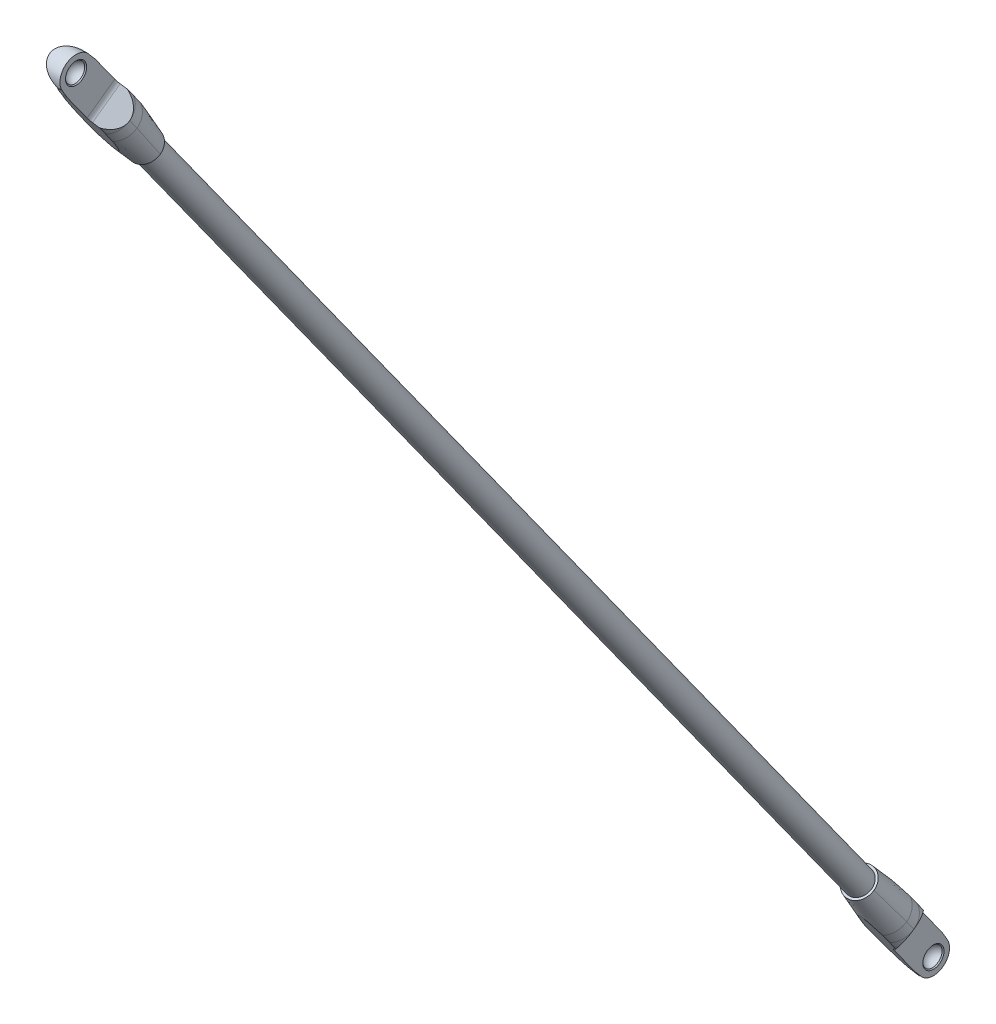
ISO-10303-21;
HEADER;
FILE_DESCRIPTION(('STEP AP214'),'2;1');
FILE_NAME('part.step','',(''),(''),'','','');
FILE_SCHEMA(('AUTOMOTIVE_DESIGN { 1 0 10303 214 1 1 1 1 }'));
ENDSEC;
DATA;
#1=APPLICATION_CONTEXT('core data for automotive mechanical design processes');
#2=APPLICATION_PROTOCOL_DEFINITION('international standard','automotive_design',2000,#1);
#3=PRODUCT_CONTEXT('',#1,'mechanical');
#4=PRODUCT('Part','Part','',(#3));
#5=PRODUCT_RELATED_PRODUCT_CATEGORY('part','',(#4));
#6=PRODUCT_DEFINITION_FORMATION('','',#4);
#7=PRODUCT_DEFINITION_CONTEXT('part definition',#1,'design');
#8=PRODUCT_DEFINITION('design','',#6,#7);
#9=PRODUCT_DEFINITION_SHAPE('','',#8);
#10=(LENGTH_UNIT() NAMED_UNIT(*) SI_UNIT(.MILLI.,.METRE.));
#11=(NAMED_UNIT(*) PLANE_ANGLE_UNIT() SI_UNIT($,.RADIAN.));
#12=(NAMED_UNIT(*) SI_UNIT($,.STERADIAN.) SOLID_ANGLE_UNIT());
#13=UNCERTAINTY_MEASURE_WITH_UNIT(LENGTH_MEASURE(1.E-05),#10,'distance_accuracy_value','');
#14=(GEOMETRIC_REPRESENTATION_CONTEXT(3) GLOBAL_UNCERTAINTY_ASSIGNED_CONTEXT((#13)) GLOBAL_UNIT_ASSIGNED_CONTEXT((#10,
#11,#12)) REPRESENTATION_CONTEXT('',''));
#15=CARTESIAN_POINT('',(0.,0.,0.));
#16=DIRECTION('',(0.,0.,1.));
#17=DIRECTION('',(1.,0.,0.));
#18=AXIS2_PLACEMENT_3D('',#15,#16,#17);
#19=CARTESIAN_POINT('',(-53.5017567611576,-747.90188341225,147.720111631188));
#20=DIRECTION('',(2.16919938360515E-06,0.812358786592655,0.583157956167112));
#21=DIRECTION('',(0.486417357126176,0.509519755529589,-0.709780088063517));
#22=AXIS2_PLACEMENT_3D('',#19,#20,#21);
#23=CYLINDRICAL_SURFACE('',#22,8.);
#24=DIRECTION('',(-2.16919938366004E-06,-0.812358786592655,-0.583157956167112));
#25=VECTOR('',#24,1.);
#26=CARTESIAN_POINT('',(-57.3916488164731,-199.762789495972,532.601606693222));
#27=LINE('',#26,#25);
#28=CARTESIAN_POINT('',(-57.3923752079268,-471.794251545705,337.321745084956));
#29=VERTEX_POINT('',#28);
#30=CARTESIAN_POINT('',(-57.3932330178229,-793.041533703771,106.711931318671));
#31=VERTEX_POINT('',#30);
#32=EDGE_CURVE('E274',#29,#31,#27,.T.);
#33=ORIENTED_EDGE('',*,*,#32,.F.);
#34=ORIENTED_EDGE('',*,*,#32,.T.);
#35=CARTESIAN_POINT('',(-53.5018881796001,-797.117703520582,112.39015947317));
#36=DIRECTION('',(2.16919938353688E-06,0.812358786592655,0.583157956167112));
#37=DIRECTION('',(0.999999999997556,-1.51266271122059E-06,-1.61255544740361E-06));
#38=AXIS2_PLACEMENT_3D('',#35,#36,#37);
#39=CIRCLE('',#38,8.);
#40=CARTESIAN_POINT('',(-49.6105433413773,-801.193873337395,118.06838762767));
#41=VERTEX_POINT('',#40);
#42=EDGE_CURVE('E267',#31,#41,#39,.T.);
#43=ORIENTED_EDGE('',*,*,#42,.T.);
#44=DIRECTION('',(-2.16919938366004E-06,-0.812358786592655,-0.583157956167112));
#45=VECTOR('',#44,1.);
#46=CARTESIAN_POINT('',(-49.6089591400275,-207.915129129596,543.95806300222));
#47=LINE('',#46,#45);
#48=CARTESIAN_POINT('',(-49.6096855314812,-479.946591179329,348.678201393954));
#49=VERTEX_POINT('',#48);
#50=EDGE_CURVE('E262',#49,#41,#47,.T.);
#51=ORIENTED_EDGE('',*,*,#50,.F.);
#52=ORIENTED_EDGE('',*,*,#50,.T.);
#53=CARTESIAN_POINT('',(-53.5018881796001,-797.117703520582,112.39015947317));
#54=DIRECTION('',(2.16919938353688E-06,0.812358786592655,0.583157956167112));
#55=DIRECTION('',(0.999999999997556,-1.51266271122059E-06,-1.61255544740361E-06));
#56=AXIS2_PLACEMENT_3D('',#53,#54,#55);
#57=CIRCLE('',#56,8.);
#58=EDGE_CURVE('E307',#41,#31,#57,.T.);
#59=ORIENTED_EDGE('',*,*,#58,.T.);
#60=EDGE_LOOP('',(#33,#34,#43,#51,#52,#59));
#61=FACE_BOUND('',#60,.T.);
#62=DIRECTION('',(2.16919938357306E-06,0.812358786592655,0.583157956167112));
#63=VECTOR('',#62,1.);
#64=CARTESIAN_POINT('',(-49.6104179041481,-743.825725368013,142.04187092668));
#65=LINE('',#64,#63);
#66=CARTESIAN_POINT('',(-49.6096915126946,-471.794263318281,337.321732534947));
#67=VERTEX_POINT('',#66);
#68=CARTESIAN_POINT('',(-49.6088337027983,-150.546981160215,567.931546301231));
#69=VERTEX_POINT('',#68);
#70=EDGE_CURVE('E614',#67,#69,#65,.T.);
#71=ORIENTED_EDGE('',*,*,#70,.F.);
#72=ORIENTED_EDGE('',*,*,#70,.T.);
#73=CARTESIAN_POINT('',(-53.5001725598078,-154.623139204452,573.609787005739));
#74=DIRECTION('',(-2.16919938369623E-06,-0.812358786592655,-0.583157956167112));
#75=DIRECTION('',(0.999999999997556,-1.51266271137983E-06,-1.61255544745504E-06));
#76=AXIS2_PLACEMENT_3D('',#73,#74,#75);
#77=CIRCLE('',#76,8.);
#78=CARTESIAN_POINT('',(-57.3915114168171,-158.699297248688,579.288027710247));
#79=VERTEX_POINT('',#78);
#80=EDGE_CURVE('E775',#69,#79,#77,.T.);
#81=ORIENTED_EDGE('',*,*,#80,.T.);
#82=DIRECTION('',(2.16919938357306E-06,0.812358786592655,0.583157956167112));
#83=VECTOR('',#82,1.);
#84=CARTESIAN_POINT('',(-57.3930956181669,-751.978041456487,153.398352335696));
#85=LINE('',#84,#83);
#86=CARTESIAN_POINT('',(-57.3923692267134,-479.946579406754,348.678213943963));
#87=VERTEX_POINT('',#86);
#88=EDGE_CURVE('E282',#87,#79,#85,.T.);
#89=ORIENTED_EDGE('',*,*,#88,.F.);
#90=ORIENTED_EDGE('',*,*,#88,.T.);
#91=CARTESIAN_POINT('',(-53.5001725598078,-154.623139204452,573.609787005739));
#92=DIRECTION('',(-2.16919938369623E-06,-0.812358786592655,-0.583157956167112));
#93=DIRECTION('',(0.999999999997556,-1.51266271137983E-06,-1.61255544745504E-06));
#94=AXIS2_PLACEMENT_3D('',#91,#92,#93);
#95=CIRCLE('',#94,8.);
#96=EDGE_CURVE('E284',#79,#69,#95,.T.);
#97=ORIENTED_EDGE('',*,*,#96,.T.);
#98=EDGE_LOOP('',(#71,#72,#81,#89,#90,#97));
#99=FACE_BOUND('',#98,.T.);
#100=ADVANCED_FACE('F16',(#61,#99),#23,.T.);
#101=CARTESIAN_POINT('',(-53.5000879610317,-122.941146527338,596.352947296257));
#102=DIRECTION('',(-2.16919938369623E-06,-0.812358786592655,-0.583157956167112));
#103=DIRECTION('',(0.999999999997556,-1.51266271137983E-06,-1.61255544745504E-06));
#104=AXIS2_PLACEMENT_3D('',#101,#102,#103);
#105=DEGENERATE_TOROIDAL_SURFACE('',#104,422.5,435.,.F.);
#106=CARTESIAN_POINT('',(-59.4352705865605,-117.263956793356,586.887549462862));
#107=CARTESIAN_POINT('',(-59.4397854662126,-116.419650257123,587.493641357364));
#108=CARTESIAN_POINT('',(-59.4365522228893,-115.575312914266,588.099755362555));
#109=CARTESIAN_POINT('',(-59.4143068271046,-113.886743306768,589.311907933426));
#110=CARTESIAN_POINT('',(-59.3952940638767,-113.04251104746,589.917946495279));
#111=CARTESIAN_POINT('',(-59.3411688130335,-111.353205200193,591.130627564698));
#112=CARTESIAN_POINT('',(-59.3060338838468,-110.508132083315,591.737269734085));
#113=CARTESIAN_POINT('',(-59.2189693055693,-108.818567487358,592.950136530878));
#114=CARTESIAN_POINT('',(-59.1670399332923,-107.974075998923,593.556361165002));
#115=CARTESIAN_POINT('',(-59.0450220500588,-106.282016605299,594.771018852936));
#116=CARTESIAN_POINT('',(-58.974850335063,-105.434452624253,595.379449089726));
#117=CARTESIAN_POINT('',(-58.8147675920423,-103.740564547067,596.595419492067));
#118=CARTESIAN_POINT('',(-58.7248569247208,-102.894240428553,597.202959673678));
#119=CARTESIAN_POINT('',(-58.5227904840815,-101.203772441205,598.416474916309));
#120=CARTESIAN_POINT('',(-58.4106466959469,-100.359627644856,599.022450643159));
#121=CARTESIAN_POINT('',(-58.2226217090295,-99.0954002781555,599.929985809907));
#122=CARTESIAN_POINT('',(-58.1566480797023,-98.6743389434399,600.232247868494));
#123=CARTESIAN_POINT('',(-58.0173228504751,-97.8330244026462,600.836191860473));
#124=CARTESIAN_POINT('',(-57.9439713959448,-97.4127711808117,601.137873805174));
#125=CARTESIAN_POINT('',(-57.8094456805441,-96.6845041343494,601.660665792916));
#126=CARTESIAN_POINT('',(-57.7501947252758,-96.3762556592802,601.88194428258));
#127=CARTESIAN_POINT('',(-57.6266502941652,-95.7604150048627,602.32403013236));
#128=CARTESIAN_POINT('',(-57.5623566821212,-95.4528228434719,602.544837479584));
#129=CARTESIAN_POINT('',(-57.4280940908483,-94.8385601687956,602.985790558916));
#130=CARTESIAN_POINT('',(-57.3581270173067,-94.5318893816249,603.205936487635));
#131=CARTESIAN_POINT('',(-57.2116391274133,-93.9195931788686,603.645477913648));
#132=CARTESIAN_POINT('',(-57.1351186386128,-93.6139677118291,603.86487344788));
#133=CARTESIAN_POINT('',(-56.9742468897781,-93.0036516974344,604.302993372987));
#134=CARTESIAN_POINT('',(-56.8898854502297,-92.6989629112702,604.521716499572));
#135=CARTESIAN_POINT('',(-56.7117546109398,-92.0913205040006,604.957917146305));
#136=CARTESIAN_POINT('',(-56.6179832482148,-91.7883672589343,605.175394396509));
#137=CARTESIAN_POINT('',(-56.418456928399,-91.1846067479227,605.608808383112));
#138=CARTESIAN_POINT('',(-56.3126854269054,-90.8838030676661,605.824742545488));
#139=CARTESIAN_POINT('',(-56.0855058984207,-90.286187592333,606.253745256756));
#140=CARTESIAN_POINT('',(-55.9641063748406,-89.9893737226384,606.466815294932));
#141=CARTESIAN_POINT('',(-55.7647532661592,-89.548520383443,606.783285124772));
#142=CARTESIAN_POINT('',(-55.6952472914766,-89.401966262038,606.888490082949));
#143=CARTESIAN_POINT('',(-55.548974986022,-89.1111254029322,607.097272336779));
#144=CARTESIAN_POINT('',(-55.4722039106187,-88.966840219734,607.200848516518));
#145=CARTESIAN_POINT('',(-55.3094568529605,-88.6820196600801,607.405309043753));
#146=CARTESIAN_POINT('',(-55.223497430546,-88.5414780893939,607.506197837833));
#147=CARTESIAN_POINT('',(-55.0389986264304,-88.2660240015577,607.703934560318));
#148=CARTESIAN_POINT('',(-54.9404780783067,-88.131103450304,607.800788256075));
#149=CARTESIAN_POINT('',(-54.7530161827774,-87.9049637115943,607.963124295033));
#150=CARTESIAN_POINT('',(-54.6682292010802,-87.811493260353,608.030222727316));
#151=CARTESIAN_POINT('',(-54.4848274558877,-87.6340121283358,608.157628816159));
#152=CARTESIAN_POINT('',(-54.3862706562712,-87.5499643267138,608.217963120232));
#153=CARTESIAN_POINT('',(-54.2264624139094,-87.4389762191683,608.297636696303));
#154=CARTESIAN_POINT('',(-54.1725723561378,-87.4051179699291,608.321942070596));
#155=CARTESIAN_POINT('',(-54.0598419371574,-87.3432401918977,608.366361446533));
#156=CARTESIAN_POINT('',(-54.0010044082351,-87.3152173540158,608.386477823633));
#157=CARTESIAN_POINT('',(-53.8875784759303,-87.2708940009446,608.418295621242));
#158=CARTESIAN_POINT('',(-53.8336695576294,-87.2534673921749,608.430805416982));
#159=CARTESIAN_POINT('',(-53.7230389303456,-87.2261442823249,608.450419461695));
#160=CARTESIAN_POINT('',(-53.6663218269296,-87.2162358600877,608.457532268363));
#161=CARTESIAN_POINT('',(-53.5511639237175,-87.205116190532,608.465514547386));
#162=CARTESIAN_POINT('',(-53.4927139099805,-87.2039656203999,608.466340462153));
#163=CARTESIAN_POINT('',(-53.3766003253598,-87.2106893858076,608.461513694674));
#164=CARTESIAN_POINT('',(-53.3189373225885,-87.2185699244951,608.455856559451));
#165=CARTESIAN_POINT('',(-53.19913963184,-87.2438081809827,608.437739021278));
#166=CARTESIAN_POINT('',(-53.1373538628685,-87.2622325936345,608.42451288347));
#167=CARTESIAN_POINT('',(-53.0182519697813,-87.3069068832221,608.392443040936));
#168=CARTESIAN_POINT('',(-52.9609450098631,-87.3331723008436,608.373588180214));
#169=CARTESIAN_POINT('',(-52.8142742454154,-87.4107367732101,608.317907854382));
#170=CARTESIAN_POINT('',(-52.7289936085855,-87.4670548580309,608.277479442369));
#171=CARTESIAN_POINT('',(-52.5690399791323,-87.5887757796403,608.190101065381));
#172=CARTESIAN_POINT('',(-52.4943987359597,-87.65420470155,608.143132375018));
#173=CARTESIAN_POINT('',(-52.3187755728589,-87.8240200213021,608.021229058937));
#174=CARTESIAN_POINT('',(-52.2228099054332,-87.9317851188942,607.943869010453));
#175=CARTESIAN_POINT('',(-52.0434093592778,-88.154082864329,607.784290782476));
#176=CARTESIAN_POINT('',(-51.9600045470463,-88.2686308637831,607.702061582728));
#177=CARTESIAN_POINT('',(-51.8020036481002,-88.5025557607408,607.534136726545));
#178=CARTESIAN_POINT('',(-51.727465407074,-88.6219582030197,607.448422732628));
#179=CARTESIAN_POINT('',(-51.585684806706,-88.8633738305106,607.275120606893));
#180=CARTESIAN_POINT('',(-51.5184339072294,-88.9853837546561,607.187534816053));
#181=CARTESIAN_POINT('',(-51.3144454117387,-89.3746285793,606.908112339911));
#182=CARTESIAN_POINT('',(-51.188048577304,-89.6454266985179,606.713717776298));
#183=CARTESIAN_POINT('',(-50.9525877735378,-90.1920010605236,606.321355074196));
#184=CARTESIAN_POINT('',(-50.8435366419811,-90.4677808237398,606.123384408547));
#185=CARTESIAN_POINT('',(-50.6379831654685,-91.0231497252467,605.724708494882));
#186=CARTESIAN_POINT('',(-50.5415131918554,-91.3027467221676,605.523997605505));
#187=CARTESIAN_POINT('',(-50.358563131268,-91.8639713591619,605.121118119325));
#188=CARTESIAN_POINT('',(-50.2720799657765,-92.145598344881,604.918949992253));
#189=CARTESIAN_POINT('',(-50.1069489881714,-92.7111662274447,604.512952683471));
#190=CARTESIAN_POINT('',(-50.028323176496,-92.9951113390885,604.309120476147));
#191=CARTESIAN_POINT('',(-49.8778348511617,-93.5641965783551,603.900598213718));
#192=CARTESIAN_POINT('',(-49.8059728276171,-93.8493367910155,603.695908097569));
#193=CARTESIAN_POINT('',(-49.6681537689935,-94.420101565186,603.28618017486));
#194=CARTESIAN_POINT('',(-49.6021878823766,-94.7057247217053,603.081143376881));
#195=CARTESIAN_POINT('',(-49.475316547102,-95.27770240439,602.670544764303));
#196=CARTESIAN_POINT('',(-49.414410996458,-95.5640569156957,602.464982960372));
#197=CARTESIAN_POINT('',(-49.2635656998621,-96.3011716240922,601.935839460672));
#198=CARTESIAN_POINT('',(-49.1769216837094,-96.7523777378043,601.611937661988));
#199=CARTESIAN_POINT('',(-49.0130963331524,-97.6559270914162,600.96331777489));
#200=CARTESIAN_POINT('',(-48.9359153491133,-98.1082703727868,600.638599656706));
#201=CARTESIAN_POINT('',(-48.7167473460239,-99.4667309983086,599.663418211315));
#202=CARTESIAN_POINT('',(-48.5871559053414,-100.374175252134,599.012002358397));
#203=CARTESIAN_POINT('',(-48.3547471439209,-102.192599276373,597.706632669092));
#204=CARTESIAN_POINT('',(-48.2519688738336,-103.103582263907,597.05267652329));
#205=CARTESIAN_POINT('',(-48.0698662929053,-104.927020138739,595.743707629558));
#206=CARTESIAN_POINT('',(-47.9905403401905,-105.839474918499,595.088694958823));
#207=CARTESIAN_POINT('',(-47.855827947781,-107.628432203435,593.804478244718));
#208=CARTESIAN_POINT('',(-47.7996017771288,-108.504893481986,593.175303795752));
#209=CARTESIAN_POINT('',(-47.7053468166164,-110.258478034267,591.916479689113));
#210=CARTESIAN_POINT('',(-47.6673184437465,-111.135601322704,591.286830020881));
#211=CARTESIAN_POINT('',(-47.6087301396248,-112.887883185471,590.028941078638));
#212=CARTESIAN_POINT('',(-47.5881237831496,-113.7630407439,589.400702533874));
#213=CARTESIAN_POINT('',(-47.5638790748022,-115.513468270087,588.144144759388));
#214=CARTESIAN_POINT('',(-47.560239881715,-116.38873823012,587.515825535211));
#215=CARTESIAN_POINT('',(-47.5649186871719,-117.263974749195,586.887530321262));
#216=B_SPLINE_CURVE_WITH_KNOTS('',3,(#106,#107,#108,#109,#110,#111,#112,#113,#114,#115,#116,
#117,#118,#119,#120,#121,#122,#123,#124,#125,#126,#127,#128,#129,#130,#131,#132,#133,#134,#135,
#136,#137,#138,#139,#140,#141,#142,#143,#144,#145,#146,#147,#148,#149,#150,#151,#152,#153,#154,
#155,#156,#157,#158,#159,#160,#161,#162,#163,#164,#165,#166,#167,#168,#169,#170,#171,#172,#173,
#174,#175,#176,#177,#178,#179,#180,#181,#182,#183,#184,#185,#186,#187,#188,#189,#190,#191,#192,
#193,#194,#195,#196,#197,#198,#199,#200,#201,#202,#203,#204,#205,#206,#207,#208,#209,#210,#211,
#212,#213,#214,#215),.UNSPECIFIED.,.F.,.F.,(4,2,2,2,2,2,2,2,2,2,2,2,2,2,2,2,2,2,2,2,2,2,2,2,2,2,
2,2,2,2,2,2,2,2,2,2,2,2,2,2,2,2,2,2,2,2,2,2,2,2,2,2,2,2,4),(0.,3.11798800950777,
6.23609671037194,9.35855895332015,12.4809697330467,15.6178797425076,18.7547324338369,
21.8898987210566,23.4573613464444,25.0247930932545,26.176904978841,27.3290479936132,
28.4808055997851,29.6325056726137,30.7857224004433,31.9391802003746,33.0942480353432,
34.2486900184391,34.8285759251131,35.4088431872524,35.9880817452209,36.5664618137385,
36.9946719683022,37.421131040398,37.6251109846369,37.82897494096,38.002365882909,
38.1754813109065,38.3497950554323,38.5242286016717,38.7205868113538,38.9173368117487,
39.2451852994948,39.5739925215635,40.0639280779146,40.5550183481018,41.0491546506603,
41.5427054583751,42.6113457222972,43.6807732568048,44.7529003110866,45.8246959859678,
46.8994131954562,47.9742082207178,49.0473616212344,50.1204933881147,51.8068214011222,
53.4932118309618,56.8663810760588,60.2444359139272,63.6222542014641,66.8632139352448,
70.10424792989,73.3366179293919,76.5688276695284),.UNSPECIFIED.);
#217=CARTESIAN_POINT('',(-59.4372637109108,-116.52640002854,587.417010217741));
#218=VERTEX_POINT('',#217);
#219=CARTESIAN_POINT('',(-52.0000170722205,-88.2162351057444,607.739674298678));
#220=VERTEX_POINT('',#219);
#221=EDGE_CURVE('E572',#218,#220,#216,.T.);
#222=ORIENTED_EDGE('',*,*,#221,.F.);
#223=CARTESIAN_POINT('',(-53.5000879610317,-122.941146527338,596.352947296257));
#224=DIRECTION('',(-2.16919938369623E-06,-0.812358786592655,-0.583157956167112));
#225=DIRECTION('',(-0.999999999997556,1.51266271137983E-06,1.61255544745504E-06));
#226=AXIS2_PLACEMENT_3D('',#223,#224,#225);
#227=CIRCLE('',#226,12.5);
#228=CARTESIAN_POINT('',(-66.0000879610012,-122.941127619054,596.3529674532));
#229=VERTEX_POINT('',#228);
#230=EDGE_CURVE('E575',#229,#218,#227,.T.);
#231=ORIENTED_EDGE('',*,*,#230,.F.);
#232=CARTESIAN_POINT('',(368.999912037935,-122.941785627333,596.35226599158));
#233=DIRECTION('',(4.27852291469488E-07,-0.583157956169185,0.812358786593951));
#234=DIRECTION('',(0.999999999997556,-1.51266271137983E-06,-1.61255544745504E-06));
#235=AXIS2_PLACEMENT_3D('',#232,#233,#234);
#236=CIRCLE('',#235,435.);
#237=CARTESIAN_POINT('',(-62.9999773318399,-81.5108340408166,626.094018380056));
#238=VERTEX_POINT('',#237);
#239=EDGE_CURVE('E507',#238,#229,#236,.T.);
#240=ORIENTED_EDGE('',*,*,#239,.F.);
#241=CARTESIAN_POINT('',(-54.9995978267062,-83.1153966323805,612.136399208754));
#242=CARTESIAN_POINT('',(-54.9995957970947,-83.0949502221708,612.154305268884));
#243=CARTESIAN_POINT('',(-55.0003549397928,-83.0745772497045,612.172288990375));
#244=CARTESIAN_POINT('',(-55.0033438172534,-83.0337061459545,612.208650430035));
#245=CARTESIAN_POINT('',(-55.0055968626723,-83.0132112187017,612.227029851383));
#246=CARTESIAN_POINT('',(-55.0115721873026,-82.9721038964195,612.264186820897));
#247=CARTESIAN_POINT('',(-55.0153209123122,-82.9514963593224,612.282965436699));
#248=CARTESIAN_POINT('',(-55.0242843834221,-82.9101679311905,612.320927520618));
#249=CARTESIAN_POINT('',(-55.0295279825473,-82.8894535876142,612.340111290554));
#250=CARTESIAN_POINT('',(-55.0391959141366,-82.8558519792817,612.371481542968));
#251=CARTESIAN_POINT('',(-55.0432250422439,-82.8428569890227,612.383676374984));
#252=CARTESIAN_POINT('',(-55.0518592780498,-82.8168276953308,612.408227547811));
#253=CARTESIAN_POINT('',(-55.0564720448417,-82.8037956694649,612.420583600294));
#254=CARTESIAN_POINT('',(-55.0712884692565,-82.7643323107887,612.458192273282));
#255=CARTESIAN_POINT('',(-55.0822896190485,-82.7381564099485,612.483404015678));
#256=CARTESIAN_POINT('',(-55.1003174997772,-82.6991893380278,612.52132280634));
#257=CARTESIAN_POINT('',(-55.1066460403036,-82.6861321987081,612.534096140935));
#258=CARTESIAN_POINT('',(-55.119939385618,-82.6598450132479,612.559945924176));
#259=CARTESIAN_POINT('',(-55.1269168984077,-82.6466200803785,612.573021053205));
#260=CARTESIAN_POINT('',(-55.1465457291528,-82.6108053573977,612.608617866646));
#261=CARTESIAN_POINT('',(-55.1596310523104,-82.588403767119,612.63109012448));
#262=CARTESIAN_POINT('',(-55.1875456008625,-82.5431416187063,612.676903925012));
#263=CARTESIAN_POINT('',(-55.2024270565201,-82.5203064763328,612.700238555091));
#264=CARTESIAN_POINT('',(-55.2339342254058,-82.4741946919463,612.74779579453));
#265=CARTESIAN_POINT('',(-55.2506081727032,-82.4509439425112,612.772011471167));
#266=CARTESIAN_POINT('',(-55.2857189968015,-82.4040276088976,612.821340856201));
#267=CARTESIAN_POINT('',(-55.3042011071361,-82.3803884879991,612.846447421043));
#268=CARTESIAN_POINT('',(-55.3424847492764,-82.3331727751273,612.897086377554));
#269=CARTESIAN_POINT('',(-55.3623065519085,-82.3096094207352,612.922615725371));
#270=CARTESIAN_POINT('',(-55.4035313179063,-82.2621014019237,612.974598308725));
#271=CARTESIAN_POINT('',(-55.4249658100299,-82.2381796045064,613.001047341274));
#272=CARTESIAN_POINT('',(-55.5009806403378,-82.1557729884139,613.093089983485));
#273=CARTESIAN_POINT('',(-55.5574733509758,-82.0987644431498,613.1584338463));
#274=CARTESIAN_POINT('',(-55.6844522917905,-81.9777680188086,613.300544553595));
#275=CARTESIAN_POINT('',(-55.7556140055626,-81.9143984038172,613.377225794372));
#276=CARTESIAN_POINT('',(-55.8653439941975,-81.8207339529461,613.493845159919));
#277=CARTESIAN_POINT('',(-55.9030575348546,-81.7892444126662,613.533645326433));
#278=CARTESIAN_POINT('',(-55.9689626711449,-81.7353644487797,613.602766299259));
#279=CARTESIAN_POINT('',(-55.9970216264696,-81.7127795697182,613.632061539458));
#280=CARTESIAN_POINT('',(-56.0884718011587,-81.6402344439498,613.727194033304));
#281=CARTESIAN_POINT('',(-56.1524132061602,-81.5911541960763,613.793174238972));
#282=CARTESIAN_POINT('',(-56.2904705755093,-81.4879765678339,613.935318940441));
#283=CARTESIAN_POINT('',(-56.3647187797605,-81.4341821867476,614.0115743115));
#284=CARTESIAN_POINT('',(-56.5015062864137,-81.3377583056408,614.152191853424));
#285=CARTESIAN_POINT('',(-56.5639315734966,-81.2947638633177,614.216414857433));
#286=CARTESIAN_POINT('',(-56.6352170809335,-81.2467946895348,614.289808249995));
#287=CARTESIAN_POINT('',(-56.6438383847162,-81.2410119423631,614.298685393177));
#288=CARTESIAN_POINT('',(-56.7023244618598,-81.2019095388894,614.358911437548));
#289=CARTESIAN_POINT('',(-56.7523430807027,-81.1690946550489,614.410439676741));
#290=CARTESIAN_POINT('',(-56.8770897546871,-81.0884528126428,614.53955099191));
#291=CARTESIAN_POINT('',(-56.9518483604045,-81.0411964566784,614.617461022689));
#292=CARTESIAN_POINT('',(-57.1261528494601,-80.9335186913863,614.800331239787));
#293=CARTESIAN_POINT('',(-57.2257350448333,-80.8739007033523,614.9057313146));
#294=CARTESIAN_POINT('',(-57.4058640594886,-80.7693192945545,615.098357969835));
#295=CARTESIAN_POINT('',(-57.4864280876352,-80.7237256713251,615.185227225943));
#296=CARTESIAN_POINT('',(-57.6393644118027,-80.6392815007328,615.351786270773));
#297=CARTESIAN_POINT('',(-57.7117619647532,-80.6002091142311,615.431340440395));
#298=CARTESIAN_POINT('',(-57.8632594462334,-80.5203416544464,615.599334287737));
#299=CARTESIAN_POINT('',(-57.9423330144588,-80.47974335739,615.687891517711));
#300=CARTESIAN_POINT('',(-58.0780121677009,-80.4118733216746,615.841594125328));
#301=CARTESIAN_POINT('',(-58.1347381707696,-80.3840406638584,615.906386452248));
#302=CARTESIAN_POINT('',(-58.2635131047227,-80.3221067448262,616.054697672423));
#303=CARTESIAN_POINT('',(-58.3354748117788,-80.2883927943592,616.138454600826));
#304=CARTESIAN_POINT('',(-58.4751632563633,-80.2246894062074,616.302860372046));
#305=CARTESIAN_POINT('',(-58.542916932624,-80.194597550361,616.383446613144));
#306=CARTESIAN_POINT('',(-58.642742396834,-80.1514477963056,616.503527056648));
#307=CARTESIAN_POINT('',(-58.6750348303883,-80.1376745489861,616.542582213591));
#308=CARTESIAN_POINT('',(-58.7448655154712,-80.1082914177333,616.627510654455));
#309=CARTESIAN_POINT('',(-58.7823780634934,-80.0927595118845,616.673432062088));
#310=CARTESIAN_POINT('',(-58.8932659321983,-80.047606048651,616.810066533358));
#311=CARTESIAN_POINT('',(-58.9663588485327,-80.0188331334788,616.901291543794));
#312=CARTESIAN_POINT('',(-59.1099344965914,-79.9643131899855,617.082854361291));
#313=CARTESIAN_POINT('',(-59.1804373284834,-79.9385093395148,617.173159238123));
#314=CARTESIAN_POINT('',(-59.3188332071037,-79.8898109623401,617.352777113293));
#315=CARTESIAN_POINT('',(-59.3867474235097,-79.866859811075,617.442058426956));
#316=CARTESIAN_POINT('',(-59.5199643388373,-79.8237493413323,617.619531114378));
#317=CARTESIAN_POINT('',(-59.5852894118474,-79.803533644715,617.707691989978));
#318=CARTESIAN_POINT('',(-59.7133277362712,-79.7657757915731,617.882832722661));
#319=CARTESIAN_POINT('',(-59.7760646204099,-79.7481775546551,617.969783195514));
#320=CARTESIAN_POINT('',(-59.8989222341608,-79.7155355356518,618.142420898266));
#321=CARTESIAN_POINT('',(-59.9590680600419,-79.7004360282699,618.228079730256));
#322=CARTESIAN_POINT('',(-60.0860264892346,-79.6704858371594,618.411445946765));
#323=CARTESIAN_POINT('',(-60.152706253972,-79.6559147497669,618.509291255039));
#324=CARTESIAN_POINT('',(-60.2835314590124,-79.6297090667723,618.704401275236));
#325=CARTESIAN_POINT('',(-60.3477009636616,-79.6180251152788,618.801643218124));
#326=CARTESIAN_POINT('',(-60.4735020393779,-79.5975204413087,618.995460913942));
#327=CARTESIAN_POINT('',(-60.535158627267,-79.5886503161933,619.09201518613));
#328=CARTESIAN_POINT('',(-60.655933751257,-79.573698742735,619.284373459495));
#329=CARTESIAN_POINT('',(-60.715078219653,-79.5675679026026,619.380157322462));
#330=CARTESIAN_POINT('',(-60.8308276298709,-79.5580185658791,619.570895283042));
#331=CARTESIAN_POINT('',(-60.8874594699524,-79.5545507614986,619.665830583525));
#332=CARTESIAN_POINT('',(-60.9981839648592,-79.5502497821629,619.854798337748));
#333=CARTESIAN_POINT('',(-61.052304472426,-79.5493674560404,619.948813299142));
#334=CARTESIAN_POINT('',(-61.131962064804,-79.5499635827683,620.08978295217));
#335=CARTESIAN_POINT('',(-61.1580732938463,-79.5504715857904,620.136419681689));
#336=CARTESIAN_POINT('',(-61.2129521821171,-79.5522147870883,620.235366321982));
#337=CARTESIAN_POINT('',(-61.2416727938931,-79.553528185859,620.28770095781));
#338=CARTESIAN_POINT('',(-61.3264103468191,-79.5586249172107,620.443784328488));
#339=CARTESIAN_POINT('',(-61.3817220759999,-79.5635678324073,620.547881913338));
#340=CARTESIAN_POINT('',(-61.4894516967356,-79.5765552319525,620.755235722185));
#341=CARTESIAN_POINT('',(-61.5419018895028,-79.5845483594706,620.858478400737));
#342=CARTESIAN_POINT('',(-61.643909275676,-79.6035697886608,621.0640362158));
#343=CARTESIAN_POINT('',(-61.693499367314,-79.6145473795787,621.166339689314));
#344=CARTESIAN_POINT('',(-61.7897855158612,-79.6394691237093,621.36993359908));
#345=CARTESIAN_POINT('',(-61.8365150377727,-79.6533633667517,621.47121430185));
#346=CARTESIAN_POINT('',(-61.9270797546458,-79.6840479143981,621.67268180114));
#347=CARTESIAN_POINT('',(-61.9709488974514,-79.7007892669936,621.772860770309));
#348=CARTESIAN_POINT('',(-62.0557918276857,-79.7370955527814,621.972046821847));
#349=CARTESIAN_POINT('',(-62.0967999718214,-79.7566126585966,622.071047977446));
#350=CARTESIAN_POINT('',(-62.1797610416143,-79.8004241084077,622.277351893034));
#351=CARTESIAN_POINT('',(-62.2215213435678,-79.8249773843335,622.384677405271));
#352=CARTESIAN_POINT('',(-62.3017209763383,-79.8774002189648,622.598108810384));
#353=CARTESIAN_POINT('',(-62.3401960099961,-79.9052232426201,622.704212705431));
#354=CARTESIAN_POINT('',(-62.41382550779,-79.9641187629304,622.915104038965));
#355=CARTESIAN_POINT('',(-62.449015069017,-79.9951469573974,623.019891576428));
#356=CARTESIAN_POINT('',(-62.5160743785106,-80.0603833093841,623.228056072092));
#357=CARTESIAN_POINT('',(-62.5479784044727,-80.0945496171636,623.331435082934));
#358=CARTESIAN_POINT('',(-62.60846727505,-80.1659895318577,623.536690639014));
#359=CARTESIAN_POINT('',(-62.63708535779,-80.203223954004,623.638571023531));
#360=CARTESIAN_POINT('',(-62.6910043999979,-80.2807273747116,623.84074609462));
#361=CARTESIAN_POINT('',(-62.7163373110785,-80.3209600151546,623.941046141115));
#362=CARTESIAN_POINT('',(-62.7519353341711,-80.3836773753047,624.090602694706));
#363=CARTESIAN_POINT('',(-62.7633622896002,-80.4048930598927,624.140119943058));
#364=CARTESIAN_POINT('',(-62.7859502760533,-80.4491441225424,624.24122877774));
#365=CARTESIAN_POINT('',(-62.7970751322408,-80.4722183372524,624.292811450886));
#366=CARTESIAN_POINT('',(-62.8290567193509,-80.5425567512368,624.446682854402));
#367=CARTESIAN_POINT('',(-62.8486480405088,-80.5911601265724,624.548629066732));
#368=CARTESIAN_POINT('',(-62.8842476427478,-80.6916002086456,624.750759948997));
#369=CARTESIAN_POINT('',(-62.900276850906,-80.7434156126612,624.850951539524));
#370=CARTESIAN_POINT('',(-62.9287560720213,-80.8502117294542,625.049478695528));
#371=CARTESIAN_POINT('',(-62.9412240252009,-80.9051748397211,625.147821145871));
#372=CARTESIAN_POINT('',(-62.9625837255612,-81.0181926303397,625.342552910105));
#373=CARTESIAN_POINT('',(-62.9714902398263,-81.0762333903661,625.438948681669));
#374=CARTESIAN_POINT('',(-62.9857295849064,-81.1953318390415,625.629694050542));
#375=CARTESIAN_POINT('',(-62.9910738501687,-81.2563791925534,625.724049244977));
#376=CARTESIAN_POINT('',(-62.9981950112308,-81.3814088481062,625.910625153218));
#377=CARTESIAN_POINT('',(-62.9999798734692,-81.4453842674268,626.002850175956));
#378=CARTESIAN_POINT('',(-62.9999773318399,-81.5108340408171,626.094018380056));
#379=B_SPLINE_CURVE_WITH_KNOTS('',3,(#241,#242,#243,#244,#245,#246,#247,#248,#249,#250,#251,
#252,#253,#254,#255,#256,#257,#258,#259,#260,#261,#262,#263,#264,#265,#266,#267,#268,#269,#270,
#271,#272,#273,#274,#275,#276,#277,#278,#279,#280,#281,#282,#283,#284,#285,#286,#287,#288,#289,
#290,#291,#292,#293,#294,#295,#296,#297,#298,#299,#300,#301,#302,#303,#304,#305,#306,#307,#308,
#309,#310,#311,#312,#313,#314,#315,#316,#317,#318,#319,#320,#321,#322,#323,#324,#325,#326,#327,
#328,#329,#330,#331,#332,#333,#334,#335,#336,#337,#338,#339,#340,#341,#342,#343,#344,#345,#346,
#347,#348,#349,#350,#351,#352,#353,#354,#355,#356,#357,#358,#359,#360,#361,#362,#363,#364,#365,
#366,#367,#368,#369,#370,#371,#372,#373,#374,#375,#376,#377,#378),.UNSPECIFIED.,.F.,.F.,(4,2,2,
2,2,2,2,2,2,2,2,2,2,2,2,2,2,2,2,2,2,2,2,2,2,2,2,2,2,2,2,2,2,2,2,2,2,2,2,2,2,2,2,2,2,2,2,2,2,2,2,
2,2,2,2,2,2,2,2,2,2,2,2,2,2,2,2,2,4),(0.,0.0815194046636,0.164341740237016,0.248698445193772,
0.334808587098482,0.3896131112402,0.445230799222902,0.559074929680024,0.617063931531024,
0.676646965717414,0.779587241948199,0.887206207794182,0.999635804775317,1.11699174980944,
1.23697393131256,1.36178861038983,1.67212198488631,2.03893945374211,2.22862346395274,
2.36790523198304,2.68037635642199,3.03810731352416,3.33613291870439,3.37711019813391,
3.61396578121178,3.96753556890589,4.43781617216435,4.81862869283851,5.16193235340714,
5.53831542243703,5.80980971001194,6.15615469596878,6.48463008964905,6.64217237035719,
6.82605691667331,7.18717517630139,7.53945522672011,7.88292416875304,8.21761124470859,
8.54354806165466,8.86076884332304,9.21862136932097,9.56985097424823,9.91452039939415,
10.2526960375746,10.584448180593,10.9098512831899,11.0702004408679,11.2493296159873,
11.6032132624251,11.9513841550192,12.293973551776,12.6311192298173,12.9629657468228,
13.2896646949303,13.6428317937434,13.9914726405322,14.3358141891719,14.6760919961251,
15.0125501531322,15.3454411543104,15.5106390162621,15.6834061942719,16.0271636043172,
16.3688446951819,16.7087728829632,17.047276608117,17.3846884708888,17.7213443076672),.UNSPECIFIED.);
#380=CARTESIAN_POINT('',(-54.9995978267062,-83.1153966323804,612.136399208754));
#381=VERTEX_POINT('',#380);
#382=EDGE_CURVE('E504',#381,#238,#379,.T.);
#383=ORIENTED_EDGE('',*,*,#382,.F.);
#384=CARTESIAN_POINT('',(-53.4999978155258,-89.1819198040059,620.587265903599));
#385=DIRECTION('',(2.16919938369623E-06,0.812358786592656,0.583157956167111));
#386=DIRECTION('',(-4.27852291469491E-07,0.583157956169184,-0.812358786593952));
#387=AXIS2_PLACEMENT_3D('',#384,#385,#386);
#388=CIRCLE('',#387,10.5104068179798);
#389=CARTESIAN_POINT('',(-52.0004067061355,-83.115401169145,612.136394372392));
#390=VERTEX_POINT('',#389);
#391=EDGE_CURVE('E499',#390,#381,#388,.T.);
#392=ORIENTED_EDGE('',*,*,#391,.F.);
#393=CARTESIAN_POINT('',(-52.0000021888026,-83.0889065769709,612.159676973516));
#394=CARTESIAN_POINT('',(-52.0002723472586,-83.0977439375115,612.151884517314));
#395=CARTESIAN_POINT('',(-52.0004066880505,-83.1065754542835,612.144123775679));
#396=CARTESIAN_POINT('',(-52.0004067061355,-83.115401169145,612.136394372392));
#397=(BOUNDED_CURVE() B_SPLINE_CURVE(3,(#393,#394,#395,#396),.UNSPECIFIED.,.F.,
.F.) B_SPLINE_CURVE_WITH_KNOTS((4,4),(7.68404953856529E-06,4.22971954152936E-05),
.UNSPECIFIED.) CURVE() GEOMETRIC_REPRESENTATION_ITEM() RATIONAL_B_SPLINE_CURVE((1.,1.,1.,1.)) REPRESENTATION_ITEM(''));
#398=CARTESIAN_POINT('',(-52.0000021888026,-83.0889065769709,612.159676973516));
#399=VERTEX_POINT('',#398);
#400=EDGE_CURVE('E503',#399,#390,#397,.T.);
#401=ORIENTED_EDGE('',*,*,#400,.F.);
#402=CARTESIAN_POINT('',(-52.0000648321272,-105.201347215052,594.055083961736));
#403=CARTESIAN_POINT('',(-52.0000544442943,-101.418316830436,596.948245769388));
#404=CARTESIAN_POINT('',(-52.0000440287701,-97.6834583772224,599.903767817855));
#405=CARTESIAN_POINT('',(-52.0000231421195,-90.3104663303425,605.940025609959));
#406=CARTESIAN_POINT('',(-52.0000126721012,-86.6727602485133,609.020475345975));
#407=CARTESIAN_POINT('',(-52.0000021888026,-83.0889065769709,612.159676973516));
#408=(BOUNDED_CURVE() B_SPLINE_CURVE(3,(#402,#403,#404,#405,#406,#407),.UNSPECIFIED.,.F.,
.F.) B_SPLINE_CURVE_WITH_KNOTS((4,2,4),(0.313716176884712,0.328296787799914,0.342877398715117),
.UNSPECIFIED.) CURVE() GEOMETRIC_REPRESENTATION_ITEM() RATIONAL_B_SPLINE_CURVE((1.,1.,1.,1.,1.,1.)) REPRESENTATION_ITEM(''));
#409=EDGE_CURVE('E577',#220,#399,#408,.T.);
#410=ORIENTED_EDGE('',*,*,#409,.F.);
#411=EDGE_LOOP('',(#222,#231,#240,#383,#392,#401,#410));
#412=FACE_BOUND('',#411,.T.);
#413=ADVANCED_FACE('F469',(#412),#105,.F.);
#414=CARTESIAN_POINT('',(-53.5001725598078,-154.623139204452,573.609787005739));
#415=DIRECTION('',(-2.16919938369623E-06,-0.812358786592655,-0.583157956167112));
#416=DIRECTION('',(-0.999999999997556,1.51266271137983E-06,1.61255544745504E-06));
#417=AXIS2_PLACEMENT_3D('',#414,#415,#416);
#418=CYLINDRICAL_SURFACE('',#417,12.5);
#419=DIRECTION('',(-2.16919938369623E-06,-0.812358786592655,-0.583157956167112));
#420=VECTOR('',#419,1.);
#421=CARTESIAN_POINT('',(-59.4373483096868,-148.208392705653,564.673849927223));
#422=LINE('',#421,#420);
#423=CARTESIAN_POINT('',(-59.4372810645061,-123.025270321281,582.751746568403));
#424=VERTEX_POINT('',#423);
#425=EDGE_CURVE('E580',#424,#218,#422,.F.);
#426=ORIENTED_EDGE('',*,*,#425,.F.);
#427=CARTESIAN_POINT('',(-53.5001053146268,-129.440016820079,591.687683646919));
#428=DIRECTION('',(-2.16919938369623E-06,-0.812358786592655,-0.583157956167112));
#429=DIRECTION('',(-0.999999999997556,1.51266271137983E-06,1.61255544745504E-06));
#430=AXIS2_PLACEMENT_3D('',#427,#428,#429);
#431=CIRCLE('',#430,12.5);
#432=CARTESIAN_POINT('',(-66.0001053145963,-129.439997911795,591.687703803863));
#433=VERTEX_POINT('',#432);
#434=EDGE_CURVE('E770',#433,#424,#431,.T.);
#435=ORIENTED_EDGE('',*,*,#434,.F.);
#436=DIRECTION('',(-2.16919938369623E-06,-0.812358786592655,-0.583157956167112));
#437=VECTOR('',#436,1.);
#438=CARTESIAN_POINT('',(-66.0001725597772,-154.623120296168,573.609807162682));
#439=LINE('',#438,#437);
#440=EDGE_CURVE('E587',#229,#433,#439,.T.);
#441=ORIENTED_EDGE('',*,*,#440,.F.);
#442=ORIENTED_EDGE('',*,*,#230,.T.);
#443=EDGE_LOOP('',(#426,#435,#441,#442));
#444=FACE_BOUND('',#443,.T.);
#445=ADVANCED_FACE('F550',(#444),#418,.T.);
#446=CARTESIAN_POINT('',(-53.5001725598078,-154.623139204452,573.609787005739));
#447=DIRECTION('',(-2.16919938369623E-06,-0.812358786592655,-0.583157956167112));
#448=DIRECTION('',(-0.999999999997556,1.51266271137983E-06,1.61255544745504E-06));
#449=AXIS2_PLACEMENT_3D('',#446,#447,#448);
#450=CYLINDRICAL_SURFACE('',#449,12.5);
#451=DIRECTION('',(-2.16919938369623E-06,-0.812358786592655,-0.583157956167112));
#452=VECTOR('',#451,1.);
#453=CARTESIAN_POINT('',(-47.5629968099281,-161.03788570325,582.545724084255));
#454=LINE('',#453,#452);
#455=CARTESIAN_POINT('',(-47.5629295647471,-135.854763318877,600.623620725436));
#456=VERTEX_POINT('',#455);
#457=CARTESIAN_POINT('',(-47.5629122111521,-129.355893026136,605.288884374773));
#458=VERTEX_POINT('',#457);
#459=EDGE_CURVE('E755',#456,#458,#454,.F.);
#460=ORIENTED_EDGE('',*,*,#459,.F.);
#461=CARTESIAN_POINT('',(-53.5001053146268,-129.440016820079,591.687683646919));
#462=DIRECTION('',(-2.16919938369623E-06,-0.812358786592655,-0.583157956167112));
#463=DIRECTION('',(-0.999999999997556,1.51266271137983E-06,1.61255544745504E-06));
#464=AXIS2_PLACEMENT_3D('',#461,#462,#463);
#465=CIRCLE('',#464,12.5);
#466=CARTESIAN_POINT('',(-41.0001053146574,-129.440035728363,591.687663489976));
#467=VERTEX_POINT('',#466);
#468=EDGE_CURVE('E639',#467,#456,#465,.T.);
#469=ORIENTED_EDGE('',*,*,#468,.F.);
#470=DIRECTION('',(-2.16919938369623E-06,-0.812358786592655,-0.583157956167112));
#471=VECTOR('',#470,1.);
#472=CARTESIAN_POINT('',(-41.0001725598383,-154.623158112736,573.609766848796));
#473=LINE('',#472,#471);
#474=CARTESIAN_POINT('',(-41.0000879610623,-122.941165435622,596.352927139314));
#475=VERTEX_POINT('',#474);
#476=EDGE_CURVE('E589',#475,#467,#473,.T.);
#477=ORIENTED_EDGE('',*,*,#476,.F.);
#478=CARTESIAN_POINT('',(-53.5000879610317,-122.941146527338,596.352947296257));
#479=DIRECTION('',(-2.16919938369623E-06,-0.812358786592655,-0.583157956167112));
#480=DIRECTION('',(-0.999999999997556,1.51266271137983E-06,1.61255544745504E-06));
#481=AXIS2_PLACEMENT_3D('',#478,#479,#480);
#482=CIRCLE('',#481,12.5);
#483=EDGE_CURVE('E605',#475,#458,#482,.T.);
#484=ORIENTED_EDGE('',*,*,#483,.T.);
#485=EDGE_LOOP('',(#460,#469,#477,#484));
#486=FACE_BOUND('',#485,.T.);
#487=ADVANCED_FACE('F560',(#486),#450,.T.);
#488=CARTESIAN_POINT('',(-53.5000879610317,-122.941146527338,596.352947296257));
#489=DIRECTION('',(-2.16919938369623E-06,-0.812358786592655,-0.583157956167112));
#490=DIRECTION('',(0.999999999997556,-1.51266271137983E-06,-1.61255544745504E-06));
#491=AXIS2_PLACEMENT_3D('',#488,#489,#490);
#492=DEGENERATE_TOROIDAL_SURFACE('',#491,422.5,435.,.F.);
#493=CARTESIAN_POINT('',(-47.5778081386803,-131.370010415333,603.84303483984));
#494=CARTESIAN_POINT('',(-47.5657775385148,-130.554382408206,604.428539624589));
#495=CARTESIAN_POINT('',(-47.56102214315,-129.738682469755,605.014096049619));
#496=CARTESIAN_POINT('',(-47.5661744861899,-128.107293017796,606.185201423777));
#497=CARTESIAN_POINT('',(-47.5760825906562,-127.291603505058,606.770750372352));
#498=CARTESIAN_POINT('',(-47.6107316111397,-125.657773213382,607.943607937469));
#499=CARTESIAN_POINT('',(-47.6355207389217,-124.839633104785,608.530916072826));
#500=CARTESIAN_POINT('',(-47.7004139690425,-123.203760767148,609.705239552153));
#501=CARTESIAN_POINT('',(-47.7405179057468,-122.386028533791,610.292254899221));
#502=CARTESIAN_POINT('',(-47.8398662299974,-120.698688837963,611.503524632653));
#503=CARTESIAN_POINT('',(-47.9001743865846,-119.829122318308,612.127749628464));
#504=CARTESIAN_POINT('',(-48.0403640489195,-118.091032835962,613.37545050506));
#505=CARTESIAN_POINT('',(-48.1202452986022,-117.22250985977,613.998926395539));
#506=CARTESIAN_POINT('',(-48.3015233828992,-115.489139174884,615.243239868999));
#507=CARTESIAN_POINT('',(-48.4028655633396,-114.624287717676,615.864080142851));
#508=CARTESIAN_POINT('',(-48.6304729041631,-112.896802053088,617.104169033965));
#509=CARTESIAN_POINT('',(-48.756735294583,-112.034167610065,617.723417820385));
#510=CARTESIAN_POINT('',(-48.967610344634,-110.751132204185,618.644454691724));
#511=CARTESIAN_POINT('',(-49.0406423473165,-110.32946883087,618.947149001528));
#512=CARTESIAN_POINT('',(-49.1950643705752,-109.487090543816,619.55185676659));
#513=CARTESIAN_POINT('',(-49.2764554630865,-109.066375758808,619.853870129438));
#514=CARTESIAN_POINT('',(-49.449365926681,-108.224024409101,620.458558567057));
#515=CARTESIAN_POINT('',(-49.5409366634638,-107.802394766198,620.761228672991));
#516=CARTESIAN_POINT('',(-49.7357218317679,-106.961082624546,621.365171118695));
#517=CARTESIAN_POINT('',(-49.838931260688,-106.541399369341,621.666444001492));
#518=CARTESIAN_POINT('',(-50.058722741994,-105.708973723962,622.264007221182));
#519=CARTESIAN_POINT('',(-50.1751519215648,-105.29620485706,622.560316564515));
#520=CARTESIAN_POINT('',(-50.4267661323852,-104.473648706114,623.150794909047));
#521=CARTESIAN_POINT('',(-50.5619810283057,-104.063867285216,623.444959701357));
#522=CARTESIAN_POINT('',(-50.7840902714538,-103.455742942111,623.881506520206));
#523=CARTESIAN_POINT('',(-50.8609641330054,-103.254988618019,624.025619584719));
#524=CARTESIAN_POINT('',(-51.022904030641,-102.855685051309,624.312262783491));
#525=CARTESIAN_POINT('',(-51.1079685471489,-102.657135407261,624.454793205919));
#526=CARTESIAN_POINT('',(-51.2884518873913,-102.263739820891,624.737195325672));
#527=CARTESIAN_POINT('',(-51.383843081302,-102.068885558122,624.877072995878));
#528=CARTESIAN_POINT('',(-51.5888804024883,-101.684233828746,625.153198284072));
#529=CARTESIAN_POINT('',(-51.6985121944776,-101.494431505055,625.289449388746));
#530=CARTESIAN_POINT('',(-51.849672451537,-101.261469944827,625.456682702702));
#531=CARTESIAN_POINT('',(-51.8813210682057,-101.214075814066,625.490704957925));
#532=CARTESIAN_POINT('',(-51.9462361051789,-101.120018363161,625.558224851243));
#533=CARTESIAN_POINT('',(-51.9795027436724,-101.073355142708,625.591722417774));
#534=CARTESIAN_POINT('',(-52.0821805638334,-100.934463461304,625.69142692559));
#535=CARTESIAN_POINT('',(-52.154338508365,-100.84353898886,625.756697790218));
#536=CARTESIAN_POINT('',(-52.3068733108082,-100.668673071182,625.882226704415));
#537=CARTESIAN_POINT('',(-52.3870853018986,-100.584637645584,625.942552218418));
#538=CARTESIAN_POINT('',(-52.5597865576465,-100.425485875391,626.056800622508));
#539=CARTESIAN_POINT('',(-52.6522200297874,-100.350331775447,626.11075061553));
#540=CARTESIAN_POINT('',(-52.8051707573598,-100.248383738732,626.183934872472));
#541=CARTESIAN_POINT('',(-52.8596786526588,-100.215706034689,626.207392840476));
#542=CARTESIAN_POINT('',(-52.9736949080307,-100.156489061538,626.24990225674));
#543=CARTESIAN_POINT('',(-53.0332044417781,-100.129951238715,626.268952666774));
#544=CARTESIAN_POINT('',(-53.1466876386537,-100.089125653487,626.298259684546));
#545=CARTESIAN_POINT('',(-53.1999382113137,-100.073535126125,626.30945149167));
#546=CARTESIAN_POINT('',(-53.3088879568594,-100.049798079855,626.326491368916));
#547=CARTESIAN_POINT('',(-53.3645833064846,-100.041640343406,626.332347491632));
#548=CARTESIAN_POINT('',(-53.477206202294,-100.033727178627,626.33802807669));
#549=CARTESIAN_POINT('',(-53.5341387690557,-100.034017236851,626.337819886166));
#550=CARTESIAN_POINT('',(-53.6469755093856,-100.043071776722,626.331320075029));
#551=CARTESIAN_POINT('',(-53.7028788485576,-100.051842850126,626.325023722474));
#552=CARTESIAN_POINT('',(-53.8219785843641,-100.079056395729,626.305488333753));
#553=CARTESIAN_POINT('',(-53.8846568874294,-100.098965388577,626.291196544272));
#554=CARTESIAN_POINT('',(-54.0052754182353,-100.146656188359,626.256961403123));
#555=CARTESIAN_POINT('',(-54.063205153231,-100.174454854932,626.23700594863));
#556=CARTESIAN_POINT('',(-54.2131315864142,-100.25705851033,626.177708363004));
#557=CARTESIAN_POINT('',(-54.3006397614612,-100.317159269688,626.134564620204));
#558=CARTESIAN_POINT('',(-54.4644985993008,-100.446563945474,626.04167057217));
#559=CARTESIAN_POINT('',(-54.5408153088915,-100.515894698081,625.991901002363));
#560=CARTESIAN_POINT('',(-54.7228396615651,-100.698065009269,625.861128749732));
#561=CARTESIAN_POINT('',(-54.8228738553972,-100.814597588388,625.777475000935));
#562=CARTESIAN_POINT('',(-55.0095385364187,-101.054639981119,625.605158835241));
#563=CARTESIAN_POINT('',(-55.0961362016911,-101.178165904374,625.516484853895));
#564=CARTESIAN_POINT('',(-55.2599717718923,-101.430181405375,625.335573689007));
#565=CARTESIAN_POINT('',(-55.3371489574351,-101.558696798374,625.243317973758));
#566=CARTESIAN_POINT('',(-55.483833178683,-101.818354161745,625.056921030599));
#567=CARTESIAN_POINT('',(-55.5533494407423,-101.949492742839,624.962782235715));
#568=CARTESIAN_POINT('',(-55.6939690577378,-102.228729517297,624.762330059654));
#569=CARTESIAN_POINT('',(-55.7643576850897,-102.377063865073,624.655847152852));
#570=CARTESIAN_POINT('',(-55.8992392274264,-102.675499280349,624.441613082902));
#571=CARTESIAN_POINT('',(-55.9637312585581,-102.825600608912,624.333861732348));
#572=CARTESIAN_POINT('',(-56.1500583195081,-103.278026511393,624.009084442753));
#573=CARTESIAN_POINT('',(-56.2646670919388,-103.582313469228,623.790649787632));
#574=CARTESIAN_POINT('',(-56.4802683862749,-104.194819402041,623.350957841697));
#575=CARTESIAN_POINT('',(-56.5812255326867,-104.503046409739,623.129694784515));
#576=CARTESIAN_POINT('',(-56.7722900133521,-105.121595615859,622.685664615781));
#577=CARTESIAN_POINT('',(-56.8624007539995,-105.431917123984,622.462897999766));
#578=CARTESIAN_POINT('',(-57.0340960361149,-106.054890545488,622.015691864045));
#579=CARTESIAN_POINT('',(-57.1156593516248,-106.367546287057,621.791249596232));
#580=CARTESIAN_POINT('',(-57.2714538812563,-106.994079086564,621.341488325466));
#581=CARTESIAN_POINT('',(-57.3456845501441,-107.307956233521,621.116169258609));
#582=CARTESIAN_POINT('',(-57.4877422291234,-107.936166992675,620.665203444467));
#583=CARTESIAN_POINT('',(-57.5555788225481,-108.250499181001,620.439557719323));
#584=CARTESIAN_POINT('',(-57.6857485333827,-108.879904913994,619.987734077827));
#585=CARTESIAN_POINT('',(-57.748081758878,-109.194978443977,619.761556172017));
#586=CARTESIAN_POINT('',(-57.8952127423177,-109.969818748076,619.205331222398));
#587=CARTESIAN_POINT('',(-57.9772640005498,-110.429930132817,618.875036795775));
#588=CARTESIAN_POINT('',(-58.1323610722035,-111.351157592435,618.213726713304));
#589=CARTESIAN_POINT('',(-58.2054066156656,-111.812273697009,617.882711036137));
#590=CARTESIAN_POINT('',(-58.4126173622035,-113.196895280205,616.888749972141));
#591=CARTESIAN_POINT('',(-58.5348407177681,-114.121587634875,616.224952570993));
#592=CARTESIAN_POINT('',(-58.7529899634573,-115.974202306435,614.89503910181));
#593=CARTESIAN_POINT('',(-58.8488809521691,-116.902127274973,614.228921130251));
#594=CARTESIAN_POINT('',(-59.0173444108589,-118.759311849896,612.895727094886));
#595=CARTESIAN_POINT('',(-59.0899182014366,-119.688571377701,612.22865108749));
#596=CARTESIAN_POINT('',(-59.2115566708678,-121.514371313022,610.917986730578));
#597=CARTESIAN_POINT('',(-59.261377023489,-122.410878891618,610.274421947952));
#598=CARTESIAN_POINT('',(-59.342391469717,-124.204462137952,608.986884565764));
#599=CARTESIAN_POINT('',(-59.3735852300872,-125.101537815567,608.34291195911));
#600=CARTESIAN_POINT('',(-59.4179696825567,-126.893847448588,607.056288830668));
#601=CARTESIAN_POINT('',(-59.4312029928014,-127.789080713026,606.413638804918));
#602=CARTESIAN_POINT('',(-59.4399941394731,-129.579569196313,605.128322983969));
#603=CARTESIAN_POINT('',(-59.4355526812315,-130.47482441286,604.485657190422));
#604=CARTESIAN_POINT('',(-59.4223691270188,-131.369992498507,603.843053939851));
#605=B_SPLINE_CURVE_WITH_KNOTS('',3,(#493,#494,#495,#496,#497,#498,#499,#500,#501,#502,#503,
#504,#505,#506,#507,#508,#509,#510,#511,#512,#513,#514,#515,#516,#517,#518,#519,#520,#521,#522,
#523,#524,#525,#526,#527,#528,#529,#530,#531,#532,#533,#534,#535,#536,#537,#538,#539,#540,#541,
#542,#543,#544,#545,#546,#547,#548,#549,#550,#551,#552,#553,#554,#555,#556,#557,#558,#559,#560,
#561,#562,#563,#564,#565,#566,#567,#568,#569,#570,#571,#572,#573,#574,#575,#576,#577,#578,#579,
#580,#581,#582,#583,#584,#585,#586,#587,#588,#589,#590,#591,#592,#593,#594,#595,#596,#597,#598,
#599,#600,#601,#602,#603,#604),.UNSPECIFIED.,.F.,.F.,(4,2,2,2,2,2,2,2,2,2,2,2,2,2,2,2,2,2,2,2,2,
2,2,2,2,2,2,2,2,2,2,2,2,2,2,2,2,2,2,2,2,2,2,2,2,2,2,2,2,2,2,2,2,2,2,4),(0.,3.01226472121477,
6.0246046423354,9.04675706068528,12.0688767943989,15.2850697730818,18.5012206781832,
21.7092775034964,24.9169779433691,26.4894444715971,28.0621128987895,29.6431117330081,
31.2234335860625,32.7870521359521,34.3531855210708,35.129502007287,35.9056747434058,
36.6798198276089,37.453191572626,37.6522868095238,37.8514089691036,38.2505085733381,
38.6426634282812,39.0330861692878,39.2358830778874,39.4387277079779,39.6078687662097,
39.776754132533,39.9465490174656,40.1164759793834,40.3172473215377,40.5184509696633,
40.8602822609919,41.2031300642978,41.7264375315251,42.2510038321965,42.7787902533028,
43.305933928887,43.892883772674,44.4799214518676,45.6546289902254,46.8323244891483,
48.0096491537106,49.1898314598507,50.3701014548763,51.548573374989,52.727022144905,
54.4438361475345,56.1607016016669,59.5947550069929,63.033338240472,66.4717266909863,
69.7856930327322,73.0997186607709,76.4058666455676,79.7118826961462),.UNSPECIFIED.);
#606=CARTESIAN_POINT('',(-47.6712012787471,-123.936400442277,609.17930866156));
#607=VERTEX_POINT('',#606);
#608=EDGE_CURVE('E751',#458,#607,#605,.T.);
#609=ORIENTED_EDGE('',*,*,#608,.F.);
#610=ORIENTED_EDGE('',*,*,#483,.F.);
#611=CARTESIAN_POINT('',(-50.5355960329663,-122.213630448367,611.691027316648));
#612=CARTESIAN_POINT('',(-48.7769732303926,-123.41282793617,610.345848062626));
#613=CARTESIAN_POINT('',(-47.206200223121,-124.167681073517,608.703808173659));
#614=CARTESIAN_POINT('',(-45.5151499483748,-124.980334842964,606.936033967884));
#615=CARTESIAN_POINT('',(-44.2028203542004,-125.201550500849,604.99379960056));
#616=CARTESIAN_POINT('',(-42.7377732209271,-125.448509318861,602.825544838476));
#617=CARTESIAN_POINT('',(-41.9135647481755,-124.933012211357,600.69407855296));
#618=CARTESIAN_POINT('',(-41.4691475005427,-124.65505364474,599.544781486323));
#619=CARTESIAN_POINT('',(-41.2385713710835,-124.164349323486,598.465818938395));
#620=CARTESIAN_POINT('',(-41.0000874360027,-123.656815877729,597.349852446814));
#621=CARTESIAN_POINT('',(-41.0000879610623,-122.941165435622,596.352927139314));
#622=B_SPLINE_CURVE_WITH_KNOTS('',2,(#611,#612,#613,#614,#615,#616,#617,#618,#619,#620,#621),
.UNSPECIFIED.,.F.,.F.,(3,2,2,2,2,3),(0.,0.25,0.5,0.75,0.875,1.),.UNSPECIFIED.);
#623=EDGE_CURVE('E686',#607,#475,#622,.T.);
#624=ORIENTED_EDGE('',*,*,#623,.F.);
#625=EDGE_LOOP('',(#609,#610,#624));
#626=FACE_BOUND('',#625,.T.);
#627=ADVANCED_FACE('F541',(#626),#492,.F.);
#628=CARTESIAN_POINT('',(-66.0000108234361,-71.4522208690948,595.889241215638));
#629=DIRECTION('',(-2.16919938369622E-06,-0.812358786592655,-0.583157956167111));
#630=DIRECTION('',(4.27852291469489E-07,-0.583157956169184,0.812358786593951));
#631=AXIS2_PLACEMENT_3D('',#628,#629,#630);
#632=PLANE('',#631);
#633=ORIENTED_EDGE('',*,*,#391,.T.);
#634=DIRECTION('',(0.999999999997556,-1.51266271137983E-06,-1.61255544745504E-06));
#635=VECTOR('',#634,1.);
#636=CARTESIAN_POINT('',(-66.0000022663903,-83.1153799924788,612.136416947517));
#637=LINE('',#636,#635);
#638=EDGE_CURVE('E26',#381,#390,#637,.T.);
#639=ORIENTED_EDGE('',*,*,#638,.T.);
#640=EDGE_LOOP('',(#633,#639));
#641=FACE_BOUND('',#640,.T.);
#642=ADVANCED_FACE('F538',(#641),#632,.F.);
#643=CARTESIAN_POINT('',(-65.9999933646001,-95.2484217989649,629.038155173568));
#644=DIRECTION('',(-2.16919938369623E-06,-0.812358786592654,-0.583157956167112));
#645=DIRECTION('',(-0.999999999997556,1.51266271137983E-06,1.61255544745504E-06));
#646=AXIS2_PLACEMENT_3D('',#643,#644,#645);
#647=PLANE('',#646);
#648=CARTESIAN_POINT('',(-53.4999978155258,-89.1819198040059,620.587265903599));
#649=DIRECTION('',(2.16919938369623E-06,0.812358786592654,0.583157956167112));
#650=DIRECTION('',(-4.27852286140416E-07,0.583157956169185,-0.81235878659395));
#651=AXIS2_PLACEMENT_3D('',#648,#649,#650);
#652=CIRCLE('',#651,10.5104068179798);
#653=CARTESIAN_POINT('',(-54.999588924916,-95.2484384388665,629.038137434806));
#654=VERTEX_POINT('',#653);
#655=CARTESIAN_POINT('',(-52.0003978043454,-95.2484429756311,629.038132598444));
#656=VERTEX_POINT('',#655);
#657=EDGE_CURVE('E598',#654,#656,#652,.T.);
#658=ORIENTED_EDGE('',*,*,#657,.T.);
#659=DIRECTION('',(0.999999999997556,-1.51266271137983E-06,-1.61255544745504E-06));
#660=VECTOR('',#659,1.);
#661=CARTESIAN_POINT('',(-65.9999933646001,-95.2484217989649,629.038155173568));
#662=LINE('',#661,#660);
#663=EDGE_CURVE('E10',#654,#656,#662,.T.);
#664=ORIENTED_EDGE('',*,*,#663,.F.);
#665=EDGE_LOOP('',(#658,#664));
#666=FACE_BOUND('',#665,.T.);
#667=ADVANCED_FACE('F473',(#666),#647,.F.);
#668=CARTESIAN_POINT('',(-66.0000000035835,-90.0013335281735,619.999050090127));
#669=DIRECTION('',(0.999999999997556,-1.51266271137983E-06,-1.61255544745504E-06));
#670=DIRECTION('',(-4.27852291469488E-07,0.583157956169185,-0.812358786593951));
#671=AXIS2_PLACEMENT_3D('',#668,#669,#670);
#672=CYLINDRICAL_SURFACE('',#671,10.4516676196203);
#673=CARTESIAN_POINT('',(-52.0000000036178,-90.0013547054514,619.99902751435));
#674=DIRECTION('',(0.999999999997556,-1.51266271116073E-06,-1.61255544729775E-06));
#675=DIRECTION('',(2.16919938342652E-06,0.812358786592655,0.583157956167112));
#676=AXIS2_PLACEMENT_3D('',#673,#674,#675);
#677=CIRCLE('',#676,10.4516676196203);
#678=CARTESIAN_POINT('',(-51.9999932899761,-95.217909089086,629.055788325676));
#679=VERTEX_POINT('',#678);
#680=EDGE_CURVE('E690',#399,#679,#677,.T.);
#681=ORIENTED_EDGE('',*,*,#680,.F.);
#682=ORIENTED_EDGE('',*,*,#400,.T.);
#683=ORIENTED_EDGE('',*,*,#638,.F.);
#684=ORIENTED_EDGE('',*,*,#382,.T.);
#685=CARTESIAN_POINT('',(-62.9999773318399,-81.5108340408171,626.094018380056));
#686=CARTESIAN_POINT('',(-62.9999797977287,-81.576414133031,626.18537926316));
#687=CARTESIAN_POINT('',(-62.9981872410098,-81.6434732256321,626.275676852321));
#688=CARTESIAN_POINT('',(-62.991035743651,-81.7805531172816,626.454176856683));
#689=CARTESIAN_POINT('',(-62.9856687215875,-81.8505802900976,626.542374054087));
#690=CARTESIAN_POINT('',(-62.9713689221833,-81.993533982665,626.716572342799));
#691=CARTESIAN_POINT('',(-62.9624245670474,-82.0664692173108,626.802565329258));
#692=CARTESIAN_POINT('',(-62.9409742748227,-82.2151705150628,626.972260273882));
#693=CARTESIAN_POINT('',(-62.9284534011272,-82.2909472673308,627.055950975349));
#694=CARTESIAN_POINT('',(-62.8998534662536,-82.4452596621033,627.220946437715));
#695=CARTESIAN_POINT('',(-62.8837562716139,-82.5238075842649,627.302236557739));
#696=CARTESIAN_POINT('',(-62.8480057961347,-82.6835917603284,627.462342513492));
#697=CARTESIAN_POINT('',(-62.8283313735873,-82.7648415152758,627.541140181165));
#698=CARTESIAN_POINT('',(-62.7962146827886,-82.8884459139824,627.657199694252));
#699=CARTESIAN_POINT('',(-62.7850427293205,-82.930045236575,627.695626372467));
#700=CARTESIAN_POINT('',(-62.7623805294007,-83.0118221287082,627.769947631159));
#701=CARTESIAN_POINT('',(-62.7509280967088,-83.051977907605,627.805877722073));
#702=CARTESIAN_POINT('',(-62.7152518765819,-83.1736974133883,627.913109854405));
#703=CARTESIAN_POINT('',(-62.6898656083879,-83.2559135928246,627.983291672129));
#704=CARTESIAN_POINT('',(-62.6358370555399,-83.4227886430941,628.121352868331));
#705=CARTESIAN_POINT('',(-62.6071626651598,-83.5074642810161,628.189199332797));
#706=CARTESIAN_POINT('',(-62.5465583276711,-83.6792038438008,628.322500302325));
#707=CARTESIAN_POINT('',(-62.51459499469,-83.7662839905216,628.387918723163));
#708=CARTESIAN_POINT('',(-62.4474142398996,-83.9427705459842,628.516271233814));
#709=CARTESIAN_POINT('',(-62.4121624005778,-84.0321923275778,628.579166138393));
#710=CARTESIAN_POINT('',(-62.3384054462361,-84.2132974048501,628.702381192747));
#711=CARTESIAN_POINT('',(-62.2998651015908,-84.3049949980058,628.762659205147));
#712=CARTESIAN_POINT('',(-62.2195321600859,-84.4905840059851,628.880551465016));
#713=CARTESIAN_POINT('',(-62.1777037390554,-84.5844884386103,628.938120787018));
#714=CARTESIAN_POINT('',(-62.0946421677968,-84.7660068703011,629.045530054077));
#715=CARTESIAN_POINT('',(-62.0536034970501,-84.8535591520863,629.09562523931));
#716=CARTESIAN_POINT('',(-61.9686996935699,-85.0306585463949,629.193611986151));
#717=CARTESIAN_POINT('',(-61.9248001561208,-85.1202153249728,629.241456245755));
#718=CARTESIAN_POINT('',(-61.834175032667,-85.3012761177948,629.334850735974));
#719=CARTESIAN_POINT('',(-61.7874154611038,-85.3927883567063,629.38035199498));
#720=CARTESIAN_POINT('',(-61.6910695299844,-85.5777091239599,629.468970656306));
#721=CARTESIAN_POINT('',(-61.6414496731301,-85.6711243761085,629.512037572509));
#722=CARTESIAN_POINT('',(-61.5393830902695,-85.8597953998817,629.595697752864));
#723=CARTESIAN_POINT('',(-61.4869034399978,-85.9550563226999,629.636239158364));
#724=CARTESIAN_POINT('',(-61.3791151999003,-86.1473615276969,629.714760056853));
#725=CARTESIAN_POINT('',(-61.3237742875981,-86.2444093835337,629.75268647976));
#726=CARTESIAN_POINT('',(-61.2389940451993,-86.390662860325,629.807361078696));
#727=CARTESIAN_POINT('',(-61.2102589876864,-86.439828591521,629.825319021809));
#728=CARTESIAN_POINT('',(-61.155342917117,-86.5330376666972,629.858576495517));
#729=CARTESIAN_POINT('',(-61.1292087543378,-86.5770794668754,629.87395773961));
#730=CARTESIAN_POINT('',(-61.0494795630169,-86.7105089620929,629.919561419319));
#731=CARTESIAN_POINT('',(-60.9953103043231,-86.7999052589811,629.948762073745));
#732=CARTESIAN_POINT('',(-60.8844846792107,-86.9804017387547,630.005059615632));
#733=CARTESIAN_POINT('',(-60.8278003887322,-87.0715010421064,630.03210417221));
#734=CARTESIAN_POINT('',(-60.711942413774,-87.2553615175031,630.083993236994));
#735=CARTESIAN_POINT('',(-60.6527417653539,-87.3481206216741,630.108784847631));
#736=CARTESIAN_POINT('',(-60.5318506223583,-87.5352522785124,630.15607088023));
#737=CARTESIAN_POINT('',(-60.4701341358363,-87.6296215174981,630.178511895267));
#738=CARTESIAN_POINT('',(-60.3442095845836,-87.8199201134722,630.220999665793));
#739=CARTESIAN_POINT('',(-60.2799764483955,-87.9158448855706,630.240992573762));
#740=CARTESIAN_POINT('',(-60.1490203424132,-88.1091993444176,630.278487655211));
#741=CARTESIAN_POINT('',(-60.082273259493,-88.2066232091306,630.295935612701));
#742=CARTESIAN_POINT('',(-59.9554526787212,-88.3896626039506,630.326063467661));
#743=CARTESIAN_POINT('',(-59.8955163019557,-88.4753208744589,630.339062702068));
#744=CARTESIAN_POINT('',(-59.77309547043,-88.6486561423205,630.363183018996));
#745=CARTESIAN_POINT('',(-59.7105861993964,-88.7363241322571,630.374242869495));
#746=CARTESIAN_POINT('',(-59.583021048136,-88.9136411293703,630.394347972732));
#747=CARTESIAN_POINT('',(-59.5179417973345,-89.0032803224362,630.403331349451));
#748=CARTESIAN_POINT('',(-59.3852344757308,-89.1844937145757,630.419144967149));
#749=CARTESIAN_POINT('',(-59.3175842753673,-89.2760571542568,630.425912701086));
#750=CARTESIAN_POINT('',(-59.1797344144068,-89.4610664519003,630.437154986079));
#751=CARTESIAN_POINT('',(-59.1095138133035,-89.5545005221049,630.441566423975));
#752=CARTESIAN_POINT('',(-58.9665205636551,-89.7431920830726,630.447954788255));
#753=CARTESIAN_POINT('',(-58.8937280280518,-89.8384366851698,630.449868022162));
#754=CARTESIAN_POINT('',(-58.7832999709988,-89.9817472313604,630.45079953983));
#755=CARTESIAN_POINT('',(-58.7459444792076,-90.0300248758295,630.450777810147));
#756=CARTESIAN_POINT('',(-58.6764353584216,-90.1194839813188,630.45011963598));
#757=CARTESIAN_POINT('',(-58.6443073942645,-90.160686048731,630.449572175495));
#758=CARTESIAN_POINT('',(-58.5449701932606,-90.287649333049,630.447136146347));
#759=CARTESIAN_POINT('',(-58.4775415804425,-90.3732246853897,630.444436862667));
#760=CARTESIAN_POINT('',(-58.3384983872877,-90.5485805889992,630.436758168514));
#761=CARTESIAN_POINT('',(-58.266856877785,-90.638334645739,630.431661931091));
#762=CARTESIAN_POINT('',(-58.1386396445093,-90.798000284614,630.420536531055));
#763=CARTESIAN_POINT('',(-58.0821504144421,-90.8680124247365,630.414946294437));
#764=CARTESIAN_POINT('',(-57.946442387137,-91.0354241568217,630.399885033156));
#765=CARTESIAN_POINT('',(-57.8671004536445,-91.1326654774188,630.389754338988));
#766=CARTESIAN_POINT('',(-57.7152640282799,-91.3178291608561,630.367841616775));
#767=CARTESIAN_POINT('',(-57.6427968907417,-91.4058015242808,630.356290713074));
#768=CARTESIAN_POINT('',(-57.4898494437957,-91.5906601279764,630.329625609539));
#769=CARTESIAN_POINT('',(-57.409343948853,-91.6874895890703,630.314262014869));
#770=CARTESIAN_POINT('',(-57.2283294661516,-91.9045352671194,630.276690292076));
#771=CARTESIAN_POINT('',(-57.1278022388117,-92.0246068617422,630.253729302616));
#772=CARTESIAN_POINT('',(-56.9520223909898,-92.2340686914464,630.209849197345));
#773=CARTESIAN_POINT('',(-56.8767344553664,-92.3236243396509,630.189854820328));
#774=CARTESIAN_POINT('',(-56.7427449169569,-92.4827334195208,630.152125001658));
#775=CARTESIAN_POINT('',(-56.6840186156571,-92.5523758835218,630.134852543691));
#776=CARTESIAN_POINT('',(-56.5626525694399,-92.6968519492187,630.097429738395));
#777=CARTESIAN_POINT('',(-56.500048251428,-92.7716846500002,630.077160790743));
#778=CARTESIAN_POINT('',(-56.3628722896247,-92.9362483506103,630.03060620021));
#779=CARTESIAN_POINT('',(-56.2884137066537,-93.0259629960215,630.003928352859));
#780=CARTESIAN_POINT('',(-56.1499881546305,-93.1941175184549,629.951437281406));
#781=CARTESIAN_POINT('',(-56.0858870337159,-93.2725459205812,629.925942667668));
#782=CARTESIAN_POINT('',(-55.9942208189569,-93.3861940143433,629.887489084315));
#783=CARTESIAN_POINT('',(-55.966100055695,-93.4212656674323,629.875415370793));
#784=CARTESIAN_POINT('',(-55.9001743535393,-93.5040532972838,629.846417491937));
#785=CARTESIAN_POINT('',(-55.8625014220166,-93.5518071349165,629.829302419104));
#786=CARTESIAN_POINT('',(-55.752968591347,-93.6920781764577,629.777867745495));
#787=CARTESIAN_POINT('',(-55.6819610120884,-93.78484580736,629.742376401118));
#788=CARTESIAN_POINT('',(-55.5552147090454,-93.9580222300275,629.673193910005));
#789=CARTESIAN_POINT('',(-55.4988014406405,-94.0381518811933,629.640057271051));
#790=CARTESIAN_POINT('',(-55.4228930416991,-94.1517314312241,629.591370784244));
#791=CARTESIAN_POINT('',(-55.4014766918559,-94.1844697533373,629.577140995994));
#792=CARTESIAN_POINT('',(-55.3602783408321,-94.2489918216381,629.548697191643));
#793=CARTESIAN_POINT('',(-55.3404651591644,-94.280764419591,629.534503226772));
#794=CARTESIAN_POINT('',(-55.3023144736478,-94.343753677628,629.505980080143));
#795=CARTESIAN_POINT('',(-55.2839512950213,-94.3749613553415,629.491665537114));
#796=CARTESIAN_POINT('',(-55.2490561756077,-94.4364369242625,629.463094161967));
#797=CARTESIAN_POINT('',(-55.2324798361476,-94.4666899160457,629.448859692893));
#798=CARTESIAN_POINT('',(-55.2011459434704,-94.5262562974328,629.420477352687));
#799=CARTESIAN_POINT('',(-55.1863410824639,-94.5555551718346,629.40635137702));
#800=CARTESIAN_POINT('',(-55.158557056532,-94.6132246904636,629.378209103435));
#801=CARTESIAN_POINT('',(-55.1455267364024,-94.6415810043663,629.364214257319));
#802=CARTESIAN_POINT('',(-55.1259717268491,-94.6866074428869,629.341733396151));
#803=CARTESIAN_POINT('',(-55.119017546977,-94.7031718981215,629.333408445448));
#804=CARTESIAN_POINT('',(-55.1057602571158,-94.7359678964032,629.316815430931));
#805=CARTESIAN_POINT('',(-55.0994447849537,-94.7521966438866,629.308551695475));
#806=CARTESIAN_POINT('',(-55.0815310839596,-94.8002553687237,629.283920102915));
#807=CARTESIAN_POINT('',(-55.0706257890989,-94.8322332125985,629.267324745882));
#808=CARTESIAN_POINT('',(-55.0559495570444,-94.8801010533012,629.242162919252));
#809=CARTESIAN_POINT('',(-55.0513788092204,-94.8958691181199,629.233823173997));
#810=CARTESIAN_POINT('',(-55.0428222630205,-94.9272634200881,629.217114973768));
#811=CARTESIAN_POINT('',(-55.0388294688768,-94.9428887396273,629.208748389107));
#812=CARTESIAN_POINT('',(-55.0292442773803,-94.9831818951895,629.187040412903));
#813=CARTESIAN_POINT('',(-55.0240491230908,-95.0078923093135,629.173599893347));
#814=CARTESIAN_POINT('',(-55.0151660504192,-95.0569516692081,629.146656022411));
#815=CARTESIAN_POINT('',(-55.0114524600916,-95.0812990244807,629.133158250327));
#816=CARTESIAN_POINT('',(-55.0055307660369,-95.129634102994,629.10610729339));
#817=CARTESIAN_POINT('',(-55.0032996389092,-95.1536213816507,629.09255841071));
#818=CARTESIAN_POINT('',(-55.0003374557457,-95.2012352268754,629.065415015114));
#819=CARTESIAN_POINT('',(-54.9995866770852,-95.2248623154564,629.051823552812));
#820=CARTESIAN_POINT('',(-54.9995889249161,-95.2484384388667,629.038137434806));
#821=B_SPLINE_CURVE_WITH_KNOTS('',3,(#685,#686,#687,#688,#689,#690,#691,#692,#693,#694,#695,
#696,#697,#698,#699,#700,#701,#702,#703,#704,#705,#706,#707,#708,#709,#710,#711,#712,#713,#714,
#715,#716,#717,#718,#719,#720,#721,#722,#723,#724,#725,#726,#727,#728,#729,#730,#731,#732,#733,
#734,#735,#736,#737,#738,#739,#740,#741,#742,#743,#744,#745,#746,#747,#748,#749,#750,#751,#752,
#753,#754,#755,#756,#757,#758,#759,#760,#761,#762,#763,#764,#765,#766,#767,#768,#769,#770,#771,
#772,#773,#774,#775,#776,#777,#778,#779,#780,#781,#782,#783,#784,#785,#786,#787,#788,#789,#790,
#791,#792,#793,#794,#795,#796,#797,#798,#799,#800,#801,#802,#803,#804,#805,#806,#807,#808,#809,
#810,#811,#812,#813,#814,#815,#816,#817,#818,#819,#820),.UNSPECIFIED.,.F.,.F.,(4,2,2,2,2,2,2,2,
2,2,2,2,2,2,2,2,2,2,2,2,2,2,2,2,2,2,2,2,2,2,2,2,2,2,2,2,2,2,2,2,2,2,2,2,2,2,2,2,2,2,2,2,2,2,2,2,
2,2,2,2,2,2,2,2,2,2,2,4),(0.,0.337353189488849,0.675471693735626,1.01469346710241,
1.35535318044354,1.69778128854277,2.042303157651,2.2154597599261,2.38071147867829,
2.71372305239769,3.05031907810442,3.39075217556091,3.73526652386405,4.08409773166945,
4.43747277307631,4.7641069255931,5.09590008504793,5.4330035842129,5.775561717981,
6.12371199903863,6.47758542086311,6.65671328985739,6.81712468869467,7.14266689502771,
7.47457763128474,7.81293133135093,8.15779825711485,8.50924476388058,8.8673335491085,
9.18335721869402,9.50804132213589,9.84141963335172,10.1835233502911,10.5343813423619,
10.8940203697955,11.0771437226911,11.2338930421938,11.5608147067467,11.9056487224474,
12.1760377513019,12.5537381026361,12.8973969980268,13.2779438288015,13.7526982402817,
14.1087567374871,14.3869074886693,14.6858397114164,15.0446121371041,15.3579340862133,
15.4975700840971,15.6871271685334,16.0533038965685,16.3634911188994,16.4883671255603,
16.6084858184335,16.7252769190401,16.8372103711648,16.9444001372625,17.0469759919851,
17.10637032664,17.1641923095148,17.277046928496,17.3322822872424,17.3867800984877,
17.4725575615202,17.5567764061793,17.6396546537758,17.7214210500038),.UNSPECIFIED.);
#822=EDGE_CURVE('E512',#238,#654,#821,.T.);
#823=ORIENTED_EDGE('',*,*,#822,.T.);
#824=ORIENTED_EDGE('',*,*,#663,.T.);
#825=CARTESIAN_POINT('',(-52.0003978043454,-95.2484429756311,629.038132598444));
#826=CARTESIAN_POINT('',(-52.0003977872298,-95.2382966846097,629.044022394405));
#827=CARTESIAN_POINT('',(-52.0002634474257,-95.2281188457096,629.049907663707));
#828=CARTESIAN_POINT('',(-51.9999932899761,-95.217909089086,629.055788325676));
#829=(BOUNDED_CURVE() B_SPLINE_CURVE(3,(#825,#826,#827,#828),.UNSPECIFIED.,.F.,
.F.) B_SPLINE_CURVE_WITH_KNOTS((4,4),(0.000634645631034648,0.000669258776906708),
.UNSPECIFIED.) CURVE() GEOMETRIC_REPRESENTATION_ITEM() RATIONAL_B_SPLINE_CURVE((1.,1.,1.,1.)) REPRESENTATION_ITEM(''));
#830=EDGE_CURVE('E701',#656,#679,#829,.T.);
#831=ORIENTED_EDGE('',*,*,#830,.T.);
#832=EDGE_LOOP('',(#681,#682,#683,#684,#823,#824,#831));
#833=FACE_BOUND('',#832,.T.);
#834=ADVANCED_FACE('F536',(#833),#672,.T.);
#835=CARTESIAN_POINT('',(-41.0000826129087,-130.230639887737,606.507411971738));
#836=DIRECTION('',(-0.70710831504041,-0.574423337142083,-0.412353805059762));
#837=DIRECTION('',(-0.707105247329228,0.574425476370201,0.412356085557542));
#838=AXIS2_PLACEMENT_3D('',#835,#836,#837);
#839=PLANE('',#838);
#840=CARTESIAN_POINT('',(-41.0000879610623,-122.941165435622,596.352927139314));
#841=CARTESIAN_POINT('',(-41.0000884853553,-122.22655987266,595.357457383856));
#842=CARTESIAN_POINT('',(-41.2381141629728,-121.33223475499,594.51979982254));
#843=CARTESIAN_POINT('',(-41.4682559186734,-120.46753160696,593.70988727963));
#844=CARTESIAN_POINT('',(-41.9131361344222,-119.466141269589,593.077800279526));
#845=CARTESIAN_POINT('',(-42.7365187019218,-117.612771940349,591.907936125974));
#846=CARTESIAN_POINT('',(-44.2018455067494,-115.478648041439,591.447783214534));
#847=CARTESIAN_POINT('',(-45.5112179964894,-113.571658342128,591.036604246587));
#848=CARTESIAN_POINT('',(-47.199812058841,-111.6387433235,591.23960323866));
#849=CARTESIAN_POINT('',(-48.7728771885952,-109.838073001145,591.42871360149));
#850=CARTESIAN_POINT('',(-50.5356063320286,-108.176122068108,592.136302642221));
#851=B_SPLINE_CURVE_WITH_KNOTS('',2,(#840,#841,#842,#843,#844,#845,#846,#847,#848,#849,#850),
.UNSPECIFIED.,.F.,.F.,(3,2,2,2,2,3),(0.,0.125,0.25,0.5,0.75,1.),.UNSPECIFIED.);
#852=CARTESIAN_POINT('',(-47.6711737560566,-111.10695062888,591.307397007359));
#853=VERTEX_POINT('',#852);
#854=EDGE_CURVE('E613',#475,#853,#851,.T.);
#855=ORIENTED_EDGE('',*,*,#854,.T.);
#856=DIRECTION('',(-0.707105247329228,0.574425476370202,0.412356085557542));
#857=VECTOR('',#856,1.);
#858=CARTESIAN_POINT('',(-41.0000926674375,-116.526427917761,587.41698048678));
#859=LINE('',#858,#857);
#860=CARTESIAN_POINT('',(-50.5356058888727,-108.780138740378,592.977718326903));
#861=VERTEX_POINT('',#860);
#862=EDGE_CURVE('E459',#853,#861,#859,.T.);
#863=ORIENTED_EDGE('',*,*,#862,.T.);
#864=DIRECTION('',(-4.27852291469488E-07,0.583157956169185,-0.812358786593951));
#865=VECTOR('',#864,1.);
#866=CARTESIAN_POINT('',(-50.5355958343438,-122.484350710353,612.068149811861));
#867=LINE('',#866,#865);
#868=CARTESIAN_POINT('',(-50.5355964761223,-121.6096137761,610.84961163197));
#869=VERTEX_POINT('',#868);
#870=EDGE_CURVE('E496',#869,#861,#867,.T.);
#871=ORIENTED_EDGE('',*,*,#870,.F.);
#872=DIRECTION('',(0.707105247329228,-0.574425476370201,-0.412356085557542));
#873=VECTOR('',#872,1.);
#874=CARTESIAN_POINT('',(-41.0000832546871,-129.355902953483,605.288873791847));
#875=LINE('',#874,#873);
#876=EDGE_CURVE('E754',#869,#607,#875,.T.);
#877=ORIENTED_EDGE('',*,*,#876,.T.);
#878=ORIENTED_EDGE('',*,*,#623,.T.);
#879=EDGE_LOOP('',(#855,#863,#871,#877,#878));
#880=FACE_BOUND('',#879,.T.);
#881=ADVANCED_FACE('F809',(#880),#839,.F.);
#882=CARTESIAN_POINT('',(-47.0000542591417,-119.612234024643,614.12991883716));
#883=DIRECTION('',(-4.27852291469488E-07,0.583157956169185,-0.812358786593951));
#884=DIRECTION('',(-0.999999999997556,1.51266271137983E-06,1.61255544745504E-06));
#885=AXIS2_PLACEMENT_3D('',#882,#883,#884);
#886=CYLINDRICAL_SURFACE('',#885,5.);
#887=ORIENTED_EDGE('',*,*,#870,.T.);
#888=CARTESIAN_POINT('',(-47.0000643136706,-105.908022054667,595.039487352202));
#889=DIRECTION('',(4.27852289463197E-07,-0.583157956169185,0.812358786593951));
#890=DIRECTION('',(-2.16919938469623E-06,-0.812358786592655,-0.583157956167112));
#891=AXIS2_PLACEMENT_3D('',#888,#889,#890);
#892=CIRCLE('',#891,5.);
#893=CARTESIAN_POINT('',(-52.0000643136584,-105.908014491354,595.039495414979));
#894=VERTEX_POINT('',#893);
#895=EDGE_CURVE('E579',#861,#894,#892,.F.);
#896=ORIENTED_EDGE('',*,*,#895,.T.);
#897=DIRECTION('',(-4.27852291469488E-07,0.583157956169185,-0.812358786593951));
#898=VECTOR('',#897,1.);
#899=CARTESIAN_POINT('',(-52.0000542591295,-119.61222646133,614.129926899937));
#900=LINE('',#899,#898);
#901=CARTESIAN_POINT('',(-52.0000549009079,-118.737489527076,612.911388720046));
#902=VERTEX_POINT('',#901);
#903=EDGE_CURVE('E688',#902,#894,#900,.T.);
#904=ORIENTED_EDGE('',*,*,#903,.F.);
#905=CARTESIAN_POINT('',(-47.0000549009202,-118.737497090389,612.911380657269));
#906=DIRECTION('',(-4.27852290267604E-07,0.583157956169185,-0.812358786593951));
#907=DIRECTION('',(2.16919938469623E-06,0.812358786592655,0.583157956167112));
#908=AXIS2_PLACEMENT_3D('',#905,#906,#907);
#909=CIRCLE('',#908,5.);
#910=EDGE_CURVE('E757',#902,#869,#909,.F.);
#911=ORIENTED_EDGE('',*,*,#910,.T.);
#912=EDGE_LOOP('',(#887,#896,#904,#911));
#913=FACE_BOUND('',#912,.T.);
#914=ADVANCED_FACE('F534',(#913),#886,.F.);
#915=CARTESIAN_POINT('',(-52.0000542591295,-119.61222646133,614.129926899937));
#916=DIRECTION('',(-0.999999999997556,1.5126627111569E-06,1.61255544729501E-06));
#917=DIRECTION('',(-2.16919938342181E-06,-0.812358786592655,-0.583157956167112));
#918=AXIS2_PLACEMENT_3D('',#915,#916,#917);
#919=PLANE('',#918);
#920=CARTESIAN_POINT('',(-52.0000000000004,-90.0000000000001,620.));
#921=DIRECTION('',(-0.999999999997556,1.51266271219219E-06,1.6125554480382E-06));
#922=DIRECTION('',(-7.56948583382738E-07,-0.919487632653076,0.39311893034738));
#923=AXIS2_PLACEMENT_3D('',#920,#921,#922);
#924=CIRCLE('',#923,6.85);
#925=CARTESIAN_POINT('',(-52.0000051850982,-96.2984902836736,622.69286467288));
#926=VERTEX_POINT('',#925);
#927=EDGE_CURVE('E763',#926,#926,#924,.T.);
#928=ORIENTED_EDGE('',*,*,#927,.T.);
#929=EDGE_LOOP('',(#928));
#930=FACE_BOUND('',#929,.T.);
#931=ORIENTED_EDGE('',*,*,#903,.T.);
#932=DIRECTION('',(2.16919938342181E-06,0.812358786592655,0.583157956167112));
#933=VECTOR('',#932,1.);
#934=CARTESIAN_POINT('',(-52.0000643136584,-105.908014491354,595.039495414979));
#935=LINE('',#934,#933);
#936=EDGE_CURVE('E736',#894,#220,#935,.T.);
#937=ORIENTED_EDGE('',*,*,#936,.T.);
#938=ORIENTED_EDGE('',*,*,#409,.T.);
#939=ORIENTED_EDGE('',*,*,#680,.T.);
#940=CARTESIAN_POINT('',(-51.9999932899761,-95.2179090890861,629.055788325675));
#941=CARTESIAN_POINT('',(-52.0000235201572,-107.564056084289,621.890375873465));
#942=CARTESIAN_POINT('',(-52.0000543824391,-119.444156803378,613.895800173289));
#943=B_SPLINE_CURVE_WITH_KNOTS('',2,(#940,#941,#942),.UNSPECIFIED.,.F.,.F.,(3,3),(0.,1.),.UNSPECIFIED.);
#944=CARTESIAN_POINT('',(-52.000083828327,-101.045191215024,625.611940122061));
#945=VERTEX_POINT('',#944);
#946=EDGE_CURVE('E519',#679,#945,#943,.T.);
#947=ORIENTED_EDGE('',*,*,#946,.T.);
#948=DIRECTION('',(-2.16919938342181E-06,-0.812358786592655,-0.583157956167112));
#949=VECTOR('',#948,1.);
#950=CARTESIAN_POINT('',(-52.0000549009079,-118.737489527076,612.911388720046));
#951=LINE('',#950,#949);
#952=EDGE_CURVE('E42',#945,#902,#951,.T.);
#953=ORIENTED_EDGE('',*,*,#952,.T.);
#954=EDGE_LOOP('',(#931,#937,#938,#939,#947,#953));
#955=FACE_BOUND('',#954,.T.);
#956=ADVANCED_FACE('F467',(#930,#955),#919,.F.);
#957=CARTESIAN_POINT('',(-47.5629216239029,-116.526417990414,587.416991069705));
#958=VERTEX_POINT('',#957);
#959=EDGE_CURVE('E34',#853,#958,#216,.T.);
#960=ORIENTED_EDGE('',*,*,#959,.F.);
#961=ORIENTED_EDGE('',*,*,#854,.F.);
#962=EDGE_CURVE('E590',#958,#475,#227,.T.);
#963=ORIENTED_EDGE('',*,*,#962,.F.);
#964=EDGE_LOOP('',(#960,#961,#963));
#965=FACE_BOUND('',#964,.T.);
#966=ADVANCED_FACE('F462',(#965),#105,.F.);
#967=DIRECTION('',(-2.16919938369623E-06,-0.812358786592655,-0.583157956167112));
#968=VECTOR('',#967,1.);
#969=CARTESIAN_POINT('',(-59.437338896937,-161.037867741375,582.54574323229));
#970=LINE('',#969,#968);
#971=CARTESIAN_POINT('',(-59.437254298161,-129.355875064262,605.288903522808));
#972=VERTEX_POINT('',#971);
#973=CARTESIAN_POINT('',(-59.4372716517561,-135.854745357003,600.623639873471));
#974=VERTEX_POINT('',#973);
#975=EDGE_CURVE('E734',#972,#974,#970,.T.);
#976=ORIENTED_EDGE('',*,*,#975,.F.);
#977=EDGE_CURVE('E511',#972,#229,#482,.T.);
#978=ORIENTED_EDGE('',*,*,#977,.T.);
#979=ORIENTED_EDGE('',*,*,#440,.T.);
#980=EDGE_CURVE('E782',#974,#433,#465,.T.);
#981=ORIENTED_EDGE('',*,*,#980,.F.);
#982=EDGE_LOOP('',(#976,#978,#979,#981));
#983=FACE_BOUND('',#982,.T.);
#984=ADVANCED_FACE('F18',(#983),#450,.T.);
#985=CARTESIAN_POINT('',(-53.5001725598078,-154.623139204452,573.609787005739));
#986=DIRECTION('',(2.16919938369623E-06,0.812358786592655,0.583157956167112));
#987=DIRECTION('',(0.999999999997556,-1.51266271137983E-06,-1.61255544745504E-06));
#988=AXIS2_PLACEMENT_3D('',#985,#986,#987);
#989=CONICAL_SURFACE('',#988,9.5,0.0964737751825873);
#990=CARTESIAN_POINT('',(-59.620084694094,-135.117212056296,601.153083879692));
#991=CARTESIAN_POINT('',(-59.5266074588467,-135.498624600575,600.879283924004));
#992=CARTESIAN_POINT('',(-59.4315975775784,-135.879793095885,600.605659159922));
#993=CARTESIAN_POINT('',(-59.2379545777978,-136.641543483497,600.058830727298));
#994=CARTESIAN_POINT('',(-59.1393212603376,-137.022125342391,599.785627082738));
#995=CARTESIAN_POINT('',(-58.9377027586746,-137.783244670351,599.239251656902));
#996=CARTESIAN_POINT('',(-58.8347100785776,-138.163780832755,598.966080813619));
#997=CARTESIAN_POINT('',(-58.6237919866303,-138.923942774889,598.420392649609));
#998=CARTESIAN_POINT('',(-58.5158666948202,-139.303568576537,598.147875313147));
#999=CARTESIAN_POINT('',(-58.2941765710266,-140.061445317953,597.603827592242));
#1000=CARTESIAN_POINT('',(-58.1804154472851,-140.439696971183,597.332296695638));
#1001=CARTESIAN_POINT('',(-57.9456769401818,-141.19471796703,596.790298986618));
#1002=CARTESIAN_POINT('',(-57.824699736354,-141.571487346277,596.519832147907));
#1003=CARTESIAN_POINT('',(-57.573750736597,-142.322764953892,595.980521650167));
#1004=CARTESIAN_POINT('',(-57.4437853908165,-142.697274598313,595.711676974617));
#1005=CARTESIAN_POINT('',(-57.1720803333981,-143.443450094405,595.176029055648));
#1006=CARTESIAN_POINT('',(-57.0303422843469,-143.815116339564,594.909225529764));
#1007=CARTESIAN_POINT('',(-56.8102559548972,-144.3577548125,594.519688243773));
#1008=CARTESIAN_POINT('',(-56.7382465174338,-144.530424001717,594.395736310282));
#1009=CARTESIAN_POINT('',(-56.589940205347,-144.874573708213,594.148685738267));
#1010=CARTESIAN_POINT('',(-56.5136427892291,-145.046054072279,594.025587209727));
#1011=CARTESIAN_POINT('',(-56.3556211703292,-145.387985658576,593.780128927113));
#1012=CARTESIAN_POINT('',(-56.2738804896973,-145.558431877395,593.657772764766));
#1013=CARTESIAN_POINT('',(-56.103946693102,-145.897158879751,593.414614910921));
#1014=CARTESIAN_POINT('',(-56.015755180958,-146.065440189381,593.293812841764));
#1015=CARTESIAN_POINT('',(-55.8473931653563,-146.369491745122,593.075547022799));
#1016=CARTESIAN_POINT('',(-55.76856190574,-146.505749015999,592.977733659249));
#1017=CARTESIAN_POINT('',(-55.6037805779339,-146.775382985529,592.78417476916));
#1018=CARTESIAN_POINT('',(-55.5178323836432,-146.908760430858,592.688428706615));
#1019=CARTESIAN_POINT('',(-55.3368446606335,-147.170941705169,592.500219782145));
#1020=CARTESIAN_POINT('',(-55.2418304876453,-147.299756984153,592.407748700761));
#1021=CARTESIAN_POINT('',(-55.0392618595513,-147.550622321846,592.227662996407));
#1022=CARTESIAN_POINT('',(-54.9317298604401,-147.672683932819,592.140040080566));
#1023=CARTESIAN_POINT('',(-54.7323463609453,-147.871324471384,591.997444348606));
#1024=CARTESIAN_POINT('',(-54.6449750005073,-147.950836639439,591.940365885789));
#1025=CARTESIAN_POINT('',(-54.45823857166,-148.100001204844,591.833286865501));
#1026=CARTESIAN_POINT('',(-54.3589113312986,-148.169683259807,591.783265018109));
#1027=CARTESIAN_POINT('',(-54.1914157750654,-148.265538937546,591.714454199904));
#1028=CARTESIAN_POINT('',(-54.128329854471,-148.297501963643,591.691509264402));
#1029=CARTESIAN_POINT('',(-53.9971146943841,-148.353751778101,591.651129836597));
#1030=CARTESIAN_POINT('',(-53.9289921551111,-148.378048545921,591.633688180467));
#1031=CARTESIAN_POINT('',(-53.7993702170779,-148.413495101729,591.608242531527));
#1032=CARTESIAN_POINT('',(-53.7384850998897,-148.426100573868,591.59919356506));
#1033=CARTESIAN_POINT('',(-53.614976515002,-148.442732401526,591.587254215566));
#1034=CARTESIAN_POINT('',(-53.5523550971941,-148.446768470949,591.584356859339));
#1035=CARTESIAN_POINT('',(-53.4271439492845,-148.445780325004,591.585066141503));
#1036=CARTESIAN_POINT('',(-53.3645543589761,-148.440744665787,591.588680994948));
#1037=CARTESIAN_POINT('',(-53.2412911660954,-148.422209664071,591.601986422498));
#1038=CARTESIAN_POINT('',(-53.1806201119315,-148.408699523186,591.611684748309));
#1039=CARTESIAN_POINT('',(-53.0410263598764,-148.368395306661,591.640617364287));
#1040=CARTESIAN_POINT('',(-52.9634503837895,-148.338562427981,591.662033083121));
#1041=CARTESIAN_POINT('',(-52.8150122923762,-148.269490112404,591.711617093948));
#1042=CARTESIAN_POINT('',(-52.7441651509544,-148.230230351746,591.739799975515));
#1043=CARTESIAN_POINT('',(-52.5509859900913,-148.109200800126,591.826681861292));
#1044=CARTESIAN_POINT('',(-52.4361047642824,-148.019671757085,591.890950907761));
#1045=CARTESIAN_POINT('',(-52.2755750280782,-147.876965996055,591.993393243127));
#1046=CARTESIAN_POINT('',(-52.2239249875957,-147.827872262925,592.028635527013));
#1047=CARTESIAN_POINT('',(-52.1239978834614,-147.727474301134,592.100706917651));
#1048=CARTESIAN_POINT('',(-52.0757191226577,-147.676171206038,592.137535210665));
#1049=CARTESIAN_POINT('',(-51.9278597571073,-147.511654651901,592.255634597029));
#1050=CARTESIAN_POINT('',(-51.8334519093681,-147.395394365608,592.339092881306));
#1051=CARTESIAN_POINT('',(-51.6541719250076,-147.158077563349,592.509452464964));
#1052=CARTESIAN_POINT('',(-51.5693091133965,-147.037016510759,592.596357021));
#1053=CARTESIAN_POINT('',(-51.406656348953,-146.791350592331,592.77271009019));
#1054=CARTESIAN_POINT('',(-51.3288884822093,-146.66673614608,592.862165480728));
#1055=CARTESIAN_POINT('',(-51.1791375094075,-146.415223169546,593.042715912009));
#1056=CARTESIAN_POINT('',(-51.1071556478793,-146.288324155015,593.133811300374));
#1057=CARTESIAN_POINT('',(-50.8963355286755,-145.901781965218,593.411293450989));
#1058=CARTESIAN_POINT('',(-50.7646932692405,-145.639553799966,593.599535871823));
#1059=CARTESIAN_POINT('',(-50.5148520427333,-145.111605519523,593.978527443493));
#1060=CARTESIAN_POINT('',(-50.3966264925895,-144.845893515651,594.169270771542));
#1061=CARTESIAN_POINT('',(-50.1140066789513,-144.180095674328,594.647218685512));
#1062=CARTESIAN_POINT('',(-49.9555849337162,-143.778342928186,594.935619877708));
#1063=CARTESIAN_POINT('',(-49.6536765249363,-142.971124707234,595.515087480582));
#1064=CARTESIAN_POINT('',(-49.5101931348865,-142.565658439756,595.806154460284));
#1065=CARTESIAN_POINT('',(-49.2341384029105,-141.751509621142,596.390597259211));
#1066=CARTESIAN_POINT('',(-49.1015871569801,-141.342822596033,596.683976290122));
#1067=CARTESIAN_POINT('',(-48.8451797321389,-140.523704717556,597.271986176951));
#1068=CARTESIAN_POINT('',(-48.7213227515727,-140.113274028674,597.566616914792));
#1069=CARTESIAN_POINT('',(-48.4894179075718,-139.321256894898,598.135172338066));
#1070=CARTESIAN_POINT('',(-48.3808770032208,-138.93976531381,598.409028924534));
#1071=CARTESIAN_POINT('',(-48.1687869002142,-138.175857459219,598.957405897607));
#1072=CARTESIAN_POINT('',(-48.0652378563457,-137.793441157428,599.231926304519));
#1073=CARTESIAN_POINT('',(-47.8626868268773,-137.02905918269,599.780643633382));
#1074=CARTESIAN_POINT('',(-47.763671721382,-136.647095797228,600.054838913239));
#1075=CARTESIAN_POINT('',(-47.5692942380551,-135.882580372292,600.603652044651));
#1076=CARTESIAN_POINT('',(-47.4739316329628,-135.500028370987,600.878269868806));
#1077=CARTESIAN_POINT('',(-47.3801125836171,-135.117230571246,601.153064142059));
#1078=B_SPLINE_CURVE_WITH_KNOTS('',3,(#990,#991,#992,#993,#994,#995,#996,#997,#998,#999,#1000,
#1001,#1002,#1003,#1004,#1005,#1006,#1007,#1008,#1009,#1010,#1011,#1012,#1013,#1014,#1015,#1016,
#1017,#1018,#1019,#1020,#1021,#1022,#1023,#1024,#1025,#1026,#1027,#1028,#1029,#1030,#1031,#1032,
#1033,#1034,#1035,#1036,#1037,#1038,#1039,#1040,#1041,#1042,#1043,#1044,#1045,#1046,#1047,#1048,
#1049,#1050,#1051,#1052,#1053,#1054,#1055,#1056,#1057,#1058,#1059,#1060,#1061,#1062,#1063,#1064,
#1065,#1066,#1067,#1068,#1069,#1070,#1071,#1072,#1073,#1074,#1075,#1076,#1077),.UNSPECIFIED.,
.F.,.F.,(4,2,2,2,2,2,2,2,2,2,2,2,2,2,2,2,2,2,2,2,2,2,2,2,2,2,2,2,2,2,2,2,2,2,2,2,2,2,2,2,2,2,2,
4),(0.,1.43618658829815,2.87245214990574,4.31129655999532,5.75010597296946,7.18801218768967,
8.62588264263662,10.0627317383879,11.4993782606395,12.1726018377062,12.8459106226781,
13.5213594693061,14.1966409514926,14.7525138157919,15.3082407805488,15.8624566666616,
16.4156932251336,16.8086804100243,17.2004553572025,17.4229390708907,17.6451319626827,
17.832820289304,18.0202957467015,18.2080078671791,18.3959596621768,18.6519737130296,
18.9085447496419,19.3832974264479,19.62177721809,19.8601360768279,20.3738837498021,
20.8881290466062,21.4039241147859,21.9198298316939,22.9651637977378,24.0083890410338,
25.5659108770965,27.1237733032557,28.6844384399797,30.2449594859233,31.6908979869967,
33.1368812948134,34.5783749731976,36.0197788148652),.UNSPECIFIED.);
#1079=EDGE_CURVE('E738',#974,#456,#1078,.T.);
#1080=ORIENTED_EDGE('',*,*,#1079,.F.);
#1081=ORIENTED_EDGE('',*,*,#980,.T.);
#1082=DIRECTION('',(-0.0963220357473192,0.808581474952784,0.580446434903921));
#1083=VECTOR('',#1082,1.);
#1084=CARTESIAN_POINT('',(-63.0001725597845,-154.623124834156,573.609802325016));
#1085=LINE('',#1084,#1083);
#1086=CARTESIAN_POINT('',(-63.0001725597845,-154.623124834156,573.609802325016));
#1087=VERTEX_POINT('',#1086);
#1088=EDGE_CURVE('E785',#1087,#433,#1085,.T.);
#1089=ORIENTED_EDGE('',*,*,#1088,.F.);
#1090=CARTESIAN_POINT('',(-53.5001725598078,-154.623139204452,573.609787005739));
#1091=DIRECTION('',(2.16919938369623E-06,0.812358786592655,0.583157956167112));
#1092=DIRECTION('',(0.999999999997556,-1.51266271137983E-06,-1.61255544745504E-06));
#1093=AXIS2_PLACEMENT_3D('',#1090,#1091,#1092);
#1094=CIRCLE('',#1093,9.5);
#1095=CARTESIAN_POINT('',(-44.000172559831,-154.623153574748,573.609771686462));
#1096=VERTEX_POINT('',#1095);
#1097=EDGE_CURVE('E772',#1087,#1096,#1094,.T.);
#1098=ORIENTED_EDGE('',*,*,#1097,.T.);
#1099=DIRECTION('',(0.0963263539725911,0.808581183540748,0.580446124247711));
#1100=VECTOR('',#1099,1.);
#1101=CARTESIAN_POINT('',(-44.000172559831,-154.623153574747,573.609771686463));
#1102=LINE('',#1101,#1100);
#1103=EDGE_CURVE('E776',#1096,#467,#1102,.T.);
#1104=ORIENTED_EDGE('',*,*,#1103,.T.);
#1105=ORIENTED_EDGE('',*,*,#468,.T.);
#1106=EDGE_LOOP('',(#1080,#1081,#1089,#1098,#1104,#1105));
#1107=FACE_BOUND('',#1106,.T.);
#1108=ADVANCED_FACE('F470',(#1107),#989,.T.);
#1109=CARTESIAN_POINT('',(-53.5001725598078,-154.623139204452,573.609787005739));
#1110=DIRECTION('',(2.16919938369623E-06,0.812358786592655,0.583157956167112));
#1111=DIRECTION('',(-4.27852291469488E-07,0.583157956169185,-0.812358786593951));
#1112=AXIS2_PLACEMENT_3D('',#1109,#1110,#1111);
#1113=PLANE('',#1112);
#1114=ORIENTED_EDGE('',*,*,#80,.F.);
#1115=ORIENTED_EDGE('',*,*,#96,.F.);
#1116=EDGE_LOOP('',(#1114,#1115));
#1117=FACE_BOUND('',#1116,.T.);
#1118=CARTESIAN_POINT('',(-53.5001725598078,-154.623139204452,573.609787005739));
#1119=DIRECTION('',(2.16919938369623E-06,0.812358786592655,0.583157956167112));
#1120=DIRECTION('',(0.999999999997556,-1.51266271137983E-06,-1.61255544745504E-06));
#1121=AXIS2_PLACEMENT_3D('',#1118,#1119,#1120);
#1122=CIRCLE('',#1121,9.5);
#1123=EDGE_CURVE('E779',#1096,#1087,#1122,.T.);
#1124=ORIENTED_EDGE('',*,*,#1123,.F.);
#1125=ORIENTED_EDGE('',*,*,#1097,.F.);
#1126=EDGE_LOOP('',(#1124,#1125));
#1127=FACE_BOUND('',#1126,.T.);
#1128=ADVANCED_FACE('F543',(#1117,#1127),#1113,.F.);
#1129=CARTESIAN_POINT('',(-53.5001725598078,-154.623139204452,573.609787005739));
#1130=DIRECTION('',(2.16919938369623E-06,0.812358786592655,0.583157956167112));
#1131=DIRECTION('',(0.999999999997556,-1.51266271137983E-06,-1.61255544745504E-06));
#1132=AXIS2_PLACEMENT_3D('',#1129,#1130,#1131);
#1133=CONICAL_SURFACE('',#1132,9.5,0.0964737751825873);
#1134=CARTESIAN_POINT('',(-47.0731407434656,-121.011210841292,584.197548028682));
#1135=CARTESIAN_POINT('',(-47.1619902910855,-121.387398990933,583.927498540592));
#1136=CARTESIAN_POINT('',(-47.2521373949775,-121.763387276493,583.657592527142));
#1137=CARTESIAN_POINT('',(-47.4354403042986,-122.514890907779,583.118120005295));
#1138=CARTESIAN_POINT('',(-47.5285962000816,-122.890406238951,582.848553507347));
#1139=CARTESIAN_POINT('',(-47.7185041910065,-123.641576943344,582.309319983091));
#1140=CARTESIAN_POINT('',(-47.8152627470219,-124.01723124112,582.039653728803));
#1141=CARTESIAN_POINT('',(-48.0127489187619,-124.767847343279,581.500818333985));
#1142=CARTESIAN_POINT('',(-48.1134764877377,-125.142809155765,581.231649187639));
#1143=CARTESIAN_POINT('',(-48.3251010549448,-125.911959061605,580.679509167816));
#1144=CARTESIAN_POINT('',(-48.4362537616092,-126.306100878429,580.396571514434));
#1145=CARTESIAN_POINT('',(-48.6647600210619,-127.093195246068,579.83154993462));
#1146=CARTESIAN_POINT('',(-48.7821134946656,-127.486147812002,579.549465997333));
#1147=CARTESIAN_POINT('',(-49.0242873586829,-128.270001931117,578.986770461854));
#1148=CARTESIAN_POINT('',(-49.1490979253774,-128.660905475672,578.706157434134));
#1149=CARTESIAN_POINT('',(-49.4083337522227,-129.440581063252,578.146461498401));
#1150=CARTESIAN_POINT('',(-49.5427582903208,-129.829353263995,577.86737847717));
#1151=CARTESIAN_POINT('',(-49.822444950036,-130.599031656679,577.314859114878));
#1152=CARTESIAN_POINT('',(-49.9675488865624,-130.979975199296,577.041395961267));
#1153=CARTESIAN_POINT('',(-50.1982063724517,-131.548448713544,576.633313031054));
#1154=CARTESIAN_POINT('',(-50.2773684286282,-131.737689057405,576.497465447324));
#1155=CARTESIAN_POINT('',(-50.4409156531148,-132.114654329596,576.22685813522));
#1156=CARTESIAN_POINT('',(-50.5253000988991,-132.302379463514,576.092098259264));
#1157=CARTESIAN_POINT('',(-50.6994224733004,-132.673455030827,575.825718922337));
#1158=CARTESIAN_POINT('',(-50.7890784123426,-132.856830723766,575.694081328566));
#1159=CARTESIAN_POINT('',(-50.9764066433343,-133.220853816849,575.432764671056));
#1160=CARTESIAN_POINT('',(-51.0740774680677,-133.401501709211,575.303085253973));
#1161=CARTESIAN_POINT('',(-51.2796727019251,-133.758118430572,575.047085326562));
#1162=CARTESIAN_POINT('',(-51.387558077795,-133.934102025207,574.920754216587));
#1163=CARTESIAN_POINT('',(-51.6178608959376,-134.279617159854,574.672723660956));
#1164=CARTESIAN_POINT('',(-51.7402581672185,-134.449157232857,574.551018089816));
#1165=CARTESIAN_POINT('',(-51.9228542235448,-134.673282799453,574.390127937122));
#1166=CARTESIAN_POINT('',(-51.9736024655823,-134.732939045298,574.347303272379));
#1167=CARTESIAN_POINT('',(-52.0787390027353,-134.850165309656,574.263151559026));
#1168=CARTESIAN_POINT('',(-52.1331293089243,-134.907734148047,574.221825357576));
#1169=CARTESIAN_POINT('',(-52.2459598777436,-135.019776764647,574.141394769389));
#1170=CARTESIAN_POINT('',(-52.3043804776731,-135.07426349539,574.102281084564));
#1171=CARTESIAN_POINT('',(-52.4263146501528,-135.179300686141,574.026879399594));
#1172=CARTESIAN_POINT('',(-52.4898233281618,-135.229854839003,573.9905887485));
#1173=CARTESIAN_POINT('',(-52.6166697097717,-135.320872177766,573.925251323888));
#1174=CARTESIAN_POINT('',(-52.6794532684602,-135.361837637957,573.895843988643));
#1175=CARTESIAN_POINT('',(-52.810853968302,-135.437368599,573.841623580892));
#1176=CARTESIAN_POINT('',(-52.8794786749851,-135.471925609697,573.816816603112));
#1177=CARTESIAN_POINT('',(-53.0238829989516,-135.532343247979,573.773445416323));
#1178=CARTESIAN_POINT('',(-53.0997590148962,-135.558056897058,573.754986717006));
#1179=CARTESIAN_POINT('',(-53.2562650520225,-135.596453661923,573.727423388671));
#1180=CARTESIAN_POINT('',(-53.3368750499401,-135.609187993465,573.718281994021));
#1181=CARTESIAN_POINT('',(-53.4876528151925,-135.61862597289,573.711506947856));
#1182=CARTESIAN_POINT('',(-53.5576244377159,-135.61740093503,573.712386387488));
#1183=CARTESIAN_POINT('',(-53.696021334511,-135.604033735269,573.721982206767));
#1184=CARTESIAN_POINT('',(-53.7644439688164,-135.591874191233,573.730711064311));
#1185=CARTESIAN_POINT('',(-53.9084188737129,-135.5555476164,573.756788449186));
#1186=CARTESIAN_POINT('',(-53.9833335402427,-135.529756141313,573.775303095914));
#1187=CARTESIAN_POINT('',(-54.12714880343,-135.468928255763,573.818968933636));
#1188=CARTESIAN_POINT('',(-54.1960397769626,-135.433877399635,573.844130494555));
#1189=CARTESIAN_POINT('',(-54.3793258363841,-135.327613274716,573.920413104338));
#1190=CARTESIAN_POINT('',(-54.4875158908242,-135.249454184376,573.976520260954));
#1191=CARTESIAN_POINT('',(-54.6900024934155,-135.082058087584,574.096686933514));
#1192=CARTESIAN_POINT('',(-54.7842427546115,-134.992778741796,574.160776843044));
#1193=CARTESIAN_POINT('',(-54.9470664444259,-134.823442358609,574.282336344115));
#1194=CARTESIAN_POINT('',(-55.0172849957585,-134.744407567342,574.339072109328));
#1195=CARTESIAN_POINT('',(-55.1520044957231,-134.583164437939,574.454821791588));
#1196=CARTESIAN_POINT('',(-55.2165026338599,-134.500954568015,574.513836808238));
#1197=CARTESIAN_POINT('',(-55.403369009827,-134.250638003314,574.693528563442));
#1198=CARTESIAN_POINT('',(-55.5188356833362,-134.079146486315,574.816635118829));
#1199=CARTESIAN_POINT('',(-55.7383462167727,-133.729105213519,575.067915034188));
#1200=CARTESIAN_POINT('',(-55.8422462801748,-133.550497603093,575.196129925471));
#1201=CARTESIAN_POINT('',(-55.9908840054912,-133.280141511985,575.390207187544));
#1202=CARTESIAN_POINT('',(-56.0391983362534,-133.189675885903,575.455148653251));
#1203=CARTESIAN_POINT('',(-56.1337390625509,-133.008032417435,575.585542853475));
#1204=CARTESIAN_POINT('',(-56.1799655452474,-132.916854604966,575.650995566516));
#1205=CARTESIAN_POINT('',(-56.3490314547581,-132.575609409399,575.895961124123));
#1206=CARTESIAN_POINT('',(-56.4660193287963,-132.323625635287,576.076849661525));
#1207=CARTESIAN_POINT('',(-56.6900828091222,-131.816751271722,576.440713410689));
#1208=CARTESIAN_POINT('',(-56.7971562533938,-131.5618600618,576.62368906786));
#1209=CARTESIAN_POINT('',(-57.0036773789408,-131.049874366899,576.991222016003));
#1210=CARTESIAN_POINT('',(-57.1031201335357,-130.792778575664,577.175780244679));
#1211=CARTESIAN_POINT('',(-57.2958425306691,-130.277062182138,577.545991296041));
#1212=CARTESIAN_POINT('',(-57.3891218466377,-130.01844149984,577.731644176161));
#1213=CARTESIAN_POINT('',(-57.6620674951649,-129.239027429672,578.291152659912));
#1214=CARTESIAN_POINT('',(-57.8341360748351,-128.716479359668,578.666267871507));
#1215=CARTESIAN_POINT('',(-58.1638390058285,-127.668645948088,579.418463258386));
#1216=CARTESIAN_POINT('',(-58.3214788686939,-127.1433617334,579.795542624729));
#1217=CARTESIAN_POINT('',(-58.6085027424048,-126.150699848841,580.508132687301));
#1218=CARTESIAN_POINT('',(-58.7390595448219,-125.683544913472,580.843483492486));
#1219=CARTESIAN_POINT('',(-58.9932659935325,-124.747942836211,581.515112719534));
#1220=CARTESIAN_POINT('',(-59.1169148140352,-124.279495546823,581.851391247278));
#1221=CARTESIAN_POINT('',(-59.3576843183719,-123.344800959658,582.522369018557));
#1222=CARTESIAN_POINT('',(-59.4748434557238,-122.878560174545,582.857063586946));
#1223=CARTESIAN_POINT('',(-59.704349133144,-121.945377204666,583.526956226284));
#1224=CARTESIAN_POINT('',(-59.8166964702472,-121.478435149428,583.862154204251));
#1225=CARTESIAN_POINT('',(-59.927068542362,-121.011191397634,584.197568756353));
#1226=B_SPLINE_CURVE_WITH_KNOTS('',3,(#1134,#1135,#1136,#1137,#1138,#1139,#1140,#1141,#1142,
#1143,#1144,#1145,#1146,#1147,#1148,#1149,#1150,#1151,#1152,#1153,#1154,#1155,#1156,#1157,#1158,
#1159,#1160,#1161,#1162,#1163,#1164,#1165,#1166,#1167,#1168,#1169,#1170,#1171,#1172,#1173,#1174,
#1175,#1176,#1177,#1178,#1179,#1180,#1181,#1182,#1183,#1184,#1185,#1186,#1187,#1188,#1189,#1190,
#1191,#1192,#1193,#1194,#1195,#1196,#1197,#1198,#1199,#1200,#1201,#1202,#1203,#1204,#1205,#1206,
#1207,#1208,#1209,#1210,#1211,#1212,#1213,#1214,#1215,#1216,#1217,#1218,#1219,#1220,#1221,#1222,
#1223,#1224,#1225),.UNSPECIFIED.,.F.,.F.,(4,2,2,2,2,2,2,2,2,2,2,2,2,2,2,2,2,2,2,2,2,2,2,2,2,2,2,
2,2,2,2,2,2,2,2,2,2,2,2,2,2,2,2,2,2,4),(0.,1.41458588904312,2.82921429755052,4.24651496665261,
5.66379894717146,7.1570192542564,8.6502204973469,10.1414962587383,11.632660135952,
13.1050049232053,13.8430623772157,14.5810179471,15.309563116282,16.0379752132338,
16.7637082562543,17.4884441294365,17.7561548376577,18.0240146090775,18.2906491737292,
18.5570302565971,18.7981674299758,19.0396218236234,19.2849145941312,19.5292356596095,
19.737840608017,19.9467777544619,20.1895199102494,20.4326430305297,20.8645552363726,
21.2981652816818,21.6578595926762,22.0177296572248,22.7388489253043,23.4681155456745,
23.8322684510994,24.1964061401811,25.1906798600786,26.1851698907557,27.1802966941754,
28.1754761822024,30.1727982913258,32.1693542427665,33.9383839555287,35.7076246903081,
37.4649149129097,39.2219129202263),.UNSPECIFIED.);
#1227=CARTESIAN_POINT('',(-47.5629389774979,-123.025288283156,582.751727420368));
#1228=VERTEX_POINT('',#1227);
#1229=EDGE_CURVE('E426',#1228,#424,#1226,.T.);
#1230=ORIENTED_EDGE('',*,*,#1229,.F.);
#1231=EDGE_CURVE('E597',#1228,#467,#431,.T.);
#1232=ORIENTED_EDGE('',*,*,#1231,.T.);
#1233=ORIENTED_EDGE('',*,*,#1103,.F.);
#1234=ORIENTED_EDGE('',*,*,#1123,.T.);
#1235=ORIENTED_EDGE('',*,*,#1088,.T.);
#1236=ORIENTED_EDGE('',*,*,#434,.T.);
#1237=EDGE_LOOP('',(#1230,#1232,#1233,#1234,#1235,#1236));
#1238=FACE_BOUND('',#1237,.T.);
#1239=ADVANCED_FACE('F436',(#1238),#1133,.T.);
#1240=DIRECTION('',(-2.16919938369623E-06,-0.812358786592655,-0.583157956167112));
#1241=VECTOR('',#1240,1.);
#1242=CARTESIAN_POINT('',(-47.5630062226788,-148.208410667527,564.673830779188));
#1243=LINE('',#1242,#1241);
#1244=EDGE_CURVE('E424',#958,#1228,#1243,.T.);
#1245=ORIENTED_EDGE('',*,*,#1244,.F.);
#1246=ORIENTED_EDGE('',*,*,#962,.T.);
#1247=ORIENTED_EDGE('',*,*,#476,.T.);
#1248=ORIENTED_EDGE('',*,*,#1231,.F.);
#1249=EDGE_LOOP('',(#1245,#1246,#1247,#1248));
#1250=FACE_BOUND('',#1249,.T.);
#1251=ADVANCED_FACE('F546',(#1250),#418,.T.);
#1252=EDGE_CURVE('E735',#945,#972,#605,.T.);
#1253=ORIENTED_EDGE('',*,*,#1252,.F.);
#1254=ORIENTED_EDGE('',*,*,#946,.F.);
#1255=ORIENTED_EDGE('',*,*,#830,.F.);
#1256=ORIENTED_EDGE('',*,*,#657,.F.);
#1257=ORIENTED_EDGE('',*,*,#822,.F.);
#1258=ORIENTED_EDGE('',*,*,#239,.T.);
#1259=ORIENTED_EDGE('',*,*,#977,.F.);
#1260=EDGE_LOOP('',(#1253,#1254,#1255,#1256,#1257,#1258,#1259));
#1261=FACE_BOUND('',#1260,.T.);
#1262=ADVANCED_FACE('F548',(#1261),#492,.F.);
#1263=CARTESIAN_POINT('',(-52.0000000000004,-90.0000000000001,620.));
#1264=DIRECTION('',(-0.999999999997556,1.51266271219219E-06,1.6125554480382E-06));
#1265=DIRECTION('',(2.16919938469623E-06,0.812358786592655,0.583157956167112));
#1266=AXIS2_PLACEMENT_3D('',#1263,#1264,#1265);
#1267=SPHERICAL_SURFACE('',#1266,6.25);
#1268=CARTESIAN_POINT('',(-52.6320401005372,-89.9999990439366,620.0000010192));
#1269=DIRECTION('',(-0.999999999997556,1.51266271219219E-06,1.6125554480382E-06));
#1270=DIRECTION('',(-7.56948583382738E-07,-0.919487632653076,0.39311893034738));
#1271=AXIS2_PLACEMENT_3D('',#1268,#1269,#1270);
#1272=CIRCLE('',#1271,6.2179598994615);
#1273=CARTESIAN_POINT('',(-52.6320448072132,-95.7173362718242,622.444398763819));
#1274=VERTEX_POINT('',#1273);
#1275=EDGE_CURVE('E285',#1274,#1274,#1272,.T.);
#1276=ORIENTED_EDGE('',*,*,#1275,.F.);
#1277=EDGE_LOOP('',(#1276));
#1278=FACE_BOUND('',#1277,.T.);
#1279=ADVANCED_FACE('F556',(#1278),#1267,.F.);
#1280=CARTESIAN_POINT('',(-52.0000000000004,-90.0000000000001,620.));
#1281=DIRECTION('',(0.999999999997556,-1.51266271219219E-06,-1.6125554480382E-06));
#1282=DIRECTION('',(7.56948583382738E-07,0.919487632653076,-0.39311893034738));
#1283=AXIS2_PLACEMENT_3D('',#1280,#1281,#1282);
#1284=CONICAL_SURFACE('',#1283,6.85,0.785398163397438);
#1285=ORIENTED_EDGE('',*,*,#1275,.T.);
#1286=EDGE_LOOP('',(#1285));
#1287=FACE_BOUND('',#1286,.T.);
#1288=ORIENTED_EDGE('',*,*,#927,.F.);
#1289=EDGE_LOOP('',(#1288));
#1290=FACE_BOUND('',#1289,.T.);
#1291=ADVANCED_FACE('F1017',(#1287,#1290),#1284,.F.);
#1292=CARTESIAN_POINT('',(-0.000596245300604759,-321.469402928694,467.378709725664));
#1293=DIRECTION('',(-4.27852290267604E-07,0.583157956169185,-0.812358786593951));
#1294=DIRECTION('',(2.16919938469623E-06,0.812358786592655,0.583157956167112));
#1295=AXIS2_PLACEMENT_3D('',#1292,#1293,#1294);
#1296=PLANE('',#1295);
#1297=ORIENTED_EDGE('',*,*,#1252,.T.);
#1298=ORIENTED_EDGE('',*,*,#975,.T.);
#1299=ORIENTED_EDGE('',*,*,#1079,.T.);
#1300=ORIENTED_EDGE('',*,*,#459,.T.);
#1301=ORIENTED_EDGE('',*,*,#608,.T.);
#1302=ORIENTED_EDGE('',*,*,#876,.F.);
#1303=ORIENTED_EDGE('',*,*,#910,.F.);
#1304=ORIENTED_EDGE('',*,*,#952,.F.);
#1305=EDGE_LOOP('',(#1297,#1298,#1299,#1300,#1301,#1302,#1303,#1304));
#1306=FACE_BOUND('',#1305,.T.);
#1307=ADVANCED_FACE('F446',(#1306),#1296,.F.);
#1308=CARTESIAN_POINT('',(-0.000605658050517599,-308.639927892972,449.506816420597));
#1309=DIRECTION('',(4.27852289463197E-07,-0.583157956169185,0.812358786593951));
#1310=DIRECTION('',(-2.16919938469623E-06,-0.812358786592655,-0.583157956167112));
#1311=AXIS2_PLACEMENT_3D('',#1308,#1309,#1310);
#1312=PLANE('',#1311);
#1313=ORIENTED_EDGE('',*,*,#895,.F.);
#1314=ORIENTED_EDGE('',*,*,#862,.F.);
#1315=ORIENTED_EDGE('',*,*,#959,.T.);
#1316=ORIENTED_EDGE('',*,*,#1244,.T.);
#1317=ORIENTED_EDGE('',*,*,#1229,.T.);
#1318=ORIENTED_EDGE('',*,*,#425,.T.);
#1319=ORIENTED_EDGE('',*,*,#221,.T.);
#1320=ORIENTED_EDGE('',*,*,#936,.F.);
#1321=EDGE_LOOP('',(#1313,#1314,#1315,#1316,#1317,#1318,#1319,#1320));
#1322=FACE_BOUND('',#1321,.T.);
#1323=ADVANCED_FACE('F440',(#1322),#1312,.F.);
#1324=CARTESIAN_POINT('',(-53.5019727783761,-828.799696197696,89.6469991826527));
#1325=DIRECTION('',(2.16919938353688E-06,0.812358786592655,0.583157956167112));
#1326=DIRECTION('',(0.999999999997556,-1.51266271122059E-06,-1.61255544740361E-06));
#1327=AXIS2_PLACEMENT_3D('',#1324,#1325,#1326);
#1328=DEGENERATE_TOROIDAL_SURFACE('',#1327,422.5,435.,.F.);
#1329=CARTESIAN_POINT('',(-59.4371420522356,-834.476867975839,99.1124161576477));
#1330=CARTESIAN_POINT('',(-59.4416614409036,-835.321174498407,98.5063242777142));
#1331=CARTESIAN_POINT('',(-59.4384327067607,-836.165511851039,97.9002102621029));
#1332=CARTESIAN_POINT('',(-59.4161963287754,-837.854081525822,96.688057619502));
#1333=CARTESIAN_POINT('',(-59.3971880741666,-838.698313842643,96.0820189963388));
#1334=CARTESIAN_POINT('',(-59.3430718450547,-840.387619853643,94.8693377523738));
#1335=CARTESIAN_POINT('',(-59.3079414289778,-841.232693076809,94.2626954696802));
#1336=CARTESIAN_POINT('',(-59.2208858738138,-842.922257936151,93.0498283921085));
#1337=CARTESIAN_POINT('',(-59.1689610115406,-843.766749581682,92.4436035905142));
#1338=CARTESIAN_POINT('',(-59.0469521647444,-845.458809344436,91.2289455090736));
#1339=CARTESIAN_POINT('',(-58.976784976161,-846.306373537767,90.6205150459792));
#1340=CARTESIAN_POINT('',(-58.816711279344,-848.000262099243,89.4045441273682));
#1341=CARTESIAN_POINT('',(-58.7268051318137,-848.846586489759,88.7970036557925));
#1342=CARTESIAN_POINT('',(-58.5247477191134,-850.537055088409,87.5834877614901));
#1343=CARTESIAN_POINT('',(-58.4126084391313,-851.381200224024,86.9775116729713));
#1344=CARTESIAN_POINT('',(-58.2245902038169,-852.64542815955,86.0699758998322));
#1345=CARTESIAN_POINT('',(-58.1586188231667,-853.066489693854,85.7677136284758));
#1346=CARTESIAN_POINT('',(-58.019298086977,-853.907804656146,85.1637691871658));
#1347=CARTESIAN_POINT('',(-57.9459488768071,-854.328058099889,84.8620870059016));
#1348=CARTESIAN_POINT('',(-57.811427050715,-855.05632555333,84.3392945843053));
#1349=CARTESIAN_POINT('',(-57.7521777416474,-855.36457420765,84.1180159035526));
#1350=CARTESIAN_POINT('',(-57.6286365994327,-855.980415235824,83.6759296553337));
#1351=CARTESIAN_POINT('',(-57.5643446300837,-856.288007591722,83.4551221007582));
#1352=CARTESIAN_POINT('',(-57.4300853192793,-856.902270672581,83.01416858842));
#1353=CARTESIAN_POINT('',(-57.3601198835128,-857.208941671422,82.7940224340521));
#1354=CARTESIAN_POINT('',(-57.2136352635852,-857.821238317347,82.3544805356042));
#1355=CARTESIAN_POINT('',(-57.1371164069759,-858.126864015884,82.1350847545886));
#1356=CARTESIAN_POINT('',(-56.9762479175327,-858.737180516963,81.6969643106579));
#1357=CARTESIAN_POINT('',(-56.8918881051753,-859.041869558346,81.4782409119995));
#1358=CARTESIAN_POINT('',(-56.7137605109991,-859.649512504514,81.0420396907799));
#1359=CARTESIAN_POINT('',(-56.6199907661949,-859.952466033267,80.8245621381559));
#1360=CARTESIAN_POINT('',(-56.4204676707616,-860.556227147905,80.3911475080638));
#1361=CARTESIAN_POINT('',(-56.3146977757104,-860.857031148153,80.1752130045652));
#1362=CARTESIAN_POINT('',(-56.0875214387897,-861.454647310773,79.7462095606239));
#1363=CARTESIAN_POINT('',(-55.9661235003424,-861.751461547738,79.5331391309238));
#1364=CARTESIAN_POINT('',(-55.7667727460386,-862.192315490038,79.2166686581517));
#1365=CARTESIAN_POINT('',(-55.6972675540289,-862.338869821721,79.1114634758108));
#1366=CARTESIAN_POINT('',(-55.5509968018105,-862.629711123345,78.9026807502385));
#1367=CARTESIAN_POINT('',(-55.4742264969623,-862.7739965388,78.7991043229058));
#1368=CARTESIAN_POINT('',(-55.3114809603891,-863.058817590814,78.5946432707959));
#1369=CARTESIAN_POINT('',(-55.2255222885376,-863.199359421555,78.4937541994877));
#1370=CARTESIAN_POINT('',(-55.0410249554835,-863.474814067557,78.2960168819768));
#1371=CARTESIAN_POINT('',(-54.9425051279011,-863.609734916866,78.1991628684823));
#1372=CARTESIAN_POINT('',(-54.7550444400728,-863.835875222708,78.0368262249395));
#1373=CARTESIAN_POINT('',(-54.6702579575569,-863.929345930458,77.9697275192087));
#1374=CARTESIAN_POINT('',(-54.4868571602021,-864.106827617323,77.8423208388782));
#1375=CARTESIAN_POINT('',(-54.3883008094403,-864.190875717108,77.7819862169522));
#1376=CARTESIAN_POINT('',(-54.2284931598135,-864.301864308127,77.7023121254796));
#1377=CARTESIAN_POINT('',(-54.1746032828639,-864.335722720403,77.678006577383));
#1378=CARTESIAN_POINT('',(-54.0618731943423,-864.397600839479,77.6335868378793));
#1379=CARTESIAN_POINT('',(-54.0030358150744,-864.425623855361,77.6134702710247));
#1380=CARTESIAN_POINT('',(-53.8896101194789,-864.469947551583,77.5816521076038));
#1381=CARTESIAN_POINT('',(-53.8357012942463,-864.487374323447,77.5691421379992));
#1382=CARTESIAN_POINT('',(-53.7250708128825,-864.51469776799,77.5495277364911));
#1383=CARTESIAN_POINT('',(-53.668353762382,-864.524606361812,77.5424147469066));
#1384=CARTESIAN_POINT('',(-53.5531959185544,-864.535726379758,77.5344320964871));
#1385=CARTESIAN_POINT('',(-53.4947459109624,-864.536877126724,77.5336059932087));
#1386=CARTESIAN_POINT('',(-53.3786322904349,-864.530153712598,77.5384323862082));
#1387=CARTESIAN_POINT('',(-53.3209692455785,-864.522273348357,77.5440893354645));
#1388=CARTESIAN_POINT('',(-53.2011714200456,-864.497035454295,77.5622064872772));
#1389=CARTESIAN_POINT('',(-53.1393855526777,-864.478611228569,77.5754324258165));
#1390=CARTESIAN_POINT('',(-53.0202834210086,-864.433937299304,77.6075018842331));
#1391=CARTESIAN_POINT('',(-52.9629763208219,-864.407672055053,77.626356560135));
#1392=CARTESIAN_POINT('',(-52.8163051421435,-864.330108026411,77.6820364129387));
#1393=CARTESIAN_POINT('',(-52.7310242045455,-864.273790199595,77.7224645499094));
#1394=CARTESIAN_POINT('',(-52.571069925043,-864.1520697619,77.8098424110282));
#1395=CARTESIAN_POINT('',(-52.49642833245,-864.086641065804,77.8568108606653));
#1396=CARTESIAN_POINT('',(-52.3208042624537,-863.916826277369,77.9787136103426));
#1397=CARTESIAN_POINT('',(-52.2248380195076,-863.809061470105,78.0560733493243));
#1398=CARTESIAN_POINT('',(-52.0454362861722,-863.586764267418,78.2156509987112));
#1399=CARTESIAN_POINT('',(-51.9620308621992,-863.472216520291,78.2978799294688));
#1400=CARTESIAN_POINT('',(-51.8040287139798,-863.238292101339,78.4658042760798));
#1401=CARTESIAN_POINT('',(-51.7294898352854,-863.118889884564,78.5515180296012));
#1402=CARTESIAN_POINT('',(-51.5877079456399,-862.877474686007,78.7248196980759));
#1403=CARTESIAN_POINT('',(-51.5204563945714,-862.755464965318,78.8124052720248));
#1404=CARTESIAN_POINT('',(-51.3164658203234,-862.366220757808,79.0918270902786));
#1405=CARTESIAN_POINT('',(-51.1900675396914,-862.095423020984,79.2862212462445));
#1406=CARTESIAN_POINT('',(-50.9546038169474,-861.548849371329,79.6785831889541));
#1407=CARTESIAN_POINT('',(-50.8455512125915,-861.27306993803,79.8765535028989));
#1408=CARTESIAN_POINT('',(-50.6399947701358,-860.717701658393,80.2752287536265));
#1409=CARTESIAN_POINT('',(-50.5435233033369,-860.438104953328,80.4759393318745));
#1410=CARTESIAN_POINT('',(-50.3605702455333,-859.876880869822,80.8788182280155));
#1411=CARTESIAN_POINT('',(-50.2740855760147,-859.595254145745,81.0809860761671));
#1412=CARTESIAN_POINT('',(-50.1089515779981,-859.029686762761,81.4869828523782));
#1413=CARTESIAN_POINT('',(-50.0303242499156,-858.745741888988,81.690814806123));
#1414=CARTESIAN_POINT('',(-49.8798328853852,-858.176657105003,82.0993365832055));
#1415=CARTESIAN_POINT('',(-49.8079693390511,-857.891517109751,82.3040264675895));
#1416=CARTESIAN_POINT('',(-49.6701472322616,-857.320752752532,82.7137539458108));
#1417=CARTESIAN_POINT('',(-49.6041798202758,-857.035129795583,82.9187905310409));
#1418=CARTESIAN_POINT('',(-49.4773054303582,-856.46315249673,83.3293887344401));
#1419=CARTESIAN_POINT('',(-49.4163983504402,-856.176798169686,83.5349503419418));
#1420=CARTESIAN_POINT('',(-49.2655491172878,-855.439683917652,84.0640933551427));
#1421=CARTESIAN_POINT('',(-49.1789026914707,-854.988478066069,84.3879948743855));
#1422=CARTESIAN_POINT('',(-49.0150725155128,-854.08492920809,85.0366142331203));
#1423=CARTESIAN_POINT('',(-48.9378891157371,-853.63258616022,85.3613321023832));
#1424=CARTESIAN_POINT('',(-48.7187138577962,-852.274126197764,86.3365128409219));
#1425=CARTESIAN_POINT('',(-48.5891175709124,-851.366682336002,86.9879282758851));
#1426=CARTESIAN_POINT('',(-48.3566990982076,-849.54825901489,88.2932972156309));
#1427=CARTESIAN_POINT('',(-48.2539159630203,-848.637276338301,88.9472530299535));
#1428=CARTESIAN_POINT('',(-48.0718036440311,-846.813839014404,90.2562213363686));
#1429=CARTESIAN_POINT('',(-47.992472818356,-845.901384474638,90.91123375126));
#1430=CARTESIAN_POINT('',(-47.8577508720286,-844.112427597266,92.195450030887));
#1431=CARTESIAN_POINT('',(-47.801520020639,-843.235966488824,92.8246242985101));
#1432=CARTESIAN_POINT('',(-47.7072556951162,-841.482382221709,94.0834481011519));
#1433=CARTESIAN_POINT('',(-47.6692226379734,-840.605259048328,94.7130976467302));
#1434=CARTESIAN_POINT('',(-47.6106249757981,-838.852977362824,95.9709864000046));
#1435=CARTESIAN_POINT('',(-47.5900139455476,-837.977819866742,96.5992248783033));
#1436=CARTESIAN_POINT('',(-47.5657598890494,-836.227392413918,97.8557825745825));
#1437=CARTESIAN_POINT('',(-47.5621160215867,-835.352122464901,98.4841017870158));
#1438=CARTESIAN_POINT('',(-47.5667901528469,-834.476885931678,99.112397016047));
#1439=B_SPLINE_CURVE_WITH_KNOTS('',3,(#1329,#1330,#1331,#1332,#1333,#1334,#1335,#1336,#1337,
#1338,#1339,#1340,#1341,#1342,#1343,#1344,#1345,#1346,#1347,#1348,#1349,#1350,#1351,#1352,#1353,
#1354,#1355,#1356,#1357,#1358,#1359,#1360,#1361,#1362,#1363,#1364,#1365,#1366,#1367,#1368,#1369,
#1370,#1371,#1372,#1373,#1374,#1375,#1376,#1377,#1378,#1379,#1380,#1381,#1382,#1383,#1384,#1385,
#1386,#1387,#1388,#1389,#1390,#1391,#1392,#1393,#1394,#1395,#1396,#1397,#1398,#1399,#1400,#1401,
#1402,#1403,#1404,#1405,#1406,#1407,#1408,#1409,#1410,#1411,#1412,#1413,#1414,#1415,#1416,#1417,
#1418,#1419,#1420,#1421,#1422,#1423,#1424,#1425,#1426,#1427,#1428,#1429,#1430,#1431,#1432,#1433,
#1434,#1435,#1436,#1437,#1438),.UNSPECIFIED.,.F.,.F.,(4,2,2,2,2,2,2,2,2,2,2,2,2,2,2,2,2,2,2,2,2,
2,2,2,2,2,2,2,2,2,2,2,2,2,2,2,2,2,2,2,2,2,2,2,2,2,2,2,2,2,2,2,2,2,4),(0.,3.1179880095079,
6.236096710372,9.35855895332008,12.4809697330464,15.6178797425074,18.7547324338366,
21.8898987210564,23.4573613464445,25.0247930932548,26.1769049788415,27.3290479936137,
28.4808055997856,29.6325056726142,30.7857224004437,31.939180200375,33.0942480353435,
34.2486900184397,34.8285759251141,35.4088431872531,35.9880817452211,36.5664618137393,
36.9946719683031,37.421131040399,37.6251109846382,37.8289749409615,38.0023658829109,
38.1754813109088,38.3497950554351,38.5242286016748,38.7205868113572,38.9173368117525,
39.2451852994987,39.5739925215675,40.0639280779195,40.5550183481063,41.0491546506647,
41.5427054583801,42.6113457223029,43.6807732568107,44.752900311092,45.8246959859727,
46.8994131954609,47.9742082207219,49.0473616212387,50.1204933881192,51.8068214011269,
53.4932118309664,56.8663810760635,60.2444359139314,63.6222542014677,66.8632139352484,
70.1042479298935,73.3366179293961,76.5688276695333),.UNSPECIFIED.);
#1440=CARTESIAN_POINT('',(-59.4391391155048,-835.21442473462,98.582955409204));
#1441=VERTEX_POINT('',#1440);
#1442=CARTESIAN_POINT('',(-52.0020436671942,-863.524612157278,78.2602673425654));
#1443=VERTEX_POINT('',#1442);
#1444=EDGE_CURVE('E1376',#1441,#1443,#1439,.T.);
#1445=ORIENTED_EDGE('',*,*,#1444,.F.);
#1446=CARTESIAN_POINT('',(-53.5019727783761,-828.799696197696,89.6469991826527));
#1447=DIRECTION('',(2.16919938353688E-06,0.812358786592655,0.583157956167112));
#1448=DIRECTION('',(-0.999999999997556,1.51266271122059E-06,1.61255544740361E-06));
#1449=AXIS2_PLACEMENT_3D('',#1446,#1447,#1448);
#1450=CIRCLE('',#1449,12.5);
#1451=CARTESIAN_POINT('',(-66.0019727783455,-828.799677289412,89.6470193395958));
#1452=VERTEX_POINT('',#1451);
#1453=EDGE_CURVE('E1436',#1452,#1441,#1450,.T.);
#1454=ORIENTED_EDGE('',*,*,#1453,.F.);
#1455=CARTESIAN_POINT('',(368.998027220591,-828.800335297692,89.6463178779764));
#1456=DIRECTION('',(-4.27852291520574E-07,0.583157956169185,-0.812358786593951));
#1457=DIRECTION('',(0.999999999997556,-1.51266271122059E-06,-1.61255544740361E-06));
#1458=AXIS2_PLACEMENT_3D('',#1455,#1456,#1457);
#1459=CIRCLE('',#1458,435.);
#1460=CARTESIAN_POINT('',(-63.0020834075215,-870.229979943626,59.9059587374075));
#1461=VERTEX_POINT('',#1460);
#1462=EDGE_CURVE('E272',#1461,#1452,#1459,.T.);
#1463=ORIENTED_EDGE('',*,*,#1462,.F.);
#1464=CARTESIAN_POINT('',(-55.0016540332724,-868.625441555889,73.8635521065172));
#1465=CARTESIAN_POINT('',(-55.0016521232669,-868.645887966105,73.8456460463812));
#1466=CARTESIAN_POINT('',(-55.0024113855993,-868.666260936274,73.8276623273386));
#1467=CARTESIAN_POINT('',(-55.005400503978,-868.707132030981,73.7913008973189));
#1468=CARTESIAN_POINT('',(-55.0076536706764,-868.727626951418,73.7729214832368));
#1469=CARTESIAN_POINT('',(-55.013629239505,-868.768734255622,73.7357645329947));
#1470=CARTESIAN_POINT('',(-55.0173780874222,-868.789341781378,73.7169859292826));
#1471=CARTESIAN_POINT('',(-55.0263418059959,-868.830670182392,73.6790238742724));
#1472=CARTESIAN_POINT('',(-55.0315855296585,-868.851384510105,73.6598401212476));
#1473=CARTESIAN_POINT('',(-55.041253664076,-868.884986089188,73.6284699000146));
#1474=CARTESIAN_POINT('',(-55.045282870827,-868.897981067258,73.6162750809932));
#1475=CARTESIAN_POINT('',(-55.0539172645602,-868.924010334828,73.591723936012));
#1476=CARTESIAN_POINT('',(-55.0585301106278,-868.937042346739,73.5793678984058));
#1477=CARTESIAN_POINT('',(-55.073346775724,-868.97650566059,73.5417592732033));
#1478=CARTESIAN_POINT('',(-55.0843480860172,-869.002681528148,73.5165475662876));
#1479=CARTESIAN_POINT('',(-55.1023762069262,-869.041648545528,73.4786288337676));
#1480=CARTESIAN_POINT('',(-55.10870482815,-869.054705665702,73.465855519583));
#1481=CARTESIAN_POINT('',(-55.12199833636,-869.080992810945,73.4400057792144));
#1482=CARTESIAN_POINT('',(-55.1289759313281,-869.094217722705,73.426930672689));
#1483=CARTESIAN_POINT('',(-55.1486049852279,-869.130032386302,73.3913339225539));
#1484=CARTESIAN_POINT('',(-55.1616904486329,-869.152433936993,73.3688617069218));
#1485=CARTESIAN_POINT('',(-55.1896052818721,-869.197696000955,73.3230479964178));
#1486=CARTESIAN_POINT('',(-55.2044868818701,-869.220531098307,73.2997134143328));
#1487=CARTESIAN_POINT('',(-55.235994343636,-869.266642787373,73.2521562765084));
#1488=CARTESIAN_POINT('',(-55.2526684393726,-869.289893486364,73.2279406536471));
#1489=CARTESIAN_POINT('',(-55.2877795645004,-869.336809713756,73.1786113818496));
#1490=CARTESIAN_POINT('',(-55.3062618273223,-869.36044877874,73.1535048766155));
#1491=CARTESIAN_POINT('',(-55.3445457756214,-869.40766437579,73.1028660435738));
#1492=CARTESIAN_POINT('',(-55.3643677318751,-869.431227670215,73.0773367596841));
#1493=CARTESIAN_POINT('',(-55.4055928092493,-869.478735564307,73.0253543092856));
#1494=CARTESIAN_POINT('',(-55.427027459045,-869.502657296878,72.9989053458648));
#1495=CARTESIAN_POINT('',(-55.5030428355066,-869.585063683,72.9068629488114));
#1496=CARTESIAN_POINT('',(-55.5595359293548,-869.642072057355,72.8415192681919));
#1497=CARTESIAN_POINT('',(-55.6865156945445,-869.763068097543,72.6994089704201));
#1498=CARTESIAN_POINT('',(-55.7576778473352,-869.826437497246,72.6227279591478));
#1499=CARTESIAN_POINT('',(-55.8674084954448,-869.920101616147,72.5061089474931));
#1500=CARTESIAN_POINT('',(-55.9051222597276,-869.951591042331,72.4663089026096));
#1501=CARTESIAN_POINT('',(-55.9710277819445,-870.005470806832,72.3971881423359));
#1502=CARTESIAN_POINT('',(-55.999086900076,-870.028055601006,72.3678929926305));
#1503=CARTESIAN_POINT('',(-56.0905376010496,-870.100600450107,72.2727607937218));
#1504=CARTESIAN_POINT('',(-56.1544793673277,-870.149680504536,72.2067807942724));
#1505=CARTESIAN_POINT('',(-56.2925375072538,-870.252857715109,72.0646365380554));
#1506=CARTESIAN_POINT('',(-56.3667861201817,-870.30665187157,71.9883814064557));
#1507=CARTESIAN_POINT('',(-56.5035743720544,-870.403075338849,71.8477643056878));
#1508=CARTESIAN_POINT('',(-56.5659999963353,-870.446069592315,71.7835415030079));
#1509=CARTESIAN_POINT('',(-56.6372858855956,-870.494038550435,71.7101483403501));
#1510=CARTESIAN_POINT('',(-56.6459072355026,-870.499821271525,71.7012712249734));
#1511=CARTESIAN_POINT('',(-56.7043936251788,-870.538923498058,71.6410453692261));
#1512=CARTESIAN_POINT('',(-56.7544125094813,-870.571738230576,71.5895172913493));
#1513=CARTESIAN_POINT('',(-56.8791598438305,-870.652379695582,71.460406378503));
#1514=CARTESIAN_POINT('',(-56.9539188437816,-870.699635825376,71.3824965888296));
#1515=CARTESIAN_POINT('',(-57.1282242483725,-870.807313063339,71.1996269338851));
#1516=CARTESIAN_POINT('',(-57.2278069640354,-870.866930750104,71.0942271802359));
#1517=CARTESIAN_POINT('',(-57.4079369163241,-870.971511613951,70.9016011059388));
#1518=CARTESIAN_POINT('',(-57.4885013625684,-871.017104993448,70.8147321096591));
#1519=CARTESIAN_POINT('',(-57.6414384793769,-871.101548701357,70.6481735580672));
#1520=CARTESIAN_POINT('',(-57.7138364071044,-871.140620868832,70.5686196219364));
#1521=CARTESIAN_POINT('',(-57.865334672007,-871.220487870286,70.4006262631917));
#1522=CARTESIAN_POINT('',(-57.9444086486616,-871.261085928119,70.3120692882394));
#1523=CARTESIAN_POINT('',(-58.0800885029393,-871.328955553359,70.1583671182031));
#1524=CARTESIAN_POINT('',(-58.1368147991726,-871.35678803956,70.0935749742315));
#1525=CARTESIAN_POINT('',(-58.2655903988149,-871.418721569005,69.9452641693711));
#1526=CARTESIAN_POINT('',(-58.3375524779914,-871.452435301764,69.8615074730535));
#1527=CARTESIAN_POINT('',(-58.4772416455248,-871.516138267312,69.6971021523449));
#1528=CARTESIAN_POINT('',(-58.544995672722,-871.546229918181,69.6165161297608));
#1529=CARTESIAN_POINT('',(-58.6448216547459,-871.589379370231,69.4964360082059));
#1530=CARTESIAN_POINT('',(-58.6771142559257,-871.603152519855,69.4573809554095));
#1531=CARTESIAN_POINT('',(-58.7469453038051,-871.632535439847,69.3724527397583));
#1532=CARTESIAN_POINT('',(-58.7844580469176,-871.648067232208,69.3265314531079));
#1533=CARTESIAN_POINT('',(-58.8953464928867,-871.693220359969,69.1898973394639));
#1534=CARTESIAN_POINT('',(-58.9684397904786,-871.72199305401,69.0986725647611));
#1535=CARTESIAN_POINT('',(-59.1120161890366,-871.776512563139,68.9171102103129));
#1536=CARTESIAN_POINT('',(-59.1825193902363,-871.802316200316,68.8268055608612));
#1537=CARTESIAN_POINT('',(-59.3209159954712,-871.851014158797,68.6471881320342));
#1538=CARTESIAN_POINT('',(-59.3888305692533,-871.873965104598,68.5579070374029));
#1539=CARTESIAN_POINT('',(-59.522048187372,-871.917075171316,68.3804347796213));
#1540=CARTESIAN_POINT('',(-59.5873736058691,-871.937290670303,68.2922741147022));
#1541=CARTESIAN_POINT('',(-59.7154126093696,-871.975048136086,68.1171337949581));
#1542=CARTESIAN_POINT('',(-59.778149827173,-871.992646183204,68.0301835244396));
#1543=CARTESIAN_POINT('',(-59.9010080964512,-872.025287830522,67.8575462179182));
#1544=CARTESIAN_POINT('',(-59.9611542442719,-872.040387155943,67.7718875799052));
#1545=CARTESIAN_POINT('',(-60.0881133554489,-872.070336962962,67.5885217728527));
#1546=CARTESIAN_POINT('',(-60.1547934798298,-872.084907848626,67.4906766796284));
#1547=CARTESIAN_POINT('',(-60.2856193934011,-872.11111313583,67.2955670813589));
#1548=CARTESIAN_POINT('',(-60.3497892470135,-872.12279689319,67.1983253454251));
#1549=CARTESIAN_POINT('',(-60.4755910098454,-872.14330118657,67.0045080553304));
#1550=CARTESIAN_POINT('',(-60.5372479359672,-872.152171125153,66.9079539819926));
#1551=CARTESIAN_POINT('',(-60.6580237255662,-872.167122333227,66.715596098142));
#1552=CARTESIAN_POINT('',(-60.7171685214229,-872.173252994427,66.6198124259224));
#1553=CARTESIAN_POINT('',(-60.8329185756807,-872.18280198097,66.4290748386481));
#1554=CARTESIAN_POINT('',(-60.8895507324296,-872.18626961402,66.3341397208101));
#1555=CARTESIAN_POINT('',(-61.0002758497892,-872.190570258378,66.1451723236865));
#1556=CARTESIAN_POINT('',(-61.0543966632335,-872.191452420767,66.0511575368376));
#1557=CARTESIAN_POINT('',(-61.13405470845,-872.190856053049,65.9101881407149));
#1558=CARTESIAN_POINT('',(-61.1601660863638,-872.190347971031,65.8635514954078));
#1559=CARTESIAN_POINT('',(-61.2150452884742,-872.188604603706,65.7646050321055));
#1560=CARTESIAN_POINT('',(-61.2437660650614,-872.187291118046,65.7122704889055));
#1561=CARTESIAN_POINT('',(-61.3285041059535,-872.182194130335,65.5561873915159));
#1562=CARTESIAN_POINT('',(-61.3838161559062,-872.177251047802,65.4520899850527));
#1563=CARTESIAN_POINT('',(-61.4915464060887,-872.164263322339,65.244736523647));
#1564=CARTESIAN_POINT('',(-61.5439969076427,-872.156270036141,65.1414940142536));
#1565=CARTESIAN_POINT('',(-61.6460048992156,-872.137248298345,64.9359365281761));
#1566=CARTESIAN_POINT('',(-61.6955952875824,-872.1262705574,64.8336332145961));
#1567=CARTESIAN_POINT('',(-61.7918820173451,-872.101348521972,64.6300396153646));
#1568=CARTESIAN_POINT('',(-61.8386118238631,-872.087454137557,64.5287590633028));
#1569=CARTESIAN_POINT('',(-61.9291770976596,-872.056769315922,64.3272918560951));
#1570=CARTESIAN_POINT('',(-61.973046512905,-872.040027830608,64.22711302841));
#1571=CARTESIAN_POINT('',(-62.0578899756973,-872.003721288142,64.0279272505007));
#1572=CARTESIAN_POINT('',(-62.0988983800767,-871.984204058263,63.9289262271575));
#1573=CARTESIAN_POINT('',(-62.1818599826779,-871.940392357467,63.7226225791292));
#1574=CARTESIAN_POINT('',(-62.223620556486,-871.915838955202,63.6152972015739));
#1575=CARTESIAN_POINT('',(-62.3038207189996,-871.86341587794,63.4018660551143));
#1576=CARTESIAN_POINT('',(-62.3422960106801,-871.835592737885,63.2957622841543));
#1577=CARTESIAN_POINT('',(-62.415926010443,-871.776696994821,63.0848711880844));
#1578=CARTESIAN_POINT('',(-62.4511158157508,-871.745668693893,62.9800837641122));
#1579=CARTESIAN_POINT('',(-62.5181755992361,-871.68043213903,62.7719194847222));
#1580=CARTESIAN_POINT('',(-62.5500798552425,-871.64626573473,62.6685405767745));
#1581=CARTESIAN_POINT('',(-62.6105691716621,-871.574825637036,62.4632852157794));
#1582=CARTESIAN_POINT('',(-62.6391874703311,-871.537591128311,62.3614049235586));
#1583=CARTESIAN_POINT('',(-62.6931069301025,-871.46008754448,62.1592300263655));
#1584=CARTESIAN_POINT('',(-62.7184400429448,-871.419854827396,62.0589300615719));
#1585=CARTESIAN_POINT('',(-62.7540383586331,-871.35713735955,61.9093736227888));
#1586=CARTESIAN_POINT('',(-62.7654654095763,-871.335921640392,61.8598564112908));
#1587=CARTESIAN_POINT('',(-62.7880535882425,-871.291670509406,61.7587476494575));
#1588=CARTESIAN_POINT('',(-62.7991785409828,-871.268596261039,61.7071650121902));
#1589=CARTESIAN_POINT('',(-62.8311604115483,-871.1982577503,61.5532937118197));
#1590=CARTESIAN_POINT('',(-62.8507519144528,-871.149654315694,61.4513475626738));
#1591=CARTESIAN_POINT('',(-62.886351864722,-871.04921412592,61.249216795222));
#1592=CARTESIAN_POINT('',(-62.9023812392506,-870.99739867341,61.149025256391));
#1593=CARTESIAN_POINT('',(-62.9308607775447,-870.890602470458,60.9504981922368));
#1594=CARTESIAN_POINT('',(-62.9433288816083,-870.835639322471,60.8521557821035));
#1595=CARTESIAN_POINT('',(-62.9646888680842,-870.722621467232,60.6574240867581));
#1596=CARTESIAN_POINT('',(-62.9735955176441,-870.66458068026,60.5610283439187));
#1597=CARTESIAN_POINT('',(-62.9878351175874,-870.545482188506,60.3702830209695));
#1598=CARTESIAN_POINT('',(-62.9931795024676,-870.484434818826,60.2759278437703));
#1599=CARTESIAN_POINT('',(-63.0003008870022,-870.359405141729,60.0893519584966));
#1600=CARTESIAN_POINT('',(-63.0020858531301,-870.295429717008,59.9971269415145));
#1601=CARTESIAN_POINT('',(-63.0020834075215,-870.229979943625,59.9059587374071));
#1602=B_SPLINE_CURVE_WITH_KNOTS('',3,(#1464,#1465,#1466,#1467,#1468,#1469,#1470,#1471,#1472,
#1473,#1474,#1475,#1476,#1477,#1478,#1479,#1480,#1481,#1482,#1483,#1484,#1485,#1486,#1487,#1488,
#1489,#1490,#1491,#1492,#1493,#1494,#1495,#1496,#1497,#1498,#1499,#1500,#1501,#1502,#1503,#1504,
#1505,#1506,#1507,#1508,#1509,#1510,#1511,#1512,#1513,#1514,#1515,#1516,#1517,#1518,#1519,#1520,
#1521,#1522,#1523,#1524,#1525,#1526,#1527,#1528,#1529,#1530,#1531,#1532,#1533,#1534,#1535,#1536,
#1537,#1538,#1539,#1540,#1541,#1542,#1543,#1544,#1545,#1546,#1547,#1548,#1549,#1550,#1551,#1552,
#1553,#1554,#1555,#1556,#1557,#1558,#1559,#1560,#1561,#1562,#1563,#1564,#1565,#1566,#1567,#1568,
#1569,#1570,#1571,#1572,#1573,#1574,#1575,#1576,#1577,#1578,#1579,#1580,#1581,#1582,#1583,#1584,
#1585,#1586,#1587,#1588,#1589,#1590,#1591,#1592,#1593,#1594,#1595,#1596,#1597,#1598,#1599,#1600,
#1601),.UNSPECIFIED.,.F.,.F.,(4,2,2,2,2,2,2,2,2,2,2,2,2,2,2,2,2,2,2,2,2,2,2,2,2,2,2,2,2,2,2,2,2,
2,2,2,2,2,2,2,2,2,2,2,2,2,2,2,2,2,2,2,2,2,2,2,2,2,2,2,2,2,2,2,2,2,2,2,4),(0.,0.081519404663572,
0.164341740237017,0.24869844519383,0.334808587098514,0.389613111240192,0.445230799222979,
0.559074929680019,0.617063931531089,0.67664696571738,0.779587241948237,0.88720620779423,
0.999635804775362,1.11699174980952,1.23697393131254,1.36178861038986,1.67212198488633,
2.03893945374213,2.22862346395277,2.36790523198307,2.68037635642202,3.0381073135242,
3.33613291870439,3.37711019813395,3.6139657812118,3.9675355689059,4.43781617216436,
4.81862869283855,5.16193235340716,5.53831542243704,5.80980971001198,6.15615469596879,
6.48463008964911,6.64217237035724,6.82605691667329,7.18717517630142,7.53945522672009,
7.88292416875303,8.21761124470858,8.54354806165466,8.86076884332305,9.21862136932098,
9.56985097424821,9.91452039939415,10.2526960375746,10.5844481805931,10.9098512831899,
11.0702004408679,11.2493296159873,11.6032132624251,11.9513841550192,12.293973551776,
12.6311192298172,12.9629657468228,13.2896646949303,13.6428317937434,13.9914726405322,
14.3358141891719,14.6760919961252,15.0125501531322,15.3454411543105,15.5106390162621,
15.6834061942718,16.0271636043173,16.3688446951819,16.7087728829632,17.047276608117,
17.3846884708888,17.7213443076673),.UNSPECIFIED.);
#1603=CARTESIAN_POINT('',(-55.0016540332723,-868.625441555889,73.863552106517));
#1604=VERTEX_POINT('',#1603);
#1605=EDGE_CURVE('E330',#1604,#1461,#1602,.T.);
#1606=ORIENTED_EDGE('',*,*,#1605,.F.);
#1607=CARTESIAN_POINT('',(-53.5020629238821,-862.558922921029,65.4126805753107));
#1608=DIRECTION('',(-2.16919938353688E-06,-0.812358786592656,-0.583157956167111));
#1609=DIRECTION('',(4.27852291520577E-07,-0.583157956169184,0.812358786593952));
#1610=AXIS2_PLACEMENT_3D('',#1607,#1608,#1609);
#1611=CIRCLE('',#1610,10.5104068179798);
#1612=CARTESIAN_POINT('',(-52.0024629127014,-868.625446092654,73.863547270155));
#1613=VERTEX_POINT('',#1612);
#1614=EDGE_CURVE('E338',#1613,#1604,#1611,.T.);
#1615=ORIENTED_EDGE('',*,*,#1614,.F.);
#1616=CARTESIAN_POINT('',(-52.0020585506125,-868.651940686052,73.8402646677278));
#1617=CARTESIAN_POINT('',(-52.002328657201,-868.643103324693,73.8480571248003));
#1618=CARTESIAN_POINT('',(-52.0024629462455,-868.634271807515,73.8558178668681));
#1619=CARTESIAN_POINT('',(-52.0024629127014,-868.625446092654,73.863547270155));
#1620=(BOUNDED_CURVE() B_SPLINE_CURVE(3,(#1616,#1617,#1618,#1619),.UNSPECIFIED.,.F.,
.F.) B_SPLINE_CURVE_WITH_KNOTS((4,4),(7.68404953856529E-06,4.22971954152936E-05),
.UNSPECIFIED.) CURVE() GEOMETRIC_REPRESENTATION_ITEM() RATIONAL_B_SPLINE_CURVE((1.,1.,1.,1.)) REPRESENTATION_ITEM(''));
#1621=CARTESIAN_POINT('',(-52.0020585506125,-868.651940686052,73.8402646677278));
#1622=VERTEX_POINT('',#1621);
#1623=EDGE_CURVE('E331',#1622,#1613,#1620,.T.);
#1624=ORIENTED_EDGE('',*,*,#1623,.F.);
#1625=CARTESIAN_POINT('',(-52.001995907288,-846.539500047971,91.9448576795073));
#1626=CARTESIAN_POINT('',(-52.0020062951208,-850.322530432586,89.0516958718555));
#1627=CARTESIAN_POINT('',(-52.0020167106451,-854.0573888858,86.0961738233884));
#1628=CARTESIAN_POINT('',(-52.0020375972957,-861.43038093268,80.0599160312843));
#1629=CARTESIAN_POINT('',(-52.002048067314,-865.068087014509,76.9794662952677));
#1630=CARTESIAN_POINT('',(-52.0020585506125,-868.651940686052,73.8402646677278));
#1631=(BOUNDED_CURVE() B_SPLINE_CURVE(3,(#1625,#1626,#1627,#1628,#1629,#1630),.UNSPECIFIED.,.F.,
.F.) B_SPLINE_CURVE_WITH_KNOTS((4,2,4),(0.313716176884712,0.328296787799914,0.342877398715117),
.UNSPECIFIED.) CURVE() GEOMETRIC_REPRESENTATION_ITEM() RATIONAL_B_SPLINE_CURVE((1.,1.,1.,1.,1.,1.)) REPRESENTATION_ITEM(''));
#1632=EDGE_CURVE('E337',#1443,#1622,#1631,.T.);
#1633=ORIENTED_EDGE('',*,*,#1632,.F.);
#1634=EDGE_LOOP('',(#1445,#1454,#1463,#1606,#1615,#1624,#1633));
#1635=FACE_BOUND('',#1634,.T.);
#1636=ADVANCED_FACE('F445',(#1635),#1328,.F.);
#1637=CARTESIAN_POINT('',(-53.5018881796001,-797.117703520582,112.39015947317));
#1638=DIRECTION('',(2.16919938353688E-06,0.812358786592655,0.583157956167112));
#1639=DIRECTION('',(-0.999999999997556,1.51266271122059E-06,1.61255544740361E-06));
#1640=AXIS2_PLACEMENT_3D('',#1637,#1638,#1639);
#1641=CYLINDRICAL_SURFACE('',#1640,12.5);
#1642=DIRECTION('',(2.16919938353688E-06,0.812358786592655,0.583157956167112));
#1643=VECTOR('',#1642,1.);
#1644=CARTESIAN_POINT('',(-59.4390545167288,-803.532432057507,121.326115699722));
#1645=LINE('',#1644,#1643);
#1646=CARTESIAN_POINT('',(-59.4391217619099,-828.715554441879,103.248219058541));
#1647=VERTEX_POINT('',#1646);
#1648=EDGE_CURVE('E1373',#1647,#1441,#1645,.F.);
#1649=ORIENTED_EDGE('',*,*,#1648,.F.);
#1650=CARTESIAN_POINT('',(-53.501955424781,-822.300825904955,94.3122628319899));
#1651=DIRECTION('',(2.16919938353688E-06,0.812358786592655,0.583157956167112));
#1652=DIRECTION('',(-0.999999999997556,1.51266271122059E-06,1.61255544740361E-06));
#1653=AXIS2_PLACEMENT_3D('',#1650,#1651,#1652);
#1654=CIRCLE('',#1653,12.5);
#1655=CARTESIAN_POINT('',(-66.0019554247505,-822.300806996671,94.312282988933));
#1656=VERTEX_POINT('',#1655);
#1657=EDGE_CURVE('E298',#1656,#1647,#1654,.T.);
#1658=ORIENTED_EDGE('',*,*,#1657,.F.);
#1659=DIRECTION('',(2.16919938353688E-06,0.812358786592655,0.583157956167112));
#1660=VECTOR('',#1659,1.);
#1661=CARTESIAN_POINT('',(-66.0018881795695,-797.117684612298,112.390179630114));
#1662=LINE('',#1661,#1660);
#1663=EDGE_CURVE('E302',#1452,#1656,#1662,.T.);
#1664=ORIENTED_EDGE('',*,*,#1663,.F.);
#1665=ORIENTED_EDGE('',*,*,#1453,.T.);
#1666=EDGE_LOOP('',(#1649,#1658,#1664,#1665));
#1667=FACE_BOUND('',#1666,.T.);
#1668=ADVANCED_FACE('F1047',(#1667),#1641,.T.);
#1669=CARTESIAN_POINT('',(-53.5018881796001,-797.117703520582,112.39015947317));
#1670=DIRECTION('',(2.16919938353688E-06,0.812358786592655,0.583157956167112));
#1671=DIRECTION('',(-0.999999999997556,1.51266271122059E-06,1.61255544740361E-06));
#1672=AXIS2_PLACEMENT_3D('',#1669,#1670,#1671);
#1673=CYLINDRICAL_SURFACE('',#1672,12.5);
#1674=DIRECTION('',(2.16919938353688E-06,0.812358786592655,0.583157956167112));
#1675=VECTOR('',#1674,1.);
#1676=CARTESIAN_POINT('',(-47.5647218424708,-790.702974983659,103.454203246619));
#1677=LINE('',#1676,#1675);
#1678=CARTESIAN_POINT('',(-47.5647890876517,-815.886097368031,85.3763066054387));
#1679=VERTEX_POINT('',#1678);
#1680=CARTESIAN_POINT('',(-47.5648064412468,-822.384967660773,80.7110429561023));
#1681=VERTEX_POINT('',#1680);
#1682=EDGE_CURVE('E1506',#1679,#1681,#1677,.F.);
#1683=ORIENTED_EDGE('',*,*,#1682,.F.);
#1684=CARTESIAN_POINT('',(-53.501955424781,-822.300825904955,94.3122628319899));
#1685=DIRECTION('',(2.16919938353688E-06,0.812358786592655,0.583157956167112));
#1686=DIRECTION('',(-0.999999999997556,1.51266271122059E-06,1.61255544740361E-06));
#1687=AXIS2_PLACEMENT_3D('',#1684,#1685,#1686);
#1688=CIRCLE('',#1687,12.5);
#1689=CARTESIAN_POINT('',(-41.0019554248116,-822.300844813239,94.3122426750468));
#1690=VERTEX_POINT('',#1689);
#1691=EDGE_CURVE('E326',#1690,#1679,#1688,.T.);
#1692=ORIENTED_EDGE('',*,*,#1691,.F.);
#1693=DIRECTION('',(2.16919938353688E-06,0.812358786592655,0.583157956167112));
#1694=VECTOR('',#1693,1.);
#1695=CARTESIAN_POINT('',(-41.0018881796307,-797.117722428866,112.390139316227));
#1696=LINE('',#1695,#1694);
#1697=CARTESIAN_POINT('',(-41.0019727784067,-828.79971510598,89.6469790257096));
#1698=VERTEX_POINT('',#1697);
#1699=EDGE_CURVE('E1546',#1698,#1690,#1696,.T.);
#1700=ORIENTED_EDGE('',*,*,#1699,.F.);
#1701=CARTESIAN_POINT('',(-53.5019727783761,-828.799696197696,89.6469991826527));
#1702=DIRECTION('',(2.16919938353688E-06,0.812358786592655,0.583157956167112));
#1703=DIRECTION('',(-0.999999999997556,1.51266271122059E-06,1.61255544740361E-06));
#1704=AXIS2_PLACEMENT_3D('',#1701,#1702,#1703);
#1705=CIRCLE('',#1704,12.5);
#1706=EDGE_CURVE('E1555',#1698,#1681,#1705,.T.);
#1707=ORIENTED_EDGE('',*,*,#1706,.T.);
#1708=EDGE_LOOP('',(#1683,#1692,#1700,#1707));
#1709=FACE_BOUND('',#1708,.T.);
#1710=ADVANCED_FACE('F1061',(#1709),#1673,.T.);
#1711=CARTESIAN_POINT('',(-53.5019727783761,-828.799696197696,89.6469991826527));
#1712=DIRECTION('',(2.16919938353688E-06,0.812358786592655,0.583157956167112));
#1713=DIRECTION('',(0.999999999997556,-1.51266271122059E-06,-1.61255544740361E-06));
#1714=AXIS2_PLACEMENT_3D('',#1711,#1712,#1713);
#1715=DEGENERATE_TOROIDAL_SURFACE('',#1714,422.5,435.,.F.);
#1716=CARTESIAN_POINT('',(-47.5796916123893,-820.370850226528,82.1568925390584));
#1717=CARTESIAN_POINT('',(-47.5676653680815,-821.186478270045,81.5713877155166));
#1718=CARTESIAN_POINT('',(-47.5629143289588,-822.002178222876,80.9858312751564));
#1719=CARTESIAN_POINT('',(-47.5680753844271,-823.633567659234,79.8147259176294));
#1720=CARTESIAN_POINT('',(-47.5779878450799,-824.449257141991,79.2291770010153));
#1721=CARTESIAN_POINT('',(-47.6126455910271,-826.083087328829,78.0563195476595));
#1722=CARTESIAN_POINT('',(-47.6374390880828,-826.901227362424,77.4690114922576));
#1723=CARTESIAN_POINT('',(-47.7023410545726,-828.537099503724,76.2946882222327));
#1724=CARTESIAN_POINT('',(-47.7424493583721,-829.354831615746,75.7076730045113));
#1725=CARTESIAN_POINT('',(-47.8418066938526,-831.042171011,74.4964035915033));
#1726=CARTESIAN_POINT('',(-47.9021194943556,-831.911737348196,73.8721787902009));
#1727=CARTESIAN_POINT('',(-48.0423184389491,-833.649826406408,72.6244783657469));
#1728=CARTESIAN_POINT('',(-48.1222043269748,-834.518349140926,72.0010027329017));
#1729=CARTESIAN_POINT('',(-48.3034916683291,-836.251719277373,70.7566898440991));
#1730=CARTESIAN_POINT('',(-48.404838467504,-837.116570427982,70.1358498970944));
#1731=CARTESIAN_POINT('',(-48.6324550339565,-838.844055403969,68.8957617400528));
#1732=CARTESIAN_POINT('',(-48.7587220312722,-839.706689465,68.2765133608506));
#1733=CARTESIAN_POINT('',(-48.9696039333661,-840.989724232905,67.3554771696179));
#1734=CARTESIAN_POINT('',(-49.042638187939,-841.411387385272,67.0527830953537));
#1735=CARTESIAN_POINT('',(-49.1970647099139,-842.253765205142,66.4480758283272));
#1736=CARTESIAN_POINT('',(-49.2784580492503,-842.674479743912,66.1460627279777));
#1737=CARTESIAN_POINT('',(-49.4513730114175,-843.516830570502,65.5413748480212));
#1738=CARTESIAN_POINT('',(-49.5429459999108,-843.93845993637,65.2387050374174));
#1739=CARTESIAN_POINT('',(-49.7377356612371,-844.779771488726,64.6347632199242));
#1740=CARTESIAN_POINT('',(-49.840947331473,-845.199454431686,64.3334906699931));
#1741=CARTESIAN_POINT('',(-50.0607432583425,-846.031879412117,63.7359281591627));
#1742=CARTESIAN_POINT('',(-50.1771746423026,-846.444647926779,63.4396191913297));
#1743=CARTESIAN_POINT('',(-50.4287932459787,-847.267203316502,62.8491416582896));
#1744=CARTESIAN_POINT('',(-50.5640103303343,-847.676984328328,62.5549773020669));
#1745=CARTESIAN_POINT('',(-50.7861228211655,-848.285107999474,62.1184311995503));
#1746=CARTESIAN_POINT('',(-50.8629977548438,-848.485862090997,61.9743183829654));
#1747=CARTESIAN_POINT('',(-51.0249397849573,-848.885165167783,61.6876757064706));
#1748=CARTESIAN_POINT('',(-51.1100053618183,-849.083714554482,61.5451455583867));
#1749=CARTESIAN_POINT('',(-51.2904908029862,-849.477109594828,61.2627440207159));
#1750=CARTESIAN_POINT('',(-51.3858830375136,-849.671963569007,61.1228666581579));
#1751=CARTESIAN_POINT('',(-51.5909224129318,-850.056614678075,60.8467420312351));
#1752=CARTESIAN_POINT('',(-51.7005552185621,-850.246416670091,60.7104912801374));
#1753=CARTESIAN_POINT('',(-51.8517167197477,-850.47937777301,60.543258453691));
#1754=CARTESIAN_POINT('',(-51.8833655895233,-850.526771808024,60.5092363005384));
#1755=CARTESIAN_POINT('',(-51.9482811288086,-850.62082906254,60.4417166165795));
#1756=CARTESIAN_POINT('',(-51.9815480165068,-850.66749218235,60.4082191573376));
#1757=CARTESIAN_POINT('',(-52.0842265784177,-850.80638355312,60.30851498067));
#1758=CARTESIAN_POINT('',(-52.1563850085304,-850.897307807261,60.2432443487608));
#1759=CARTESIAN_POINT('',(-52.3089207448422,-851.072173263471,60.1177159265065));
#1760=CARTESIAN_POINT('',(-52.389133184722,-851.156208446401,60.057390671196));
#1761=CARTESIAN_POINT('',(-52.5618352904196,-851.315359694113,59.9431428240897));
#1762=CARTESIAN_POINT('',(-52.6542691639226,-851.390513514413,59.8891931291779));
#1763=CARTESIAN_POINT('',(-52.8072204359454,-851.492461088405,59.8160093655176));
#1764=CARTESIAN_POINT('',(-52.8617285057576,-851.525138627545,59.7925515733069));
#1765=CARTESIAN_POINT('',(-52.9757450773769,-851.584355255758,59.7500425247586));
#1766=CARTESIAN_POINT('',(-53.0352547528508,-851.610892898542,59.7309923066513));
#1767=CARTESIAN_POINT('',(-53.1487381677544,-851.651718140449,59.7016856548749));
#1768=CARTESIAN_POINT('',(-53.2019888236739,-851.667308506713,59.6904940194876));
#1769=CARTESIAN_POINT('',(-53.310938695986,-851.691045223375,59.6734544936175));
#1770=CARTESIAN_POINT('',(-53.3666340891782,-851.699202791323,59.6675985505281));
#1771=CARTESIAN_POINT('',(-53.479257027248,-851.707115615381,59.661918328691));
#1772=CARTESIAN_POINT('',(-53.5361895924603,-851.706825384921,59.6621267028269));
#1773=CARTESIAN_POINT('',(-53.649026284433,-851.697770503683,59.668626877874));
#1774=CARTESIAN_POINT('',(-53.7049295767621,-851.68899926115,59.6749234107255));
#1775=CARTESIAN_POINT('',(-53.8240291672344,-851.66178535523,59.6944591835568));
#1776=CARTESIAN_POINT('',(-53.8867073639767,-851.641876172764,59.7087511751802));
#1777=CARTESIAN_POINT('',(-54.0073256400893,-851.594185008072,59.7429867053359));
#1778=CARTESIAN_POINT('',(-54.0652552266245,-851.56638616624,59.7629423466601));
#1779=CARTESIAN_POINT('',(-54.2151812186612,-851.483782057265,59.8222404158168));
#1780=CARTESIAN_POINT('',(-54.3026890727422,-851.42368103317,59.8653844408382));
#1781=CARTESIAN_POINT('',(-54.4665472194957,-851.294275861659,59.9582790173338));
#1782=CARTESIAN_POINT('',(-54.5428635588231,-851.224944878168,60.0080488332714));
#1783=CARTESIAN_POINT('',(-54.7248869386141,-851.042774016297,60.1388216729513));
#1784=CARTESIAN_POINT('',(-54.8249205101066,-850.926241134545,60.2224757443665));
#1785=CARTESIAN_POINT('',(-55.011583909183,-850.686198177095,60.3947925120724));
#1786=CARTESIAN_POINT('',(-55.0981809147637,-850.562671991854,60.4834667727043));
#1787=CARTESIAN_POINT('',(-55.2620151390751,-850.310655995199,60.6643784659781));
#1788=CARTESIAN_POINT('',(-55.3391916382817,-850.182140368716,60.7566344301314));
#1789=CARTESIAN_POINT('',(-55.4858744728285,-849.922482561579,60.9430318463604));
#1790=CARTESIAN_POINT('',(-55.555390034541,-849.791343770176,61.037170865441));
#1791=CARTESIAN_POINT('',(-55.6960081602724,-849.5121065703,61.2376234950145));
#1792=CARTESIAN_POINT('',(-55.766395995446,-849.363772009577,61.3441066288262));
#1793=CARTESIAN_POINT('',(-55.9012759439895,-849.065336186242,61.5583411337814));
#1794=CARTESIAN_POINT('',(-55.9657671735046,-848.915234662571,61.6660926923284));
#1795=CARTESIAN_POINT('',(-56.1520918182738,-848.462808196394,61.9908705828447));
#1796=CARTESIAN_POINT('',(-56.2666989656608,-848.158520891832,62.2093056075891));
#1797=CARTESIAN_POINT('',(-56.4822969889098,-847.546014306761,62.6489982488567));
#1798=CARTESIAN_POINT('',(-56.5832524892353,-847.237786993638,62.8702616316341));
#1799=CARTESIAN_POINT('',(-56.7743136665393,-846.61923720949,63.3142924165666));
#1800=CARTESIAN_POINT('',(-56.8644227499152,-846.308915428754,63.5370593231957));
#1801=CARTESIAN_POINT('',(-57.0361147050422,-845.685941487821,63.9842660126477));
#1802=CARTESIAN_POINT('',(-57.1176763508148,-845.373285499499,64.2087085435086));
#1803=CARTESIAN_POINT('',(-57.2734675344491,-844.746752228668,64.658470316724));
#1804=CARTESIAN_POINT('',(-57.3476965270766,-844.432874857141,64.8837896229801));
#1805=CARTESIAN_POINT('',(-57.4897508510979,-843.804663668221,65.3347558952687));
#1806=CARTESIAN_POINT('',(-57.5575857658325,-843.49033127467,65.5604018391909));
#1807=CARTESIAN_POINT('',(-57.6877521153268,-842.860925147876,66.0122259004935));
#1808=CARTESIAN_POINT('',(-57.7500836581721,-842.545851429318,66.2384040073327));
#1809=CARTESIAN_POINT('',(-57.8972105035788,-841.771010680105,66.7946294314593));
#1810=CARTESIAN_POINT('',(-57.9792593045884,-841.310899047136,67.1249241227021));
#1811=CARTESIAN_POINT('',(-58.1343514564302,-840.389671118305,67.7862347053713));
#1812=CARTESIAN_POINT('',(-58.2073945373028,-839.928554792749,68.1172506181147));
#1813=CARTESIAN_POINT('',(-58.4145978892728,-838.543932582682,69.1112123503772));
#1814=CARTESIAN_POINT('',(-58.536816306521,-837.619239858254,69.7750101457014));
#1815=CARTESIAN_POINT('',(-58.7549556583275,-835.766624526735,71.1049243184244));
#1816=CARTESIAN_POINT('',(-58.8508416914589,-834.838699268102,71.771042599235));
#1817=CARTESIAN_POINT('',(-59.0192952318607,-832.981514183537,73.1042371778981));
#1818=CARTESIAN_POINT('',(-59.0918640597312,-832.05225443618,73.7713134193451));
#1819=CARTESIAN_POINT('',(-59.2134927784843,-830.226454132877,75.0819781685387));
#1820=CARTESIAN_POINT('',(-59.26330834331,-829.329946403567,75.7255431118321));
#1821=CARTESIAN_POINT('',(-59.3443132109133,-827.536362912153,77.0130807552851));
#1822=CARTESIAN_POINT('',(-59.3755021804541,-826.639287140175,77.6570534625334));
#1823=CARTESIAN_POINT('',(-59.419877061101,-824.846977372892,78.9436767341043));
#1824=CARTESIAN_POINT('',(-59.433105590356,-823.951744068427,79.5863268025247));
#1825=CARTESIAN_POINT('',(-59.4418871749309,-822.161255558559,80.8716426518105));
#1826=CARTESIAN_POINT('',(-59.4374409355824,-821.266000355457,81.5143084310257));
#1827=CARTESIAN_POINT('',(-59.4242526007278,-820.370832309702,82.1569116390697));
#1828=B_SPLINE_CURVE_WITH_KNOTS('',3,(#1716,#1717,#1718,#1719,#1720,#1721,#1722,#1723,#1724,
#1725,#1726,#1727,#1728,#1729,#1730,#1731,#1732,#1733,#1734,#1735,#1736,#1737,#1738,#1739,#1740,
#1741,#1742,#1743,#1744,#1745,#1746,#1747,#1748,#1749,#1750,#1751,#1752,#1753,#1754,#1755,#1756,
#1757,#1758,#1759,#1760,#1761,#1762,#1763,#1764,#1765,#1766,#1767,#1768,#1769,#1770,#1771,#1772,
#1773,#1774,#1775,#1776,#1777,#1778,#1779,#1780,#1781,#1782,#1783,#1784,#1785,#1786,#1787,#1788,
#1789,#1790,#1791,#1792,#1793,#1794,#1795,#1796,#1797,#1798,#1799,#1800,#1801,#1802,#1803,#1804,
#1805,#1806,#1807,#1808,#1809,#1810,#1811,#1812,#1813,#1814,#1815,#1816,#1817,#1818,#1819,#1820,
#1821,#1822,#1823,#1824,#1825,#1826,#1827),.UNSPECIFIED.,.F.,.F.,(4,2,2,2,2,2,2,2,2,2,2,2,2,2,2,
2,2,2,2,2,2,2,2,2,2,2,2,2,2,2,2,2,2,2,2,2,2,2,2,2,2,2,2,2,2,2,2,2,2,2,2,2,2,2,2,4),(0.,
3.01226472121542,6.02460464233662,9.04675706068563,12.0688767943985,15.2850697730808,
18.5012206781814,21.7092775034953,24.916977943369,26.4894444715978,28.062112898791,
29.6431117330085,31.2234335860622,32.7870521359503,34.3531855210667,35.1295020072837,
35.9056747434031,36.6798198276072,37.4531915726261,37.6522868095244,37.8514089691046,
38.2505085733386,38.642663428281,39.0330861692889,39.2358830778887,39.4387277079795,
39.6078687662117,39.7767541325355,39.9465490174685,40.1164759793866,40.3172473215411,
40.518450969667,40.860282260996,41.2031300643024,41.7264375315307,42.2510038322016,
42.7787902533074,43.305933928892,43.8928837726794,44.4799214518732,45.6546289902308,
46.8323244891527,48.0096491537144,49.1898314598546,50.3701014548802,51.5485733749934,
52.7270221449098,54.4438361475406,56.1607016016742,59.5947550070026,63.0333382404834,
66.4717266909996,69.7856930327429,73.0997186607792,76.4058666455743,79.7118826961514),.UNSPECIFIED.);
#1829=CARTESIAN_POINT('',(-47.6731244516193,-827.804459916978,76.820619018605));
#1830=VERTEX_POINT('',#1829);
#1831=EDGE_CURVE('E1508',#1681,#1830,#1828,.T.);
#1832=ORIENTED_EDGE('',*,*,#1831,.F.);
#1833=ORIENTED_EDGE('',*,*,#1706,.F.);
#1834=CARTESIAN_POINT('',(-50.5375325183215,-829.527221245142,74.3089096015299));
#1835=CARTESIAN_POINT('',(-48.77890174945,-828.328029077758,75.6540831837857));
#1836=CARTESIAN_POINT('',(-47.2081211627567,-827.573180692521,77.2961180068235));
#1837=CARTESIAN_POINT('',(-45.5170627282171,-826.760532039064,79.0638867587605));
#1838=CARTESIAN_POINT('',(-44.204726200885,-826.539320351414,81.0061168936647));
#1839=CARTESIAN_POINT('',(-42.7396713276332,-826.292365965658,83.1743669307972));
#1840=CARTESIAN_POINT('',(-41.915457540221,-826.807865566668,85.3058305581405));
#1841=CARTESIAN_POINT('',(-41.4710374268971,-827.085825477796,86.455126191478));
#1842=CARTESIAN_POINT('',(-41.2404593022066,-827.576530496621,87.5340879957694));
#1843=CARTESIAN_POINT('',(-41.0019733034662,-828.084064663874,88.6500537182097));
#1844=CARTESIAN_POINT('',(-41.0019727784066,-828.79971510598,89.6469790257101));
#1845=B_SPLINE_CURVE_WITH_KNOTS('',2,(#1834,#1835,#1836,#1837,#1838,#1839,#1840,#1841,#1842,
#1843,#1844),.UNSPECIFIED.,.F.,.F.,(3,2,2,2,2,3),(0.,0.25,0.5,0.75,0.875,1.),.UNSPECIFIED.);
#1846=EDGE_CURVE('E393',#1830,#1698,#1845,.T.);
#1847=ORIENTED_EDGE('',*,*,#1846,.F.);
#1848=EDGE_LOOP('',(#1832,#1833,#1847));
#1849=FACE_BOUND('',#1848,.T.);
#1850=ADVANCED_FACE('F1074',(#1849),#1715,.F.);
#1851=CARTESIAN_POINT('',(-66.0020499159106,-880.288584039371,90.1107455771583));
#1852=DIRECTION('',(2.16919938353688E-06,0.812358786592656,0.583157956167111));
#1853=DIRECTION('',(-4.27852291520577E-07,0.583157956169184,-0.812358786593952));
#1854=AXIS2_PLACEMENT_3D('',#1851,#1852,#1853);
#1855=PLANE('',#1854);
#1856=ORIENTED_EDGE('',*,*,#1614,.T.);
#1857=DIRECTION('',(0.999999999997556,-1.51266271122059E-06,-1.61255544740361E-06));
#1858=VECTOR('',#1857,1.);
#1859=CARTESIAN_POINT('',(-66.0020584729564,-868.625424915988,73.8635698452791));
#1860=LINE('',#1859,#1858);
#1861=EDGE_CURVE('E1424',#1604,#1613,#1860,.T.);
#1862=ORIENTED_EDGE('',*,*,#1861,.T.);
#1863=EDGE_LOOP('',(#1856,#1862));
#1864=FACE_BOUND('',#1863,.T.);
#1865=ADVANCED_FACE('F1086',(#1864),#1855,.F.);
#1866=CARTESIAN_POINT('',(-66.0020673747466,-856.492383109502,56.961831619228));
#1867=DIRECTION('',(2.16919938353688E-06,0.812358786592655,0.583157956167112));
#1868=DIRECTION('',(-0.999999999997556,1.51266271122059E-06,1.61255544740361E-06));
#1869=AXIS2_PLACEMENT_3D('',#1866,#1867,#1868);
#1870=PLANE('',#1869);
#1871=CARTESIAN_POINT('',(-53.5020629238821,-862.558922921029,65.4126805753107));
#1872=DIRECTION('',(-2.16919938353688E-06,-0.812358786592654,-0.583157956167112));
#1873=DIRECTION('',(4.27852296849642E-07,-0.583157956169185,0.81235878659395));
#1874=AXIS2_PLACEMENT_3D('',#1871,#1872,#1873);
#1875=CIRCLE('',#1874,10.5104068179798);
#1876=CARTESIAN_POINT('',(-55.0016629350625,-856.492399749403,56.9618138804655));
#1877=VERTEX_POINT('',#1876);
#1878=CARTESIAN_POINT('',(-52.0024718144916,-856.492404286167,56.9618090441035));
#1879=VERTEX_POINT('',#1878);
#1880=EDGE_CURVE('E1427',#1877,#1879,#1875,.T.);
#1881=ORIENTED_EDGE('',*,*,#1880,.T.);
#1882=DIRECTION('',(0.999999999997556,-1.51266271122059E-06,-1.61255544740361E-06));
#1883=VECTOR('',#1882,1.);
#1884=CARTESIAN_POINT('',(-66.0020673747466,-856.492383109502,56.961831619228));
#1885=LINE('',#1884,#1883);
#1886=EDGE_CURVE('E427',#1877,#1879,#1885,.T.);
#1887=ORIENTED_EDGE('',*,*,#1886,.F.);
#1888=EDGE_LOOP('',(#1881,#1887));
#1889=FACE_BOUND('',#1888,.T.);
#1890=ADVANCED_FACE('F1099',(#1889),#1870,.F.);
#1891=CARTESIAN_POINT('',(-66.0020607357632,-861.739471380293,66.0009367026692));
#1892=DIRECTION('',(0.999999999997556,-1.51266271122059E-06,-1.61255544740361E-06));
#1893=DIRECTION('',(4.27852291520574E-07,-0.583157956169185,0.812358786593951));
#1894=AXIS2_PLACEMENT_3D('',#1891,#1892,#1893);
#1895=CYLINDRICAL_SURFACE('',#1894,10.4516676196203);
#1896=CARTESIAN_POINT('',(-52.0020607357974,-861.739492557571,66.0009141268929));
#1897=DIRECTION('',(0.999999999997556,-1.51266271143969E-06,-1.6125554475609E-06));
#1898=DIRECTION('',(-2.16919938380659E-06,-0.812358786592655,-0.583157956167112));
#1899=AXIS2_PLACEMENT_3D('',#1896,#1897,#1898);
#1900=CIRCLE('',#1899,10.4516676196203);
#1901=CARTESIAN_POINT('',(-52.0020674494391,-856.522938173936,56.9441533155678));
#1902=VERTEX_POINT('',#1901);
#1903=EDGE_CURVE('E406',#1622,#1902,#1900,.T.);
#1904=ORIENTED_EDGE('',*,*,#1903,.F.);
#1905=ORIENTED_EDGE('',*,*,#1623,.T.);
#1906=ORIENTED_EDGE('',*,*,#1861,.F.);
#1907=ORIENTED_EDGE('',*,*,#1605,.T.);
#1908=CARTESIAN_POINT('',(-63.0020834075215,-870.229979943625,59.9059587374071));
#1909=CARTESIAN_POINT('',(-63.0020859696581,-870.164399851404,59.8145978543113));
#1910=CARTESIAN_POINT('',(-63.0002935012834,-870.097340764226,59.7243002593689));
#1911=CARTESIAN_POINT('',(-62.9931421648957,-869.960260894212,59.5458002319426));
#1912=CARTESIAN_POINT('',(-62.987775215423,-869.890233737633,59.45760301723));
#1913=CARTESIAN_POINT('',(-62.9734755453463,-869.747280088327,59.2834046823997));
#1914=CARTESIAN_POINT('',(-62.9645312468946,-869.67434488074,59.1974116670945));
#1915=CARTESIAN_POINT('',(-62.9430810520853,-869.525643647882,59.0277166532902));
#1916=CARTESIAN_POINT('',(-62.9305602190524,-869.449866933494,58.9440259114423));
#1917=CARTESIAN_POINT('',(-62.9019603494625,-869.295554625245,58.7790303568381));
#1918=CARTESIAN_POINT('',(-62.8858631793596,-869.217006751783,58.6977401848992));
#1919=CARTESIAN_POINT('',(-62.8501127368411,-869.057222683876,58.5376341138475));
#1920=CARTESIAN_POINT('',(-62.8304383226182,-868.97597298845,58.4588363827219));
#1921=CARTESIAN_POINT('',(-62.7983216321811,-868.852368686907,58.3427767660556));
#1922=CARTESIAN_POINT('',(-62.7871496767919,-868.810769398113,58.304350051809));
#1923=CARTESIAN_POINT('',(-62.7644874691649,-868.728992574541,58.230028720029));
#1924=CARTESIAN_POINT('',(-62.7530350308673,-868.688836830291,58.1940985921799));
#1925=CARTESIAN_POINT('',(-62.7173587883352,-868.56711743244,58.0868663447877));
#1926=CARTESIAN_POINT('',(-62.6919724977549,-868.484901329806,58.0166844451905));
#1927=CARTESIAN_POINT('',(-62.6379438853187,-868.31802644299,57.8786230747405));
#1928=CARTESIAN_POINT('',(-62.6092694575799,-868.233350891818,57.8107765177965));
#1929=CARTESIAN_POINT('',(-62.5486650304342,-868.061611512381,57.6774753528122));
#1930=CARTESIAN_POINT('',(-62.5167016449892,-867.97453146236,57.6120568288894));
#1931=CARTESIAN_POINT('',(-62.4495207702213,-867.798045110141,57.4837041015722));
#1932=CARTESIAN_POINT('',(-62.4142688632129,-867.708623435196,57.4208090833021));
#1933=CARTESIAN_POINT('',(-62.3405117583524,-867.527518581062,57.2975937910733));
#1934=CARTESIAN_POINT('',(-62.3019713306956,-867.435821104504,57.2373156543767));
#1935=CARTESIAN_POINT('',(-62.22163820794,-867.250232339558,57.1194231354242));
#1936=CARTESIAN_POINT('',(-62.1798096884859,-867.156328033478,57.0618536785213));
#1937=CARTESIAN_POINT('',(-62.0967479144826,-866.974809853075,56.9544441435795));
#1938=CARTESIAN_POINT('',(-62.0557091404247,-866.887257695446,56.9043488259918));
#1939=CARTESIAN_POINT('',(-61.9708051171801,-866.710158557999,56.8063618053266));
#1940=CARTESIAN_POINT('',(-61.9269054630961,-866.620601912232,56.7585174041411));
#1941=CARTESIAN_POINT('',(-61.836280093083,-866.439541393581,56.6651226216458));
#1942=CARTESIAN_POINT('',(-61.7895203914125,-866.348029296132,56.6196212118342));
#1943=CARTESIAN_POINT('',(-61.6931741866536,-866.163108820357,56.5310022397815));
#1944=CARTESIAN_POINT('',(-61.6435541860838,-866.069693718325,56.4879351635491));
#1945=CARTESIAN_POINT('',(-61.5414873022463,-865.881023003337,56.4042746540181));
#1946=CARTESIAN_POINT('',(-61.4890074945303,-865.785762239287,56.3637330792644));
#1947=CARTESIAN_POINT('',(-61.3812189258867,-865.593457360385,56.2852118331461));
#1948=CARTESIAN_POINT('',(-61.3258778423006,-865.496409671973,56.2472852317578));
#1949=CARTESIAN_POINT('',(-61.2410973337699,-865.350156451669,56.1926103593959));
#1950=CARTESIAN_POINT('',(-61.2123621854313,-865.300990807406,56.1746523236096));
#1951=CARTESIAN_POINT('',(-61.1574459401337,-865.207781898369,56.1413946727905));
#1952=CARTESIAN_POINT('',(-61.1313116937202,-865.163740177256,56.1260133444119));
#1953=CARTESIAN_POINT('',(-61.0515822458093,-865.030310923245,56.0804094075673));
#1954=CARTESIAN_POINT('',(-60.9974128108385,-864.940914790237,56.0512085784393));
#1955=CARTESIAN_POINT('',(-60.8865868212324,-864.760418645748,55.9949106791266));
#1956=CARTESIAN_POINT('',(-60.8299023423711,-864.669319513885,55.9678659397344));
#1957=CARTESIAN_POINT('',(-60.7140439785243,-864.485459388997,55.9159765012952));
#1958=CARTESIAN_POINT('',(-60.654843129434,-864.392700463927,55.8911846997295));
#1959=CARTESIAN_POINT('',(-60.5339515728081,-864.205569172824,55.8438982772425));
#1960=CARTESIAN_POINT('',(-60.4722348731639,-864.111200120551,55.8214570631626));
#1961=CARTESIAN_POINT('',(-60.346309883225,-863.920901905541,55.7789688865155));
#1962=CARTESIAN_POINT('',(-60.2820765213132,-863.824977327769,55.7589757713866));
#1963=CARTESIAN_POINT('',(-60.1511199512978,-863.631623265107,55.7214802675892));
#1964=CARTESIAN_POINT('',(-60.084372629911,-863.534199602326,55.7040320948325));
#1965=CARTESIAN_POINT('',(-59.9575515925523,-863.351160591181,55.6739038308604));
#1966=CARTESIAN_POINT('',(-59.8976149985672,-863.265502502,55.6609044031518));
#1967=CARTESIAN_POINT('',(-59.7751937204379,-863.092167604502,55.6367836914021));
#1968=CARTESIAN_POINT('',(-59.7126842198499,-863.004499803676,55.6257236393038));
#1969=CARTESIAN_POINT('',(-59.5851185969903,-862.82718319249,55.6056181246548));
#1970=CARTESIAN_POINT('',(-59.5200391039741,-862.73754419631,55.5966345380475));
#1971=CARTESIAN_POINT('',(-59.3873312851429,-862.556331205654,55.5808204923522));
#1972=CARTESIAN_POINT('',(-59.3196808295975,-862.464767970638,55.5740525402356));
#1973=CARTESIAN_POINT('',(-59.1818304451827,-862.279759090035,55.5628098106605));
#1974=CARTESIAN_POINT('',(-59.111609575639,-862.186325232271,55.5583981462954));
#1975=CARTESIAN_POINT('',(-58.9686157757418,-861.997634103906,55.5520093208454));
#1976=CARTESIAN_POINT('',(-58.8958229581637,-861.90238972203,55.5500958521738));
#1977=CARTESIAN_POINT('',(-58.7853944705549,-861.759079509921,55.5491639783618));
#1978=CARTESIAN_POINT('',(-58.7480388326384,-861.710801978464,55.549185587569));
#1979=CARTESIAN_POINT('',(-58.6785294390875,-861.621343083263,55.5498435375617));
#1980=CARTESIAN_POINT('',(-58.6464013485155,-861.580141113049,55.5503908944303));
#1981=CARTESIAN_POINT('',(-58.5470637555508,-861.453178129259,55.5528266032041));
#1982=CARTESIAN_POINT('',(-58.4796348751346,-861.367602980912,55.5555256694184));
#1983=CARTESIAN_POINT('',(-58.3405911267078,-861.192247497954,55.5632039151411));
#1984=CARTESIAN_POINT('',(-58.2689493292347,-861.102493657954,55.5682999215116));
#1985=CARTESIAN_POINT('',(-58.1407315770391,-860.942828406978,55.579424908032));
#1986=CARTESIAN_POINT('',(-58.0842421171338,-860.872816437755,55.5850149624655));
#1987=CARTESIAN_POINT('',(-57.9485335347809,-860.705405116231,55.6000757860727));
#1988=CARTESIAN_POINT('',(-57.8691912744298,-860.60816403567,55.6102062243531));
#1989=CARTESIAN_POINT('',(-57.7173542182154,-860.423000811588,55.6321184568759));
#1990=CARTESIAN_POINT('',(-57.6448867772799,-860.3350286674,55.6436691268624));
#1991=CARTESIAN_POINT('',(-57.49193868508,-860.150170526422,55.6703337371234));
#1992=CARTESIAN_POINT('',(-57.4114328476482,-860.053341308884,55.6856970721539));
#1993=CARTESIAN_POINT('',(-57.2304175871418,-859.836296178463,55.7232682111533));
#1994=CARTESIAN_POINT('',(-57.1298899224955,-859.716224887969,55.746228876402));
#1995=CARTESIAN_POINT('',(-56.9541092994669,-859.506763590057,55.7901084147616));
#1996=CARTESIAN_POINT('',(-56.8788210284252,-859.417208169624,55.8101025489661));
#1997=CARTESIAN_POINT('',(-56.7448308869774,-859.258099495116,55.8478319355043));
#1998=CARTESIAN_POINT('',(-56.6861043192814,-859.188457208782,55.865104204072));
#1999=CARTESIAN_POINT('',(-56.5647377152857,-859.043981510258,55.9025266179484));
#2000=CARTESIAN_POINT('',(-56.5021331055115,-858.969148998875,55.922795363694));
#2001=CARTESIAN_POINT('',(-56.3649564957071,-858.804585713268,55.9693495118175));
#2002=CARTESIAN_POINT('',(-56.2904975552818,-858.714871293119,55.9960271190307));
#2003=CARTESIAN_POINT('',(-56.1520713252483,-858.546717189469,56.0485177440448));
#2004=CARTESIAN_POINT('',(-56.0879698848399,-858.46828898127,56.0740121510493));
#2005=CARTESIAN_POINT('',(-55.9963032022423,-858.354641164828,56.1124654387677));
#2006=CARTESIAN_POINT('',(-55.9681822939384,-858.319569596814,56.1245390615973));
#2007=CARTESIAN_POINT('',(-55.9022562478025,-858.23678216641,56.1535367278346));
#2008=CARTESIAN_POINT('',(-55.8645831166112,-858.18902844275,56.1706516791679));
#2009=CARTESIAN_POINT('',(-55.7550496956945,-858.048757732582,56.2220859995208));
#2010=CARTESIAN_POINT('',(-55.6840417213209,-857.955990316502,56.2575771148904));
#2011=CARTESIAN_POINT('',(-55.5572946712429,-857.782814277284,56.3267591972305));
#2012=CARTESIAN_POINT('',(-55.500881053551,-857.702684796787,56.3598956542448));
#2013=CARTESIAN_POINT('',(-55.4249721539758,-857.589105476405,56.4085818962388));
#2014=CARTESIAN_POINT('',(-55.4035556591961,-857.556367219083,56.4228116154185));
#2015=CARTESIAN_POINT('',(-55.3623570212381,-857.491845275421,56.4512552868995));
#2016=CARTESIAN_POINT('',(-55.3425436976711,-857.46007273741,56.4654491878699));
#2017=CARTESIAN_POINT('',(-55.3043927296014,-857.397083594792,56.4939722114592));
#2018=CARTESIAN_POINT('',(-55.2860294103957,-857.365875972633,56.5082866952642));
#2019=CARTESIAN_POINT('',(-55.2511340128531,-857.304400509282,56.5368579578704));
#2020=CARTESIAN_POINT('',(-55.2345575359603,-857.274147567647,56.5510923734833));
#2021=CARTESIAN_POINT('',(-55.2032233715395,-857.214581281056,56.5794746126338));
#2022=CARTESIAN_POINT('',(-55.1884183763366,-857.185282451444,56.5936005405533));
#2023=CARTESIAN_POINT('',(-55.160634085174,-857.127613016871,56.6217427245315));
#2024=CARTESIAN_POINT('',(-55.1476036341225,-857.09925674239,56.635737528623));
#2025=CARTESIAN_POINT('',(-55.1280484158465,-857.05423036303,56.6582183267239));
#2026=CARTESIAN_POINT('',(-55.1210941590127,-857.037665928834,56.6665432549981));
#2027=CARTESIAN_POINT('',(-55.1078367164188,-857.00486997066,56.6831362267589));
#2028=CARTESIAN_POINT('',(-55.1015211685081,-856.988641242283,56.6913999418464));
#2029=CARTESIAN_POINT('',(-55.0836072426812,-856.940582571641,56.7160314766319));
#2030=CARTESIAN_POINT('',(-55.0727017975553,-856.908604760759,56.7326267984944));
#2031=CARTESIAN_POINT('',(-55.0580253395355,-856.860736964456,56.7577885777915));
#2032=CARTESIAN_POINT('',(-55.0534545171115,-856.844968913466,56.7661283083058));
#2033=CARTESIAN_POINT('',(-55.0448978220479,-856.813574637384,56.7828364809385));
#2034=CARTESIAN_POINT('',(-55.0409049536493,-856.797949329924,56.7912030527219));
#2035=CARTESIAN_POINT('',(-55.0313195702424,-856.757656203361,56.8129109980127));
#2036=CARTESIAN_POINT('',(-55.0261242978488,-856.732945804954,56.8263515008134));
#2037=CARTESIAN_POINT('',(-55.0172409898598,-856.683886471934,56.8532953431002));
#2038=CARTESIAN_POINT('',(-55.0135272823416,-856.659539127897,56.8667931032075));
#2039=CARTESIAN_POINT('',(-55.0076053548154,-856.611204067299,56.8938440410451));
#2040=CARTESIAN_POINT('',(-55.0053741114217,-856.587216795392,56.9073929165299));
#2041=CARTESIAN_POINT('',(-55.0024116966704,-856.539602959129,56.9345363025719));
#2042=CARTESIAN_POINT('',(-55.0016608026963,-856.51597587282,56.9481277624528));
#2043=CARTESIAN_POINT('',(-55.0016629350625,-856.492399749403,56.9618138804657));
#2044=B_SPLINE_CURVE_WITH_KNOTS('',3,(#1908,#1909,#1910,#1911,#1912,#1913,#1914,#1915,#1916,
#1917,#1918,#1919,#1920,#1921,#1922,#1923,#1924,#1925,#1926,#1927,#1928,#1929,#1930,#1931,#1932,
#1933,#1934,#1935,#1936,#1937,#1938,#1939,#1940,#1941,#1942,#1943,#1944,#1945,#1946,#1947,#1948,
#1949,#1950,#1951,#1952,#1953,#1954,#1955,#1956,#1957,#1958,#1959,#1960,#1961,#1962,#1963,#1964,
#1965,#1966,#1967,#1968,#1969,#1970,#1971,#1972,#1973,#1974,#1975,#1976,#1977,#1978,#1979,#1980,
#1981,#1982,#1983,#1984,#1985,#1986,#1987,#1988,#1989,#1990,#1991,#1992,#1993,#1994,#1995,#1996,
#1997,#1998,#1999,#2000,#2001,#2002,#2003,#2004,#2005,#2006,#2007,#2008,#2009,#2010,#2011,#2012,
#2013,#2014,#2015,#2016,#2017,#2018,#2019,#2020,#2021,#2022,#2023,#2024,#2025,#2026,#2027,#2028,
#2029,#2030,#2031,#2032,#2033,#2034,#2035,#2036,#2037,#2038,#2039,#2040,#2041,#2042,#2043),
.UNSPECIFIED.,.F.,.F.,(4,2,2,2,2,2,2,2,2,2,2,2,2,2,2,2,2,2,2,2,2,2,2,2,2,2,2,2,2,2,2,2,2,2,2,2,
2,2,2,2,2,2,2,2,2,2,2,2,2,2,2,2,2,2,2,2,2,2,2,2,2,2,2,2,2,2,2,4),(0.,0.337353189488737,
0.675471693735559,1.01469346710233,1.35535318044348,1.69778128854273,2.04230315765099,
2.21545975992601,2.3807114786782,2.71372305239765,3.05031907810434,3.39075217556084,
3.73526652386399,4.08409773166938,4.43747277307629,4.76410692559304,5.0959000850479,
5.43300358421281,5.7755617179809,6.12371199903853,6.47758542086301,6.65671328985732,
6.81712468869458,7.14266689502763,7.47457763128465,7.81293133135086,8.1577982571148,
8.50924476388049,8.86733354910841,9.18335721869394,9.50804132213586,9.84141963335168,
10.183523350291,10.5343813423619,10.8940203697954,11.0771437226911,11.2338930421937,
11.5608147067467,11.9056487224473,12.1760377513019,12.553738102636,12.8973969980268,
13.2779438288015,13.7526982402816,14.1087567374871,14.3869074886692,14.6858397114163,
15.044612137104,15.3579340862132,15.497570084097,15.6871271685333,16.0533038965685,
16.3634911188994,16.4883671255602,16.6084858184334,16.72527691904,16.8372103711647,
16.9444001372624,17.046975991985,17.1063703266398,17.1641923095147,17.2770469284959,
17.3322822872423,17.3867800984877,17.4725575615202,17.5567764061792,17.6396546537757,
17.7214210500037),.UNSPECIFIED.);
#2045=EDGE_CURVE('E268',#1461,#1877,#2044,.T.);
#2046=ORIENTED_EDGE('',*,*,#2045,.T.);
#2047=ORIENTED_EDGE('',*,*,#1886,.T.);
#2048=CARTESIAN_POINT('',(-52.0024718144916,-856.492404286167,56.9618090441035));
#2049=CARTESIAN_POINT('',(-52.0024718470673,-856.502550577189,56.955919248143));
#2050=CARTESIAN_POINT('',(-52.0023375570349,-856.512728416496,56.9500339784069));
#2051=CARTESIAN_POINT('',(-52.0020674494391,-856.522938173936,56.9441533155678));
#2052=(BOUNDED_CURVE() B_SPLINE_CURVE(3,(#2048,#2049,#2050,#2051),.UNSPECIFIED.,.F.,
.F.) B_SPLINE_CURVE_WITH_KNOTS((4,4),(0.000634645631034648,0.000669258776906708),
.UNSPECIFIED.) CURVE() GEOMETRIC_REPRESENTATION_ITEM() RATIONAL_B_SPLINE_CURVE((1.,1.,1.,1.)) REPRESENTATION_ITEM(''));
#2053=EDGE_CURVE('E1430',#1879,#1902,#2052,.T.);
#2054=ORIENTED_EDGE('',*,*,#2053,.T.);
#2055=EDGE_LOOP('',(#1904,#1905,#1906,#1907,#2046,#2047,#2054));
#2056=FACE_BOUND('',#2055,.T.);
#2057=ADVANCED_FACE('F365',(#2056),#1895,.T.);
#2058=CARTESIAN_POINT('',(-41.0019781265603,-821.510240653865,79.4924941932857));
#2059=DIRECTION('',(-0.707105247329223,0.574425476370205,0.412356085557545));
#2060=DIRECTION('',(-0.707108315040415,-0.574423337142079,-0.412353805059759));
#2061=AXIS2_PLACEMENT_3D('',#2058,#2059,#2060);
#2062=PLANE('',#2061);
#2063=CARTESIAN_POINT('',(-41.0019727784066,-828.79971510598,89.6469790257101));
#2064=CARTESIAN_POINT('',(-41.0019722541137,-829.514320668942,90.6424487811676));
#2065=CARTESIAN_POINT('',(-41.2399979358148,-830.408645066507,91.4801071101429));
#2066=CARTESIAN_POINT('',(-41.4701396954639,-831.273347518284,92.2900203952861));
#2067=CARTESIAN_POINT('',(-41.9150209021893,-832.274736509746,92.9221088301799));
#2068=CARTESIAN_POINT('',(-42.7384053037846,-834.128103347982,94.0919756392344));
#2069=CARTESIAN_POINT('',(-44.203737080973,-836.262222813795,94.5521332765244));
#2070=CARTESIAN_POINT('',(-45.5131140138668,-838.169208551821,94.96331646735));
#2071=CARTESIAN_POINT('',(-47.2017145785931,-840.102118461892,94.7603229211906));
#2072=CARTESIAN_POINT('',(-48.7747857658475,-841.902784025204,94.5712176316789));
#2073=CARTESIAN_POINT('',(-50.5375222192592,-843.564729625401,93.8636342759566));
#2074=B_SPLINE_CURVE_WITH_KNOTS('',2,(#2063,#2064,#2065,#2066,#2067,#2068,#2069,#2070,#2071,
#2072,#2073),.UNSPECIFIED.,.F.,.F.,(3,2,2,2,2,3),(0.,0.125,0.25,0.5,0.75,1.),.UNSPECIFIED.);
#2075=CARTESIAN_POINT('',(-47.6730781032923,-840.633909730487,94.6925306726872));
#2076=VERTEX_POINT('',#2075);
#2077=EDGE_CURVE('E348',#1698,#2076,#2074,.T.);
#2078=ORIENTED_EDGE('',*,*,#2077,.T.);
#2079=DIRECTION('',(-0.707108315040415,-0.57442333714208,-0.412353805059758));
#2080=VECTOR('',#2079,1.);
#2081=CARTESIAN_POINT('',(-41.0019680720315,-835.214452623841,98.5829256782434));
#2082=LINE('',#2081,#2080);
#2083=CARTESIAN_POINT('',(-50.537522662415,-842.960712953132,93.022218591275));
#2084=VERTEX_POINT('',#2083);
#2085=EDGE_CURVE('E1370',#2076,#2084,#2082,.T.);
#2086=ORIENTED_EDGE('',*,*,#2085,.T.);
#2087=DIRECTION('',(4.27852291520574E-07,-0.583157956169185,0.812358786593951));
#2088=VECTOR('',#2087,1.);
#2089=CARTESIAN_POINT('',(-50.5375327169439,-829.256500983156,73.9317871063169));
#2090=LINE('',#2089,#2088);
#2091=CARTESIAN_POINT('',(-50.5375320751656,-830.131237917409,75.1503252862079));
#2092=VERTEX_POINT('',#2091);
#2093=EDGE_CURVE('E405',#2092,#2084,#2090,.T.);
#2094=ORIENTED_EDGE('',*,*,#2093,.F.);
#2095=DIRECTION('',(0.707108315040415,0.57442333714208,0.412353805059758));
#2096=VECTOR('',#2095,1.);
#2097=CARTESIAN_POINT('',(-41.0019774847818,-822.384977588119,80.7110323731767));
#2098=LINE('',#2097,#2096);
#2099=EDGE_CURVE('E1534',#2092,#1830,#2098,.T.);
#2100=ORIENTED_EDGE('',*,*,#2099,.T.);
#2101=ORIENTED_EDGE('',*,*,#1846,.T.);
#2102=EDGE_LOOP('',(#2078,#2086,#2094,#2100,#2101));
#2103=FACE_BOUND('',#2102,.T.);
#2104=ADVANCED_FACE('F354',(#2103),#2062,.F.);
#2105=CARTESIAN_POINT('',(-47.0020064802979,-832.128628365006,71.8700066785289));
#2106=DIRECTION('',(4.27852291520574E-07,-0.583157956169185,0.812358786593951));
#2107=DIRECTION('',(-0.999999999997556,1.51266271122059E-06,1.61255544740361E-06));
#2108=AXIS2_PLACEMENT_3D('',#2105,#2106,#2107);
#2109=CYLINDRICAL_SURFACE('',#2108,5.);
#2110=ORIENTED_EDGE('',*,*,#2093,.T.);
#2111=CARTESIAN_POINT('',(-47.0019964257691,-845.832840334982,90.9604381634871));
#2112=DIRECTION('',(-4.27852293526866E-07,0.583157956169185,-0.812358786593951));
#2113=DIRECTION('',(2.16919938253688E-06,0.812358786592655,0.583157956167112));
#2114=AXIS2_PLACEMENT_3D('',#2111,#2112,#2113);
#2115=CIRCLE('',#2114,5.);
#2116=CARTESIAN_POINT('',(-52.0019964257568,-845.832832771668,90.9604462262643));
#2117=VERTEX_POINT('',#2116);
#2118=EDGE_CURVE('E1381',#2084,#2117,#2115,.F.);
#2119=ORIENTED_EDGE('',*,*,#2118,.T.);
#2120=DIRECTION('',(4.27852291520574E-07,-0.583157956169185,0.812358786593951));
#2121=VECTOR('',#2120,1.);
#2122=CARTESIAN_POINT('',(-52.0020064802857,-832.128620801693,71.8700147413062));
#2123=LINE('',#2122,#2121);
#2124=CARTESIAN_POINT('',(-52.0020058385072,-833.003357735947,73.0885529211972));
#2125=VERTEX_POINT('',#2124);
#2126=EDGE_CURVE('E401',#2125,#2117,#2123,.T.);
#2127=ORIENTED_EDGE('',*,*,#2126,.F.);
#2128=CARTESIAN_POINT('',(-47.0020058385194,-833.00336529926,73.08854485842));
#2129=DIRECTION('',(4.27852292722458E-07,-0.583157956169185,0.812358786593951));
#2130=DIRECTION('',(-2.16919938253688E-06,-0.812358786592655,-0.583157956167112));
#2131=AXIS2_PLACEMENT_3D('',#2128,#2129,#2130);
#2132=CIRCLE('',#2131,5.);
#2133=EDGE_CURVE('E1533',#2125,#2092,#2132,.F.);
#2134=ORIENTED_EDGE('',*,*,#2133,.T.);
#2135=EDGE_LOOP('',(#2110,#2119,#2127,#2134));
#2136=FACE_BOUND('',#2135,.T.);
#2137=ADVANCED_FACE('F364',(#2136),#2109,.F.);
#2138=CARTESIAN_POINT('',(-52.0020064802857,-832.128620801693,71.8700147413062));
#2139=DIRECTION('',(-0.999999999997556,1.51266271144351E-06,1.61255544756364E-06));
#2140=DIRECTION('',(2.1691993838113E-06,0.812358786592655,0.583157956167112));
#2141=AXIS2_PLACEMENT_3D('',#2138,#2139,#2140);
#2142=PLANE('',#2141);
#2143=CARTESIAN_POINT('',(-52.0020607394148,-861.740847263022,65.9999416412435));
#2144=DIRECTION('',(-0.999999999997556,1.51266271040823E-06,1.61255544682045E-06));
#2145=DIRECTION('',(7.56948582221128E-07,0.919487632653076,-0.39311893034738));
#2146=AXIS2_PLACEMENT_3D('',#2143,#2144,#2145);
#2147=CIRCLE('',#2146,6.85);
#2148=CARTESIAN_POINT('',(-52.002055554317,-855.442356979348,63.3070769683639));
#2149=VERTEX_POINT('',#2148);
#2150=EDGE_CURVE('E289',#2149,#2149,#2147,.T.);
#2151=ORIENTED_EDGE('',*,*,#2150,.T.);
#2152=EDGE_LOOP('',(#2151));
#2153=FACE_BOUND('',#2152,.T.);
#2154=ORIENTED_EDGE('',*,*,#2126,.T.);
#2155=DIRECTION('',(-2.1691993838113E-06,-0.812358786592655,-0.583157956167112));
#2156=VECTOR('',#2155,1.);
#2157=CARTESIAN_POINT('',(-52.0019964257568,-845.832832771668,90.9604462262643));
#2158=LINE('',#2157,#2156);
#2159=EDGE_CURVE('E1384',#2117,#1443,#2158,.T.);
#2160=ORIENTED_EDGE('',*,*,#2159,.T.);
#2161=ORIENTED_EDGE('',*,*,#1632,.T.);
#2162=ORIENTED_EDGE('',*,*,#1903,.T.);
#2163=CARTESIAN_POINT('',(-52.0020674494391,-856.522938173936,56.9441533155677));
#2164=CARTESIAN_POINT('',(-52.002037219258,-844.176791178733,64.1095657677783));
#2165=CARTESIAN_POINT('',(-52.002006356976,-832.296690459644,72.1041414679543));
#2166=B_SPLINE_CURVE_WITH_KNOTS('',2,(#2163,#2164,#2165),.UNSPECIFIED.,.F.,.F.,(3,3),(0.,1.),.UNSPECIFIED.);
#2167=CARTESIAN_POINT('',(-52.0021292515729,-850.695656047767,60.3880015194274));
#2168=VERTEX_POINT('',#2167);
#2169=EDGE_CURVE('E1439',#1902,#2168,#2166,.T.);
#2170=ORIENTED_EDGE('',*,*,#2169,.T.);
#2171=DIRECTION('',(2.1691993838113E-06,0.812358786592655,0.583157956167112));
#2172=VECTOR('',#2171,1.);
#2173=CARTESIAN_POINT('',(-52.0020058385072,-833.003357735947,73.0885529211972));
#2174=LINE('',#2173,#2172);
#2175=EDGE_CURVE('E294',#2168,#2125,#2174,.T.);
#2176=ORIENTED_EDGE('',*,*,#2175,.T.);
#2177=EDGE_LOOP('',(#2154,#2160,#2161,#2162,#2170,#2176));
#2178=FACE_BOUND('',#2177,.T.);
#2179=ADVANCED_FACE('F1144',(#2153,#2178),#2142,.F.);
#2180=CARTESIAN_POINT('',(-47.5647970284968,-835.214442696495,98.582936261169));
#2181=VERTEX_POINT('',#2180);
#2182=EDGE_CURVE('E1368',#2076,#2181,#1439,.T.);
#2183=ORIENTED_EDGE('',*,*,#2182,.F.);
#2184=ORIENTED_EDGE('',*,*,#2077,.F.);
#2185=EDGE_CURVE('E422',#2181,#1698,#1450,.T.);
#2186=ORIENTED_EDGE('',*,*,#2185,.F.);
#2187=EDGE_LOOP('',(#2183,#2184,#2186));
#2188=FACE_BOUND('',#2187,.T.);
#2189=ADVANCED_FACE('F1050',(#2188),#1328,.F.);
#2190=DIRECTION('',(2.16919938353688E-06,0.812358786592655,0.583157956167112));
#2191=VECTOR('',#2190,1.);
#2192=CARTESIAN_POINT('',(-59.4390639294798,-790.702957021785,103.454222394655));
#2193=LINE('',#2192,#2191);
#2194=CARTESIAN_POINT('',(-59.4391485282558,-822.384949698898,80.7110621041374));
#2195=VERTEX_POINT('',#2194);
#2196=CARTESIAN_POINT('',(-59.4391311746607,-815.886079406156,85.3763257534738));
#2197=VERTEX_POINT('',#2196);
#2198=EDGE_CURVE('E1392',#2195,#2197,#2193,.T.);
#2199=ORIENTED_EDGE('',*,*,#2198,.F.);
#2200=EDGE_CURVE('E394',#2195,#1452,#1705,.T.);
#2201=ORIENTED_EDGE('',*,*,#2200,.T.);
#2202=ORIENTED_EDGE('',*,*,#1663,.T.);
#2203=EDGE_CURVE('E315',#2197,#1656,#1688,.T.);
#2204=ORIENTED_EDGE('',*,*,#2203,.F.);
#2205=EDGE_LOOP('',(#2199,#2201,#2202,#2204));
#2206=FACE_BOUND('',#2205,.T.);
#2207=ADVANCED_FACE('F447',(#2206),#1673,.T.);
#2208=CARTESIAN_POINT('',(-53.5018881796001,-797.117703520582,112.39015947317));
#2209=DIRECTION('',(-2.16919938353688E-06,-0.812358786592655,-0.583157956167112));
#2210=DIRECTION('',(0.999999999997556,-1.51266271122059E-06,-1.61255544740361E-06));
#2211=AXIS2_PLACEMENT_3D('',#2208,#2209,#2210);
#2212=CONICAL_SURFACE('',#2211,9.5,0.0964737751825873);
#2213=CARTESIAN_POINT('',(-59.6219481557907,-816.623612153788,84.8468823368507));
#2214=CARTESIAN_POINT('',(-59.5284688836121,-816.242199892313,85.1206819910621));
#2215=CARTESIAN_POINT('',(-59.4334569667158,-815.861031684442,85.3943064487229));
#2216=CARTESIAN_POINT('',(-59.239809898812,-815.099281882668,85.9411342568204));
#2217=CARTESIAN_POINT('',(-59.1411745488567,-814.718700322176,86.2143375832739));
#2218=CARTESIAN_POINT('',(-58.9395519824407,-813.957581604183,86.7607123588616));
#2219=CARTESIAN_POINT('',(-58.8365572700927,-813.577045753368,87.033882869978));
#2220=CARTESIAN_POINT('',(-58.6256351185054,-812.816884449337,87.5795703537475));
#2221=CARTESIAN_POINT('',(-58.5177077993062,-812.437258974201,87.8520873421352));
#2222=CARTESIAN_POINT('',(-58.2960136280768,-811.679382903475,88.3961343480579));
#2223=CARTESIAN_POINT('',(-58.1822504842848,-811.301131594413,88.6676648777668));
#2224=CARTESIAN_POINT('',(-57.9475079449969,-810.546111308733,89.2096618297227));
#2225=CARTESIAN_POINT('',(-57.8265287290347,-810.169342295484,89.4801282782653));
#2226=CARTESIAN_POINT('',(-57.5755757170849,-809.418065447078,90.0194379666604));
#2227=CARTESIAN_POINT('',(-57.4456083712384,-809.043556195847,90.2882822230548));
#2228=CARTESIAN_POINT('',(-57.1738993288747,-808.297381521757,90.8239292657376));
#2229=CARTESIAN_POINT('',(-57.0321592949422,-807.925715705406,91.090732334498));
#2230=CARTESIAN_POINT('',(-56.812070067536,-807.383077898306,91.4802689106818));
#2231=CARTESIAN_POINT('',(-56.7400597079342,-807.210408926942,91.6042206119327));
#2232=CARTESIAN_POINT('',(-56.5917515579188,-806.866259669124,91.8512707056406));
#2233=CARTESIAN_POINT('',(-56.5154532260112,-806.694779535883,91.9743689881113));
#2234=CARTESIAN_POINT('',(-56.3574297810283,-806.352848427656,92.2198267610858));
#2235=CARTESIAN_POINT('',(-56.2756881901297,-806.182402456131,92.3421826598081));
#2236=CARTESIAN_POINT('',(-56.1057525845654,-805.843675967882,92.5853399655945));
#2237=CARTESIAN_POINT('',(-56.0175601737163,-805.675394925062,92.7061417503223));
#2238=CARTESIAN_POINT('',(-55.84919653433,-805.371343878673,92.9244070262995));
#2239=CARTESIAN_POINT('',(-55.7703645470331,-805.235086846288,93.0222201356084));
#2240=CARTESIAN_POINT('',(-55.6055817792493,-804.965453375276,93.2157784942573));
#2241=CARTESIAN_POINT('',(-55.5196328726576,-804.83207618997,93.3115242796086));
#2242=CARTESIAN_POINT('',(-55.3386437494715,-804.569895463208,93.499732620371));
#2243=CARTESIAN_POINT('',(-55.2436288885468,-804.441080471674,93.5922033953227));
#2244=CARTESIAN_POINT('',(-55.0410589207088,-804.190215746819,93.7722884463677));
#2245=CARTESIAN_POINT('',(-54.9335262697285,-804.068154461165,93.8599110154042));
#2246=CARTESIAN_POINT('',(-54.7341417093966,-803.869514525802,94.0025061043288));
#2247=CARTESIAN_POINT('',(-54.6467699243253,-803.790002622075,94.0595842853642));
#2248=CARTESIAN_POINT('',(-54.4600326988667,-803.64083862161,94.1666627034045));
#2249=CARTESIAN_POINT('',(-54.3607050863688,-803.571156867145,94.2166842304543));
#2250=CARTESIAN_POINT('',(-54.1932090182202,-803.475301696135,94.2854945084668));
#2251=CARTESIAN_POINT('',(-54.1301229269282,-803.443338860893,94.3084392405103));
#2252=CARTESIAN_POINT('',(-53.9989074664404,-803.387089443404,94.3488182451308));
#2253=CARTESIAN_POINT('',(-53.9307847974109,-803.362792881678,94.3662596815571));
#2254=CARTESIAN_POINT('',(-53.8011626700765,-803.327346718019,94.3917049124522));
#2255=CARTESIAN_POINT('',(-53.7402774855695,-803.314741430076,94.4007536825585));
#2256=CARTESIAN_POINT('',(-53.6167688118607,-803.298109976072,94.4126926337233));
#2257=CARTESIAN_POINT('',(-53.5541473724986,-803.2940740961,94.4155897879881));
#2258=CARTESIAN_POINT('',(-53.4289362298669,-803.29506262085,94.4148801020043));
#2259=CARTESIAN_POINT('',(-53.3663466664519,-803.30009846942,94.4112650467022));
#2260=CARTESIAN_POINT('',(-53.2430835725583,-803.318633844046,94.3979592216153));
#2261=CARTESIAN_POINT('',(-53.182412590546,-803.332144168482,94.3882607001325));
#2262=CARTESIAN_POINT('',(-53.0428190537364,-803.372448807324,94.35932763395));
#2263=CARTESIAN_POINT('',(-52.9652432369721,-803.402281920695,94.3379116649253));
#2264=CARTESIAN_POINT('',(-52.8168055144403,-803.471354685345,94.2883271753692));
#2265=CARTESIAN_POINT('',(-52.7459585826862,-803.510614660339,94.2601440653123));
#2266=CARTESIAN_POINT('',(-52.5527800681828,-803.631644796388,94.1732615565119));
#2267=CARTESIAN_POINT('',(-52.4378993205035,-803.721174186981,94.1089921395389));
#2268=CARTESIAN_POINT('',(-52.2773703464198,-803.863880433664,94.0065492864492));
#2269=CARTESIAN_POINT('',(-52.2257205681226,-803.912974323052,93.9713068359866));
#2270=CARTESIAN_POINT('',(-52.1257940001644,-804.013372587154,93.8992351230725));
#2271=CARTESIAN_POINT('',(-52.0775155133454,-804.064675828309,93.8624066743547));
#2272=CARTESIAN_POINT('',(-51.9296570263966,-804.229192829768,93.7443068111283));
#2273=CARTESIAN_POINT('',(-51.835249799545,-804.345453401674,93.6608482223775));
#2274=CARTESIAN_POINT('',(-51.6559710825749,-804.582770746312,93.4904880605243));
#2275=CARTESIAN_POINT('',(-51.5711089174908,-804.703832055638,93.4035832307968));
#2276=CARTESIAN_POINT('',(-51.4084574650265,-804.949498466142,93.2272296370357));
#2277=CARTESIAN_POINT('',(-51.3306902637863,-805.074113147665,93.1377739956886));
#2278=CARTESIAN_POINT('',(-51.1809406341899,-805.325626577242,92.9572230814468));
#2279=CARTESIAN_POINT('',(-51.108959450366,-805.45252580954,92.8661274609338));
#2280=CARTESIAN_POINT('',(-50.898141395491,-805.839068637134,92.5886446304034));
#2281=CARTESIAN_POINT('',(-50.7665005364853,-806.101297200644,92.4004017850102));
#2282=CARTESIAN_POINT('',(-50.5166621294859,-806.629246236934,92.021409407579));
#2283=CARTESIAN_POINT('',(-50.3984379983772,-806.894958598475,91.830665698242));
#2284=CARTESIAN_POINT('',(-50.115821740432,-807.56075729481,91.3527168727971));
#2285=CARTESIAN_POINT('',(-49.9574021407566,-807.962510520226,91.0643151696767));
#2286=CARTESIAN_POINT('',(-49.6554980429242,-808.769729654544,90.4848465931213));
#2287=CARTESIAN_POINT('',(-49.5120168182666,-809.175196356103,90.1937791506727));
#2288=CARTESIAN_POINT('',(-49.2359664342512,-809.989346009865,89.609335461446));
#2289=CARTESIAN_POINT('',(-49.1034173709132,-810.398033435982,89.3159560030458));
#2290=CARTESIAN_POINT('',(-48.8470143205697,-811.217152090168,88.7279452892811));
#2291=CARTESIAN_POINT('',(-48.7231595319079,-811.627583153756,88.4333141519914));
#2292=CARTESIAN_POINT('',(-48.4912589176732,-812.419600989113,87.8647579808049));
#2293=CARTESIAN_POINT('',(-48.3827200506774,-812.801092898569,87.5909010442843));
#2294=CARTESIAN_POINT('',(-48.1706340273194,-813.565001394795,87.0425233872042));
#2295=CARTESIAN_POINT('',(-48.0670870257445,-813.947418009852,86.7680026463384));
#2296=CARTESIAN_POINT('',(-47.8645400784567,-814.711800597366,86.2192846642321));
#2297=CARTESIAN_POINT('',(-47.7655270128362,-815.093764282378,85.9450890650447));
#2298=CARTESIAN_POINT('',(-47.5711536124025,-815.858280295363,85.3962753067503));
#2299=CARTESIAN_POINT('',(-47.4757930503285,-816.240832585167,85.1216571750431));
#2300=CARTESIAN_POINT('',(-47.3819760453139,-816.623630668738,84.846862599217));
#2301=B_SPLINE_CURVE_WITH_KNOTS('',3,(#2213,#2214,#2215,#2216,#2217,#2218,#2219,#2220,#2221,
#2222,#2223,#2224,#2225,#2226,#2227,#2228,#2229,#2230,#2231,#2232,#2233,#2234,#2235,#2236,#2237,
#2238,#2239,#2240,#2241,#2242,#2243,#2244,#2245,#2246,#2247,#2248,#2249,#2250,#2251,#2252,#2253,
#2254,#2255,#2256,#2257,#2258,#2259,#2260,#2261,#2262,#2263,#2264,#2265,#2266,#2267,#2268,#2269,
#2270,#2271,#2272,#2273,#2274,#2275,#2276,#2277,#2278,#2279,#2280,#2281,#2282,#2283,#2284,#2285,
#2286,#2287,#2288,#2289,#2290,#2291,#2292,#2293,#2294,#2295,#2296,#2297,#2298,#2299,#2300),
.UNSPECIFIED.,.F.,.F.,(4,2,2,2,2,2,2,2,2,2,2,2,2,2,2,2,2,2,2,2,2,2,2,2,2,2,2,2,2,2,2,2,2,2,2,2,
2,2,2,2,2,2,2,4),(0.,1.43618658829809,2.87245214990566,4.3112965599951,5.75010597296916,
7.18801218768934,8.6258826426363,10.0627317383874,11.4993782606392,12.1726018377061,
12.8459106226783,13.5213594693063,14.1966409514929,14.7525138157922,15.3082407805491,
15.8624566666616,16.4156932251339,16.8086804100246,17.200455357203,17.4229390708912,
17.6451319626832,17.8328202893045,18.0202957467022,18.2080078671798,18.3959596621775,
18.6519737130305,18.9085447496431,19.3832974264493,19.6217772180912,19.8601360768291,
20.3738837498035,20.8881290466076,21.4039241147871,21.9198298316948,22.965163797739,
24.0083890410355,25.565910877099,27.1237733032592,28.6844384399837,30.2449594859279,
31.6908979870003,33.1368812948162,34.5783749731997,36.0197788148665),.UNSPECIFIED.);
#2302=EDGE_CURVE('E1505',#2197,#1679,#2301,.T.);
#2303=ORIENTED_EDGE('',*,*,#2302,.F.);
#2304=ORIENTED_EDGE('',*,*,#2203,.T.);
#2305=DIRECTION('',(-0.0963263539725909,-0.808581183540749,-0.580446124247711));
#2306=VECTOR('',#2305,1.);
#2307=CARTESIAN_POINT('',(-63.0018881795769,-797.117689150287,112.390174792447));
#2308=LINE('',#2307,#2306);
#2309=CARTESIAN_POINT('',(-63.0018881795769,-797.117689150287,112.390174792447));
#2310=VERTEX_POINT('',#2309);
#2311=EDGE_CURVE('E319',#2310,#1656,#2308,.T.);
#2312=ORIENTED_EDGE('',*,*,#2311,.F.);
#2313=CARTESIAN_POINT('',(-53.5018881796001,-797.117703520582,112.39015947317));
#2314=DIRECTION('',(-2.16919938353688E-06,-0.812358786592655,-0.583157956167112));
#2315=DIRECTION('',(0.999999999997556,-1.51266271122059E-06,-1.61255544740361E-06));
#2316=AXIS2_PLACEMENT_3D('',#2313,#2314,#2315);
#2317=CIRCLE('',#2316,9.5);
#2318=CARTESIAN_POINT('',(-44.0018881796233,-797.117717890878,112.390144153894));
#2319=VERTEX_POINT('',#2318);
#2320=EDGE_CURVE('E304',#2310,#2319,#2317,.T.);
#2321=ORIENTED_EDGE('',*,*,#2320,.T.);
#2322=DIRECTION('',(0.0963220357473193,-0.808581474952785,-0.580446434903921));
#2323=VECTOR('',#2322,1.);
#2324=CARTESIAN_POINT('',(-44.0018881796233,-797.117717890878,112.390144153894));
#2325=LINE('',#2324,#2323);
#2326=EDGE_CURVE('E308',#2319,#1690,#2325,.T.);
#2327=ORIENTED_EDGE('',*,*,#2326,.T.);
#2328=ORIENTED_EDGE('',*,*,#1691,.T.);
#2329=EDGE_LOOP('',(#2303,#2304,#2312,#2321,#2327,#2328));
#2330=FACE_BOUND('',#2329,.T.);
#2331=ADVANCED_FACE('F1178',(#2330),#2212,.T.);
#2332=CARTESIAN_POINT('',(-53.5018881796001,-797.117703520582,112.39015947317));
#2333=DIRECTION('',(-2.16919938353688E-06,-0.812358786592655,-0.583157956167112));
#2334=DIRECTION('',(4.27852291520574E-07,-0.583157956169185,0.812358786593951));
#2335=AXIS2_PLACEMENT_3D('',#2332,#2333,#2334);
#2336=PLANE('',#2335);
#2337=ORIENTED_EDGE('',*,*,#58,.F.);
#2338=ORIENTED_EDGE('',*,*,#42,.F.);
#2339=EDGE_LOOP('',(#2337,#2338));
#2340=FACE_BOUND('',#2339,.T.);
#2341=CARTESIAN_POINT('',(-53.5018881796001,-797.117703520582,112.39015947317));
#2342=DIRECTION('',(-2.16919938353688E-06,-0.812358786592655,-0.583157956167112));
#2343=DIRECTION('',(0.999999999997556,-1.51266271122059E-06,-1.61255544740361E-06));
#2344=AXIS2_PLACEMENT_3D('',#2341,#2342,#2343);
#2345=CIRCLE('',#2344,9.5);
#2346=EDGE_CURVE('E312',#2319,#2310,#2345,.T.);
#2347=ORIENTED_EDGE('',*,*,#2346,.F.);
#2348=ORIENTED_EDGE('',*,*,#2320,.F.);
#2349=EDGE_LOOP('',(#2347,#2348));
#2350=FACE_BOUND('',#2349,.T.);
#2351=ADVANCED_FACE('F1190',(#2340,#2350),#2336,.F.);
#2352=CARTESIAN_POINT('',(-53.5018881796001,-797.117703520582,112.39015947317));
#2353=DIRECTION('',(-2.16919938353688E-06,-0.812358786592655,-0.583157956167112));
#2354=DIRECTION('',(0.999999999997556,-1.51266271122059E-06,-1.61255544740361E-06));
#2355=AXIS2_PLACEMENT_3D('',#2352,#2353,#2354);
#2356=CONICAL_SURFACE('',#2355,9.5,0.0964737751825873);
#2357=CARTESIAN_POINT('',(-47.0749921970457,-830.7296513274,101.802377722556));
#2358=CARTESIAN_POINT('',(-47.1638397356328,-830.353462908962,102.072427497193));
#2359=CARTESIAN_POINT('',(-47.2539848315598,-829.977474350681,102.342333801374));
#2360=CARTESIAN_POINT('',(-47.4372837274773,-829.225970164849,102.881806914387));
#2361=CARTESIAN_POINT('',(-47.5304376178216,-828.850454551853,103.15137371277));
#2362=CARTESIAN_POINT('',(-47.7203415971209,-828.099283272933,103.690607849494));
#2363=CARTESIAN_POINT('',(-47.8170981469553,-827.723628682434,103.960274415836));
#2364=CARTESIAN_POINT('',(-48.0145803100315,-826.97301198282,104.499110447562));
#2365=CARTESIAN_POINT('',(-48.1153058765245,-826.598049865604,104.768279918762));
#2366=CARTESIAN_POINT('',(-48.3269263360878,-825.828899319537,105.320420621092));
#2367=CARTESIAN_POINT('',(-48.4380769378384,-825.434757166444,105.603358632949));
#2368=CARTESIAN_POINT('',(-48.6665789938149,-824.647662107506,106.168380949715));
#2369=CARTESIAN_POINT('',(-48.7839303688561,-824.254709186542,106.450465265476));
#2370=CARTESIAN_POINT('',(-49.0261000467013,-823.470854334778,107.013161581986));
#2371=CARTESIAN_POINT('',(-49.1509085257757,-823.079950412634,107.293775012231));
#2372=CARTESIAN_POINT('',(-49.4101401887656,-822.300274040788,107.853471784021));
#2373=CARTESIAN_POINT('',(-49.5445626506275,-821.911501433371,108.132555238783));
#2374=CARTESIAN_POINT('',(-49.8242451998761,-821.141822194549,108.685075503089));
#2375=CARTESIAN_POINT('',(-49.9693471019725,-820.760878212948,108.958539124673));
#2376=CARTESIAN_POINT('',(-50.2000015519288,-820.192404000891,109.366622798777));
#2377=CARTESIAN_POINT('',(-50.2791625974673,-820.003163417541,109.502470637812));
#2378=CARTESIAN_POINT('',(-50.4427078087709,-819.626197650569,109.77307847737));
#2379=CARTESIAN_POINT('',(-50.5270912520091,-819.438472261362,109.907838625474));
#2380=CARTESIAN_POINT('',(-50.7012116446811,-819.067396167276,110.174218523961));
#2381=CARTESIAN_POINT('',(-50.7908666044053,-818.8840202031,110.305856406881));
#2382=CARTESIAN_POINT('',(-50.9781928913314,-818.519996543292,110.567173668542));
#2383=CARTESIAN_POINT('',(-51.0758627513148,-818.339348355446,110.696853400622));
#2384=CARTESIAN_POINT('',(-51.2814560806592,-817.982731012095,110.952853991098));
#2385=CARTESIAN_POINT('',(-51.3893405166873,-817.806747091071,111.079185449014));
#2386=CARTESIAN_POINT('',(-51.6196414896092,-817.461231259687,111.327216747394));
#2387=CARTESIAN_POINT('',(-51.7420378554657,-817.291690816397,111.448922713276));
#2388=CARTESIAN_POINT('',(-51.9246327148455,-817.067564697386,111.609813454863));
#2389=CARTESIAN_POINT('',(-51.9753806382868,-817.007908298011,111.652638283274));
#2390=CARTESIAN_POINT('',(-52.0805165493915,-816.890681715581,111.736790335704));
#2391=CARTESIAN_POINT('',(-52.1349065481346,-816.833112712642,111.778116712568));
#2392=CARTESIAN_POINT('',(-52.2477365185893,-816.721069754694,111.858547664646));
#2393=CARTESIAN_POINT('',(-52.3061568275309,-816.666582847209,111.897661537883));
#2394=CARTESIAN_POINT('',(-52.4280904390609,-816.56154528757,111.973063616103));
#2395=CARTESIAN_POINT('',(-52.4915988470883,-816.510990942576,112.009354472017));
#2396=CARTESIAN_POINT('',(-52.618444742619,-816.419973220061,112.074692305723));
#2397=CARTESIAN_POINT('',(-52.6812280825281,-816.379007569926,112.104099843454));
#2398=CARTESIAN_POINT('',(-52.812628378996,-816.303476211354,112.158320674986));
#2399=CARTESIAN_POINT('',(-52.88125290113,-816.26891899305,112.183127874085));
#2400=CARTESIAN_POINT('',(-53.0256569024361,-816.208500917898,112.226499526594));
#2401=CARTESIAN_POINT('',(-53.1015327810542,-816.182787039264,112.244958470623));
#2402=CARTESIAN_POINT('',(-53.2580386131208,-816.144389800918,112.272522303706));
#2403=CARTESIAN_POINT('',(-53.3386485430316,-816.131655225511,112.281663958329));
#2404=CARTESIAN_POINT('',(-53.4894262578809,-816.122216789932,112.288439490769));
#2405=CARTESIAN_POINT('',(-53.5593978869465,-816.1234416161,112.287560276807));
#2406=CARTESIAN_POINT('',(-53.6977948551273,-816.136808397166,112.277964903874));
#2407=CARTESIAN_POINT('',(-53.7662175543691,-816.148967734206,112.269236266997));
#2408=CARTESIAN_POINT('',(-53.9101926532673,-816.185293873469,112.243159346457));
#2409=CARTESIAN_POINT('',(-53.9851074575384,-816.211085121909,112.22464494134));
#2410=CARTESIAN_POINT('',(-54.1289230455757,-816.27191257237,112.18097956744));
#2411=CARTESIAN_POINT('',(-54.1978142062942,-816.306963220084,112.1558182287));
#2412=CARTESIAN_POINT('',(-54.3811008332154,-816.413226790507,112.079536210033));
#2413=CARTESIAN_POINT('',(-54.4892913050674,-816.491385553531,112.023429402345));
#2414=CARTESIAN_POINT('',(-54.6917788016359,-816.658781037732,111.903263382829));
#2415=CARTESIAN_POINT('',(-54.7860195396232,-816.748060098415,111.839173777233));
#2416=CARTESIAN_POINT('',(-54.9488441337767,-816.917395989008,111.717614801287));
#2417=CARTESIAN_POINT('',(-55.0190631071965,-816.996430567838,111.660879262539));
#2418=CARTESIAN_POINT('',(-55.1537834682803,-817.157673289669,111.545130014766));
#2419=CARTESIAN_POINT('',(-55.2182820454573,-817.239882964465,111.486115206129));
#2420=CARTESIAN_POINT('',(-55.4051497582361,-817.490198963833,111.306424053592));
#2421=CARTESIAN_POINT('',(-55.5206173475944,-817.661690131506,111.1833178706));
#2422=CARTESIAN_POINT('',(-55.740129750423,-818.011730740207,110.93203866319));
#2423=CARTESIAN_POINT('',(-55.844030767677,-818.1903380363,110.803824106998));
#2424=CARTESIAN_POINT('',(-55.992669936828,-818.460693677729,110.6097473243));
#2425=CARTESIAN_POINT('',(-56.0409847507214,-818.551159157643,110.544806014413));
#2426=CARTESIAN_POINT('',(-56.1355264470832,-818.732802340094,110.414412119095));
#2427=CARTESIAN_POINT('',(-56.1817534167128,-818.823980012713,110.34895955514));
#2428=CARTESIAN_POINT('',(-56.3508211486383,-819.165224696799,110.103994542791));
#2429=CARTESIAN_POINT('',(-56.467810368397,-819.417208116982,109.923106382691));
#2430=CARTESIAN_POINT('',(-56.6918765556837,-819.924081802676,109.55924335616));
#2431=CARTESIAN_POINT('',(-56.798951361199,-820.178972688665,109.376268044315));
#2432=CARTESIAN_POINT('',(-57.0054752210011,-820.690957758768,109.00873576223));
#2433=CARTESIAN_POINT('',(-57.1049193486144,-820.948053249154,108.824177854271));
#2434=CARTESIAN_POINT('',(-57.2976444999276,-821.463769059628,108.453967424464));
#2435=CARTESIAN_POINT('',(-57.3909251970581,-821.722389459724,108.268314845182));
#2436=CARTESIAN_POINT('',(-57.6638750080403,-822.501802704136,107.708807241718));
#2437=CARTESIAN_POINT('',(-57.8359463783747,-823.024350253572,107.333692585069));
#2438=CARTESIAN_POINT('',(-58.165654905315,-824.072182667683,106.581498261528));
#2439=CARTESIAN_POINT('',(-58.3232975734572,-824.597466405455,106.204419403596));
#2440=CARTESIAN_POINT('',(-58.6103267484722,-825.590127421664,105.491830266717));
#2441=CARTESIAN_POINT('',(-58.7408860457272,-826.057281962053,105.156479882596));
#2442=CARTESIAN_POINT('',(-58.9950974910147,-826.992883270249,104.4848514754));
#2443=CARTESIAN_POINT('',(-59.1187488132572,-827.461330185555,104.148573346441));
#2444=CARTESIAN_POINT('',(-59.3595233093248,-828.396024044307,103.477596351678));
#2445=CARTESIAN_POINT('',(-59.4766849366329,-828.862264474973,103.142902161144));
#2446=CARTESIAN_POINT('',(-59.7061955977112,-829.795446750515,102.473010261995));
#2447=CARTESIAN_POINT('',(-59.8185454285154,-830.262388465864,102.137812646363));
#2448=CARTESIAN_POINT('',(-59.928919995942,-830.729631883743,101.802398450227));
#2449=B_SPLINE_CURVE_WITH_KNOTS('',3,(#2357,#2358,#2359,#2360,#2361,#2362,#2363,#2364,#2365,
#2366,#2367,#2368,#2369,#2370,#2371,#2372,#2373,#2374,#2375,#2376,#2377,#2378,#2379,#2380,#2381,
#2382,#2383,#2384,#2385,#2386,#2387,#2388,#2389,#2390,#2391,#2392,#2393,#2394,#2395,#2396,#2397,
#2398,#2399,#2400,#2401,#2402,#2403,#2404,#2405,#2406,#2407,#2408,#2409,#2410,#2411,#2412,#2413,
#2414,#2415,#2416,#2417,#2418,#2419,#2420,#2421,#2422,#2423,#2424,#2425,#2426,#2427,#2428,#2429,
#2430,#2431,#2432,#2433,#2434,#2435,#2436,#2437,#2438,#2439,#2440,#2441,#2442,#2443,#2444,#2445,
#2446,#2447,#2448),.UNSPECIFIED.,.F.,.F.,(4,2,2,2,2,2,2,2,2,2,2,2,2,2,2,2,2,2,2,2,2,2,2,2,2,2,2,
2,2,2,2,2,2,2,2,2,2,2,2,2,2,2,2,2,2,4),(0.,1.4145858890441,2.82921429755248,4.2465149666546,
5.66379894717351,7.15701925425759,8.65022049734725,10.141496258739,11.6326601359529,
13.1050049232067,13.8430623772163,14.5810179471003,15.3095631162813,16.0379752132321,
16.7637082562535,17.4884441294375,17.7561548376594,18.0240146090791,18.2906491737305,
18.5570302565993,18.7981674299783,19.0396218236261,19.2849145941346,19.5292356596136,
19.7378406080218,19.9467777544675,20.1895199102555,20.4326430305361,20.8645552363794,
21.2981652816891,21.6578595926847,22.0177296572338,22.7388489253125,23.4681155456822,
23.8322684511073,24.1964061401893,25.1906798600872,26.1851698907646,27.1802966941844,
28.1754761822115,30.1727982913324,32.1693542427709,33.938383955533,35.7076246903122,
37.464914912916,39.2219129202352),.UNSPECIFIED.);
#2450=CARTESIAN_POINT('',(-47.5647796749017,-828.715572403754,103.248199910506));
#2451=VERTEX_POINT('',#2450);
#2452=EDGE_CURVE('E1362',#2451,#1647,#2449,.T.);
#2453=ORIENTED_EDGE('',*,*,#2452,.F.);
#2454=EDGE_CURVE('E303',#2451,#1690,#1654,.T.);
#2455=ORIENTED_EDGE('',*,*,#2454,.T.);
#2456=ORIENTED_EDGE('',*,*,#2326,.F.);
#2457=ORIENTED_EDGE('',*,*,#2346,.T.);
#2458=ORIENTED_EDGE('',*,*,#2311,.T.);
#2459=ORIENTED_EDGE('',*,*,#1657,.T.);
#2460=EDGE_LOOP('',(#2453,#2455,#2456,#2457,#2458,#2459));
#2461=FACE_BOUND('',#2460,.T.);
#2462=ADVANCED_FACE('F367',(#2461),#2356,.T.);
#2463=DIRECTION('',(2.16919938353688E-06,0.812358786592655,0.583157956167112));
#2464=VECTOR('',#2463,1.);
#2465=CARTESIAN_POINT('',(-47.5647124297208,-803.532450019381,121.326096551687));
#2466=LINE('',#2465,#2464);
#2467=EDGE_CURVE('E1369',#2181,#2451,#2466,.T.);
#2468=ORIENTED_EDGE('',*,*,#2467,.F.);
#2469=ORIENTED_EDGE('',*,*,#2185,.T.);
#2470=ORIENTED_EDGE('',*,*,#1699,.T.);
#2471=ORIENTED_EDGE('',*,*,#2454,.F.);
#2472=EDGE_LOOP('',(#2468,#2469,#2470,#2471));
#2473=FACE_BOUND('',#2472,.T.);
#2474=ADVANCED_FACE('F1063',(#2473),#1641,.T.);
#2475=EDGE_CURVE('E1388',#2168,#2195,#1828,.T.);
#2476=ORIENTED_EDGE('',*,*,#2475,.F.);
#2477=ORIENTED_EDGE('',*,*,#2169,.F.);
#2478=ORIENTED_EDGE('',*,*,#2053,.F.);
#2479=ORIENTED_EDGE('',*,*,#1880,.F.);
#2480=ORIENTED_EDGE('',*,*,#2045,.F.);
#2481=ORIENTED_EDGE('',*,*,#1462,.T.);
#2482=ORIENTED_EDGE('',*,*,#2200,.F.);
#2483=EDGE_LOOP('',(#2476,#2477,#2478,#2479,#2480,#2481,#2482));
#2484=FACE_BOUND('',#2483,.T.);
#2485=ADVANCED_FACE('F1087',(#2484),#1715,.F.);
#2486=CARTESIAN_POINT('',(-52.0020607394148,-861.740847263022,65.9999416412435));
#2487=DIRECTION('',(-0.999999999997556,1.51266271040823E-06,1.61255544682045E-06));
#2488=DIRECTION('',(-2.16919938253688E-06,-0.812358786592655,-0.583157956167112));
#2489=AXIS2_PLACEMENT_3D('',#2486,#2487,#2488);
#2490=SPHERICAL_SURFACE('',#2489,6.25);
#2491=CARTESIAN_POINT('',(-52.6341008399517,-861.740846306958,65.9999426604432));
#2492=DIRECTION('',(-0.999999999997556,1.51266271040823E-06,1.61255544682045E-06));
#2493=DIRECTION('',(7.56948582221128E-07,0.919487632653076,-0.39311893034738));
#2494=AXIS2_PLACEMENT_3D('',#2491,#2492,#2493);
#2495=CIRCLE('',#2494,6.2179598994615);
#2496=CARTESIAN_POINT('',(-52.6340961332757,-856.023509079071,63.555544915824));
#2497=VERTEX_POINT('',#2496);
#2498=EDGE_CURVE('E287',#2497,#2497,#2495,.T.);
#2499=ORIENTED_EDGE('',*,*,#2498,.F.);
#2500=EDGE_LOOP('',(#2499));
#2501=FACE_BOUND('',#2500,.T.);
#2502=ADVANCED_FACE('F1237',(#2501),#2490,.F.);
#2503=CARTESIAN_POINT('',(-52.0020607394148,-861.740847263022,65.9999416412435));
#2504=DIRECTION('',(0.999999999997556,-1.51266271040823E-06,-1.61255544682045E-06));
#2505=DIRECTION('',(-7.56948582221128E-07,-0.919487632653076,0.39311893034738));
#2506=AXIS2_PLACEMENT_3D('',#2503,#2504,#2505);
#2507=CONICAL_SURFACE('',#2506,6.85,0.785398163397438);
#2508=ORIENTED_EDGE('',*,*,#2498,.T.);
#2509=EDGE_LOOP('',(#2508));
#2510=FACE_BOUND('',#2509,.T.);
#2511=ORIENTED_EDGE('',*,*,#2150,.F.);
#2512=EDGE_LOOP('',(#2511));
#2513=FACE_BOUND('',#2512,.T.);
#2514=ADVANCED_FACE('F1248',(#2510,#2513),#2507,.F.);
#2515=CARTESIAN_POINT('',(-0.00146449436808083,-630.27160165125,218.621064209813));
#2516=DIRECTION('',(4.27852292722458E-07,-0.583157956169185,0.812358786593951));
#2517=DIRECTION('',(-2.16919938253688E-06,-0.812358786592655,-0.583157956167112));
#2518=AXIS2_PLACEMENT_3D('',#2515,#2516,#2517);
#2519=PLANE('',#2518);
#2520=ORIENTED_EDGE('',*,*,#2475,.T.);
#2521=ORIENTED_EDGE('',*,*,#2198,.T.);
#2522=ORIENTED_EDGE('',*,*,#2302,.T.);
#2523=ORIENTED_EDGE('',*,*,#1682,.T.);
#2524=ORIENTED_EDGE('',*,*,#1831,.T.);
#2525=ORIENTED_EDGE('',*,*,#2099,.F.);
#2526=ORIENTED_EDGE('',*,*,#2133,.F.);
#2527=ORIENTED_EDGE('',*,*,#2175,.F.);
#2528=EDGE_LOOP('',(#2520,#2521,#2522,#2523,#2524,#2525,#2526,#2527));
#2529=FACE_BOUND('',#2528,.T.);
#2530=ADVANCED_FACE('F1258',(#2529),#2519,.F.);
#2531=CARTESIAN_POINT('',(-0.00145508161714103,-643.101076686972,236.49295751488));
#2532=DIRECTION('',(-4.27852293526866E-07,0.583157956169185,-0.812358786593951));
#2533=DIRECTION('',(2.16919938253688E-06,0.812358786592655,0.583157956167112));
#2534=AXIS2_PLACEMENT_3D('',#2531,#2532,#2533);
#2535=PLANE('',#2534);
#2536=ORIENTED_EDGE('',*,*,#2118,.F.);
#2537=ORIENTED_EDGE('',*,*,#2085,.F.);
#2538=ORIENTED_EDGE('',*,*,#2182,.T.);
#2539=ORIENTED_EDGE('',*,*,#2467,.T.);
#2540=ORIENTED_EDGE('',*,*,#2452,.T.);
#2541=ORIENTED_EDGE('',*,*,#1648,.T.);
#2542=ORIENTED_EDGE('',*,*,#1444,.T.);
#2543=ORIENTED_EDGE('',*,*,#2159,.F.);
#2544=EDGE_LOOP('',(#2536,#2537,#2538,#2539,#2540,#2541,#2542,#2543));
#2545=FACE_BOUND('',#2544,.T.);
#2546=ADVANCED_FACE('F1267',(#2545),#2535,.F.);
#2547=CLOSED_SHELL('',(#100,#413,#445,#487,#627,#642,#667,#834,#881,#914,#956,#966,#984,#1108,
#1128,#1239,#1251,#1262,#1279,#1291,#1307,#1323,#1636,#1668,#1710,#1850,#1865,#1890,#2057,#2104,
#2137,#2179,#2189,#2207,#2331,#2351,#2462,#2474,#2485,#2502,#2514,#2530,#2546));
#2548=MANIFOLD_SOLID_BREP('B1',#2547);
#2549=ADVANCED_BREP_SHAPE_REPRESENTATION('',(#18,#2548),#14);
#2550=SHAPE_DEFINITION_REPRESENTATION(#9,#2549);
ENDSEC;
END-ISO-10303-21;
